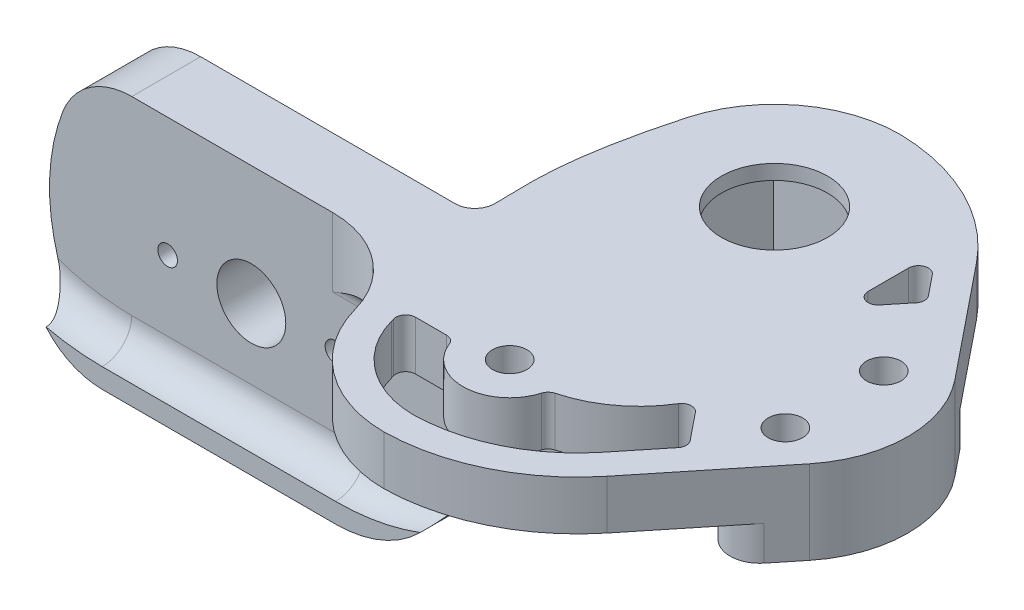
ISO-10303-21;
HEADER;
FILE_DESCRIPTION(('STEP AP214'),'2;1');
FILE_NAME('part.step','',(''),(''),'','','');
FILE_SCHEMA(('AUTOMOTIVE_DESIGN { 1 0 10303 214 1 1 1 1 }'));
ENDSEC;
DATA;
#1=APPLICATION_CONTEXT('core data for automotive mechanical design processes');
#2=APPLICATION_PROTOCOL_DEFINITION('international standard','automotive_design',2000,#1);
#3=PRODUCT_CONTEXT('',#1,'mechanical');
#4=PRODUCT('Part','Part','',(#3));
#5=PRODUCT_RELATED_PRODUCT_CATEGORY('part','',(#4));
#6=PRODUCT_DEFINITION_FORMATION('','',#4);
#7=PRODUCT_DEFINITION_CONTEXT('part definition',#1,'design');
#8=PRODUCT_DEFINITION('design','',#6,#7);
#9=PRODUCT_DEFINITION_SHAPE('','',#8);
#10=(LENGTH_UNIT() NAMED_UNIT(*) SI_UNIT(.MILLI.,.METRE.));
#11=(NAMED_UNIT(*) PLANE_ANGLE_UNIT() SI_UNIT($,.RADIAN.));
#12=(NAMED_UNIT(*) SI_UNIT($,.STERADIAN.) SOLID_ANGLE_UNIT());
#13=UNCERTAINTY_MEASURE_WITH_UNIT(LENGTH_MEASURE(1.E-05),#10,'distance_accuracy_value','');
#14=(GEOMETRIC_REPRESENTATION_CONTEXT(3) GLOBAL_UNCERTAINTY_ASSIGNED_CONTEXT((#13)) GLOBAL_UNIT_ASSIGNED_CONTEXT((#10,
#11,#12)) REPRESENTATION_CONTEXT('',''));
#15=CARTESIAN_POINT('',(0.,0.,0.));
#16=DIRECTION('',(0.,0.,1.));
#17=DIRECTION('',(1.,0.,0.));
#18=AXIS2_PLACEMENT_3D('',#15,#16,#17);
#19=CARTESIAN_POINT('',(0.,0.,7.));
#20=DIRECTION('',(0.,0.,-1.));
#21=DIRECTION('',(-1.,0.,0.));
#22=AXIS2_PLACEMENT_3D('',#19,#20,#21);
#23=CYLINDRICAL_SURFACE('',#22,3.5);
#24=CARTESIAN_POINT('',(0.,0.,7.));
#25=DIRECTION('',(0.,0.,1.));
#26=DIRECTION('',(1.,0.,0.));
#27=AXIS2_PLACEMENT_3D('',#24,#25,#26);
#28=CIRCLE('',#27,3.5);
#29=CARTESIAN_POINT('',(3.5,0.,7.));
#30=VERTEX_POINT('',#29);
#31=EDGE_CURVE('E937',#30,#30,#28,.T.);
#32=ORIENTED_EDGE('',*,*,#31,.T.);
#33=EDGE_LOOP('',(#32));
#34=FACE_BOUND('',#33,.T.);
#35=CARTESIAN_POINT('',(0.,0.,2.));
#36=DIRECTION('',(0.,0.,-1.));
#37=DIRECTION('',(-1.,0.,0.));
#38=AXIS2_PLACEMENT_3D('',#35,#36,#37);
#39=CIRCLE('',#38,3.5);
#40=CARTESIAN_POINT('',(-3.5,0.,2.));
#41=VERTEX_POINT('',#40);
#42=EDGE_CURVE('E521',#41,#41,#39,.T.);
#43=ORIENTED_EDGE('',*,*,#42,.T.);
#44=EDGE_LOOP('',(#43));
#45=FACE_BOUND('',#44,.T.);
#46=ADVANCED_FACE('F46',(#34,#45),#23,.F.);
#47=CARTESIAN_POINT('',(45.4012227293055,7.13472734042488,16.2670468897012));
#48=DIRECTION('',(0.,-1.,0.));
#49=DIRECTION('',(1.,0.,0.));
#50=AXIS2_PLACEMENT_3D('',#47,#48,#49);
#51=PLANE('',#50);
#52=CARTESIAN_POINT('',(50.2,7.13472734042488,5.54778790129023));
#53=DIRECTION('',(0.,1.,0.));
#54=DIRECTION('',(1.,0.,0.));
#55=AXIS2_PLACEMENT_3D('',#52,#53,#54);
#56=CIRCLE('',#55,5.);
#57=CARTESIAN_POINT('',(46.3097015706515,7.13472734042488,8.68873968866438));
#58=VERTEX_POINT('',#57);
#59=CARTESIAN_POINT('',(46.4545967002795,7.13472734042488,8.86018191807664));
#60=VERTEX_POINT('',#59);
#61=EDGE_CURVE('E461',#58,#60,#56,.T.);
#62=ORIENTED_EDGE('',*,*,#61,.F.);
#63=DIRECTION('',(0.628190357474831,0.,0.778059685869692));
#64=VECTOR('',#63,1.);
#65=CARTESIAN_POINT('',(46.3097015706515,7.13472734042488,8.68873968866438));
#66=LINE('',#65,#64);
#67=CARTESIAN_POINT('',(44.2663193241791,7.13472734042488,6.15786138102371));
#68=VERTEX_POINT('',#67);
#69=EDGE_CURVE('E472',#68,#58,#66,.T.);
#70=ORIENTED_EDGE('',*,*,#69,.F.);
#71=CARTESIAN_POINT('',(43.4882596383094,7.13472734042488,6.78605173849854));
#72=DIRECTION('',(0.,-1.,0.));
#73=DIRECTION('',(1.,0.,0.));
#74=AXIS2_PLACEMENT_3D('',#71,#72,#73);
#75=CIRCLE('',#74,1.);
#76=CARTESIAN_POINT('',(42.635316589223,7.13472734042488,6.26404775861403));
#77=VERTEX_POINT('',#76);
#78=EDGE_CURVE('E1334',#68,#77,#75,.F.);
#79=ORIENTED_EDGE('',*,*,#78,.T.);
#80=CARTESIAN_POINT('',(32.4000000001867,7.13472734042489,0.));
#81=DIRECTION('',(0.,1.,0.));
#82=DIRECTION('',(1.,0.,0.));
#83=AXIS2_PLACEMENT_3D('',#80,#81,#82);
#84=CIRCLE('',#83,12.);
#85=CARTESIAN_POINT('',(35.4620060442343,7.13472734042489,11.6027634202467));
#86=VERTEX_POINT('',#85);
#87=EDGE_CURVE('E493',#86,#77,#84,.T.);
#88=ORIENTED_EDGE('',*,*,#87,.F.);
#89=CARTESIAN_POINT('',(35.7171732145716,7.13472734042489,12.569660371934));
#90=DIRECTION('',(0.,-1.,0.));
#91=DIRECTION('',(1.,0.,0.));
#92=AXIS2_PLACEMENT_3D('',#89,#90,#91);
#93=CIRCLE('',#92,1.);
#94=CARTESIAN_POINT('',(34.7576648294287,7.13472734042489,12.2879803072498));
#95=VERTEX_POINT('',#94);
#96=EDGE_CURVE('E1346',#86,#95,#93,.F.);
#97=ORIENTED_EDGE('',*,*,#96,.T.);
#98=CARTESIAN_POINT('',(30.2,7.13472734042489,10.95));
#99=DIRECTION('',(0.,1.,0.));
#100=DIRECTION('',(1.,0.,0.));
#101=AXIS2_PLACEMENT_3D('',#98,#99,#100);
#102=CIRCLE('',#101,4.74999999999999);
#103=CARTESIAN_POINT('',(25.762136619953,7.13472734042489,12.6434782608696));
#104=VERTEX_POINT('',#103);
#105=EDGE_CURVE('E490',#104,#95,#102,.T.);
#106=ORIENTED_EDGE('',*,*,#105,.F.);
#107=CARTESIAN_POINT('',(24.8278495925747,7.13472734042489,13.));
#108=DIRECTION('',(0.,-1.,0.));
#109=DIRECTION('',(1.,0.,0.));
#110=AXIS2_PLACEMENT_3D('',#107,#108,#109);
#111=CIRCLE('',#110,1.);
#112=CARTESIAN_POINT('',(24.8278495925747,7.13472734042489,12.));
#113=VERTEX_POINT('',#112);
#114=EDGE_CURVE('E1342',#104,#113,#111,.F.);
#115=ORIENTED_EDGE('',*,*,#114,.T.);
#116=DIRECTION('',(1.,0.,0.));
#117=VECTOR('',#116,1.);
#118=CARTESIAN_POINT('',(25.5675060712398,7.13472734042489,12.));
#119=LINE('',#118,#117);
#120=CARTESIAN_POINT('',(21.6856076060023,7.13472734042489,12.));
#121=VERTEX_POINT('',#120);
#122=EDGE_CURVE('E487',#121,#113,#119,.T.);
#123=ORIENTED_EDGE('',*,*,#122,.F.);
#124=CARTESIAN_POINT('',(21.6856076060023,7.13472734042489,13.));
#125=DIRECTION('',(0.,-1.,0.));
#126=DIRECTION('',(1.,0.,0.));
#127=AXIS2_PLACEMENT_3D('',#124,#125,#126);
#128=CIRCLE('',#127,1.);
#129=CARTESIAN_POINT('',(20.7272927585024,7.13472734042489,13.2857142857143));
#130=VERTEX_POINT('',#129);
#131=EDGE_CURVE('E1338',#121,#130,#128,.F.);
#132=ORIENTED_EDGE('',*,*,#131,.T.);
#133=CARTESIAN_POINT('',(8.26919974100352,7.13472734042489,17.));
#134=DIRECTION('',(0.,1.,0.));
#135=DIRECTION('',(1.,0.,0.));
#136=AXIS2_PLACEMENT_3D('',#133,#134,#135);
#137=CIRCLE('',#136,13.);
#138=CARTESIAN_POINT('',(20.8010856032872,7.13472734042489,13.5428571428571));
#139=VERTEX_POINT('',#138);
#140=EDGE_CURVE('E481',#139,#130,#137,.T.);
#141=ORIENTED_EDGE('',*,*,#140,.F.);
#142=CARTESIAN_POINT('',(30.2,7.13472734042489,10.95));
#143=DIRECTION('',(0.,-1.,0.));
#144=DIRECTION('',(1.,0.,0.));
#145=AXIS2_PLACEMENT_3D('',#142,#143,#144);
#146=CIRCLE('',#145,9.75000000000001);
#147=CARTESIAN_POINT('',(30.1737133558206,7.13472734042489,20.6999645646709));
#148=VERTEX_POINT('',#147);
#149=EDGE_CURVE('E479',#148,#139,#146,.T.);
#150=ORIENTED_EDGE('',*,*,#149,.F.);
#151=CARTESIAN_POINT('',(29.8400290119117,7.13472734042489,3.70323974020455));
#152=DIRECTION('',(0.,-1.,0.));
#153=DIRECTION('',(1.,0.,0.));
#154=AXIS2_PLACEMENT_3D('',#151,#152,#153);
#155=CIRCLE('',#154,17.);
#156=CARTESIAN_POINT('',(43.0670436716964,7.13472734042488,14.3824758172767));
#157=VERTEX_POINT('',#156);
#158=EDGE_CURVE('E460',#157,#148,#155,.T.);
#159=ORIENTED_EDGE('',*,*,#158,.F.);
#160=DIRECTION('',(-0.628190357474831,0.,0.778059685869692));
#161=VECTOR('',#160,1.);
#162=CARTESIAN_POINT('',(43.0670436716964,7.13472734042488,14.3824758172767));
#163=LINE('',#162,#161);
#164=CARTESIAN_POINT('',(46.483575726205,7.13472734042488,10.1508510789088));
#165=VERTEX_POINT('',#164);
#166=EDGE_CURVE('E450',#165,#157,#163,.T.);
#167=ORIENTED_EDGE('',*,*,#166,.F.);
#168=CARTESIAN_POINT('',(45.7055160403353,7.13472734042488,9.52266072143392));
#169=DIRECTION('',(0.,-1.,0.));
#170=DIRECTION('',(1.,0.,0.));
#171=AXIS2_PLACEMENT_3D('',#168,#169,#170);
#172=CIRCLE('',#171,1.);
#173=EDGE_CURVE('E1330',#165,#60,#172,.F.);
#174=ORIENTED_EDGE('',*,*,#173,.T.);
#175=EDGE_LOOP('',(#62,#70,#79,#88,#97,#106,#115,#123,#132,#141,#150,#159,#167,#174));
#176=FACE_BOUND('',#175,.T.);
#177=CARTESIAN_POINT('',(50.2,7.13472734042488,-10.5477879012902));
#178=DIRECTION('',(0.,1.,0.));
#179=DIRECTION('',(1.,0.,0.));
#180=AXIS2_PLACEMENT_3D('',#177,#178,#179);
#181=CIRCLE('',#180,6.);
#182=CARTESIAN_POINT('',(45.8026084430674,7.13472734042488,-14.6298152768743));
#183=VERTEX_POINT('',#182);
#184=CARTESIAN_POINT('',(45.5316418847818,7.13472734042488,-14.3169300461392));
#185=VERTEX_POINT('',#184);
#186=EDGE_CURVE('E516',#183,#185,#181,.T.);
#187=ORIENTED_EDGE('',*,*,#186,.F.);
#188=CARTESIAN_POINT('',(45.0697098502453,7.13472734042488,-15.3101531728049));
#189=DIRECTION('',(0.,-1.,0.));
#190=DIRECTION('',(1.,0.,0.));
#191=AXIS2_PLACEMENT_3D('',#188,#189,#190);
#192=CIRCLE('',#191,1.);
#193=CARTESIAN_POINT('',(45.8477695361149,7.13472734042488,-15.9383435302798));
#194=VERTEX_POINT('',#193);
#195=EDGE_CURVE('E54',#183,#194,#192,.F.);
#196=ORIENTED_EDGE('',*,*,#195,.T.);
#197=DIRECTION('',(0.628190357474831,0.,0.778059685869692));
#198=VECTOR('',#197,1.);
#199=CARTESIAN_POINT('',(46.430857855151,7.13472734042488,-15.2161460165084));
#200=LINE('',#199,#198);
#201=CARTESIAN_POINT('',(44.1780596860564,7.13472734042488,-18.0064012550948));
#202=VERTEX_POINT('',#201);
#203=EDGE_CURVE('E507',#202,#194,#200,.T.);
#204=ORIENTED_EDGE('',*,*,#203,.F.);
#205=CARTESIAN_POINT('',(43.4000000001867,7.13472734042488,-17.3782108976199));
#206=DIRECTION('',(0.,-1.,0.));
#207=DIRECTION('',(1.,0.,0.));
#208=AXIS2_PLACEMENT_3D('',#205,#206,#207);
#209=CIRCLE('',#208,1.);
#210=CARTESIAN_POINT('',(42.4000000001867,7.13472734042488,-17.3782108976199));
#211=VERTEX_POINT('',#210);
#212=EDGE_CURVE('E1320',#202,#211,#209,.F.);
#213=ORIENTED_EDGE('',*,*,#212,.T.);
#214=DIRECTION('',(0.,0.,-1.));
#215=VECTOR('',#214,1.);
#216=CARTESIAN_POINT('',(42.4000000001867,7.13472734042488,-10.2515349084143));
#217=LINE('',#216,#215);
#218=CARTESIAN_POINT('',(42.4000000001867,7.13472734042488,-13.2686098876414));
#219=VERTEX_POINT('',#218);
#220=EDGE_CURVE('E510',#219,#211,#217,.T.);
#221=ORIENTED_EDGE('',*,*,#220,.F.);
#222=CARTESIAN_POINT('',(43.4000000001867,7.13472734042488,-13.2686098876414));
#223=DIRECTION('',(0.,-1.,0.));
#224=DIRECTION('',(1.,0.,0.));
#225=AXIS2_PLACEMENT_3D('',#222,#223,#224);
#226=CIRCLE('',#225,1.);
#227=CARTESIAN_POINT('',(44.1780596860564,7.13472734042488,-12.6404195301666));
#228=VERTEX_POINT('',#227);
#229=EDGE_CURVE('E1326',#219,#228,#226,.F.);
#230=ORIENTED_EDGE('',*,*,#229,.T.);
#231=DIRECTION('',(-0.628190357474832,0.,0.778059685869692));
#232=VECTOR('',#231,1.);
#233=CARTESIAN_POINT('',(43.4749458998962,7.13472734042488,-11.7695617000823));
#234=LINE('',#233,#232);
#235=EDGE_CURVE('E513',#185,#228,#234,.T.);
#236=ORIENTED_EDGE('',*,*,#235,.F.);
#237=EDGE_LOOP('',(#187,#196,#204,#213,#221,#230,#236));
#238=FACE_BOUND('',#237,.T.);
#239=CARTESIAN_POINT('',(30.2,7.13472734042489,10.95));
#240=DIRECTION('',(0.,-1.,0.));
#241=DIRECTION('',(1.,0.,0.));
#242=AXIS2_PLACEMENT_3D('',#239,#240,#241);
#243=CIRCLE('',#242,1.74999999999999);
#244=CARTESIAN_POINT('',(31.95,7.13472734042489,10.95));
#245=VERTEX_POINT('',#244);
#246=EDGE_CURVE('E978',#245,#245,#243,.T.);
#247=ORIENTED_EDGE('',*,*,#246,.F.);
#248=EDGE_LOOP('',(#247));
#249=FACE_BOUND('',#248,.T.);
#250=DIRECTION('',(-0.628190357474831,0.,-0.778059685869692));
#251=VECTOR('',#250,1.);
#252=CARTESIAN_POINT('',(54.5908750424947,7.13472734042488,-9.88499062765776));
#253=LINE('',#252,#251);
#254=CARTESIAN_POINT('',(52.5341790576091,7.13472734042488,-12.4323589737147));
#255=VERTEX_POINT('',#254);
#256=CARTESIAN_POINT('',(45.4012227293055,7.13472734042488,-21.2670468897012));
#257=VERTEX_POINT('',#256);
#258=EDGE_CURVE('E1017',#255,#257,#253,.T.);
#259=ORIENTED_EDGE('',*,*,#258,.F.);
#260=CARTESIAN_POINT('',(50.2,7.13472734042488,-10.5477879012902));
#261=DIRECTION('',(0.,-1.,0.));
#262=DIRECTION('',(1.,0.,0.));
#263=AXIS2_PLACEMENT_3D('',#260,#261,#262);
#264=CIRCLE('',#263,3.);
#265=CARTESIAN_POINT('',(47.8658209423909,7.13472734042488,-12.4323589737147));
#266=VERTEX_POINT('',#265);
#267=EDGE_CURVE('E589',#255,#266,#264,.F.);
#268=ORIENTED_EDGE('',*,*,#267,.T.);
#269=DIRECTION('',(0.628190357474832,0.,-0.778059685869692));
#270=VECTOR('',#269,1.);
#271=CARTESIAN_POINT('',(45.8091249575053,7.13472734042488,-9.88499062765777));
#272=LINE('',#271,#270);
#273=CARTESIAN_POINT('',(45.8091249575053,7.13472734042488,-9.88499062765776));
#274=VERTEX_POINT('',#273);
#275=EDGE_CURVE('E560',#274,#266,#272,.T.);
#276=ORIENTED_EDGE('',*,*,#275,.F.);
#277=CARTESIAN_POINT('',(54.9559757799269,7.13472734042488,-2.5));
#278=DIRECTION('',(0.,-1.,0.));
#279=DIRECTION('',(-1.,0.,0.));
#280=AXIS2_PLACEMENT_3D('',#277,#278,#279);
#281=CIRCLE('',#280,11.7559757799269);
#282=CARTESIAN_POINT('',(45.8091249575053,7.13472734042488,4.88499062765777));
#283=VERTEX_POINT('',#282);
#284=EDGE_CURVE('E575',#283,#274,#281,.T.);
#285=ORIENTED_EDGE('',*,*,#284,.F.);
#286=DIRECTION('',(-0.62819035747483,0.,-0.778059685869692));
#287=VECTOR('',#286,1.);
#288=CARTESIAN_POINT('',(50.2,7.13472734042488,10.3234103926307));
#289=LINE('',#288,#287);
#290=CARTESIAN_POINT('',(47.8658209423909,7.13472734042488,7.43235897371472));
#291=VERTEX_POINT('',#290);
#292=EDGE_CURVE('E555',#291,#283,#289,.T.);
#293=ORIENTED_EDGE('',*,*,#292,.F.);
#294=CARTESIAN_POINT('',(50.2,7.13472734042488,5.54778790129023));
#295=DIRECTION('',(0.,-1.,0.));
#296=DIRECTION('',(1.,0.,0.));
#297=AXIS2_PLACEMENT_3D('',#294,#295,#296);
#298=CIRCLE('',#297,3.);
#299=CARTESIAN_POINT('',(52.5341790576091,7.13472734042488,7.43235897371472));
#300=VERTEX_POINT('',#299);
#301=EDGE_CURVE('E586',#291,#300,#298,.F.);
#302=ORIENTED_EDGE('',*,*,#301,.T.);
#303=DIRECTION('',(0.628190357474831,0.,-0.778059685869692));
#304=VECTOR('',#303,1.);
#305=CARTESIAN_POINT('',(39.4000000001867,7.13472734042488,23.7));
#306=LINE('',#305,#304);
#307=CARTESIAN_POINT('',(45.4012227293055,7.13472734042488,16.2670468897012));
#308=VERTEX_POINT('',#307);
#309=EDGE_CURVE('E1014',#308,#300,#306,.T.);
#310=ORIENTED_EDGE('',*,*,#309,.F.);
#311=CARTESIAN_POINT('',(29.8400290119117,7.13472734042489,3.70323974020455));
#312=DIRECTION('',(0.,-1.,0.));
#313=DIRECTION('',(1.,0.,0.));
#314=AXIS2_PLACEMENT_3D('',#311,#312,#313);
#315=CIRCLE('',#314,20.);
#316=CARTESIAN_POINT('',(30.2,7.13472734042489,23.7));
#317=VERTEX_POINT('',#316);
#318=EDGE_CURVE('E958',#308,#317,#315,.T.);
#319=ORIENTED_EDGE('',*,*,#318,.T.);
#320=CARTESIAN_POINT('',(30.2,7.13472734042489,10.95));
#321=DIRECTION('',(0.,-1.,0.));
#322=DIRECTION('',(1.,0.,0.));
#323=AXIS2_PLACEMENT_3D('',#320,#321,#322);
#324=CIRCLE('',#323,12.75);
#325=CARTESIAN_POINT('',(17.9091119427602,7.13472734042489,14.3406593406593));
#326=VERTEX_POINT('',#325);
#327=EDGE_CURVE('E974',#326,#317,#324,.F.);
#328=ORIENTED_EDGE('',*,*,#327,.F.);
#329=CARTESIAN_POINT('',(8.26919974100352,7.13472734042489,17.));
#330=DIRECTION('',(0.,-1.,0.));
#331=DIRECTION('',(1.,0.,0.));
#332=AXIS2_PLACEMENT_3D('',#329,#330,#331);
#333=CIRCLE('',#332,10.);
#334=CARTESIAN_POINT('',(14.2691997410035,7.13472734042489,9.));
#335=VERTEX_POINT('',#334);
#336=EDGE_CURVE('E964',#326,#335,#333,.F.);
#337=ORIENTED_EDGE('',*,*,#336,.T.);
#338=DIRECTION('',(-1.,0.,0.));
#339=VECTOR('',#338,1.);
#340=CARTESIAN_POINT('',(32.4000000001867,7.13472734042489,9.));
#341=LINE('',#340,#339);
#342=CARTESIAN_POINT('',(32.4000000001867,7.13472734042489,9.));
#343=VERTEX_POINT('',#342);
#344=EDGE_CURVE('E1050',#335,#343,#341,.F.);
#345=ORIENTED_EDGE('',*,*,#344,.T.);
#346=CARTESIAN_POINT('',(32.4000000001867,7.13472734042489,0.));
#347=DIRECTION('',(0.,-1.,0.));
#348=DIRECTION('',(1.,0.,0.));
#349=AXIS2_PLACEMENT_3D('',#346,#347,#348);
#350=CIRCLE('',#349,9.);
#351=CARTESIAN_POINT('',(41.4000000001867,7.13472734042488,0.));
#352=VERTEX_POINT('',#351);
#353=EDGE_CURVE('E1043',#343,#352,#350,.F.);
#354=ORIENTED_EDGE('',*,*,#353,.T.);
#355=DIRECTION('',(0.,0.,1.));
#356=VECTOR('',#355,1.);
#357=CARTESIAN_POINT('',(41.4000000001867,7.13472734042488,16.2670468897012));
#358=LINE('',#357,#356);
#359=CARTESIAN_POINT('',(41.4000000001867,7.13472734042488,-21.7));
#360=VERTEX_POINT('',#359);
#361=EDGE_CURVE('E1045',#352,#360,#358,.F.);
#362=ORIENTED_EDGE('',*,*,#361,.T.);
#363=CARTESIAN_POINT('',(32.4000000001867,7.13472734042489,-21.7));
#364=DIRECTION('',(0.,-1.,0.));
#365=DIRECTION('',(1.,0.,0.));
#366=AXIS2_PLACEMENT_3D('',#363,#364,#365);
#367=CIRCLE('',#366,9.);
#368=CARTESIAN_POINT('',(40.4982187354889,7.13472734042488,-25.6266847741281));
#369=VERTEX_POINT('',#368);
#370=EDGE_CURVE('E1047',#360,#369,#367,.F.);
#371=ORIENTED_EDGE('',*,*,#370,.T.);
#372=CARTESIAN_POINT('',(29.8400290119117,7.13472734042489,-8.70323974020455));
#373=DIRECTION('',(0.,-1.,0.));
#374=DIRECTION('',(1.,0.,0.));
#375=AXIS2_PLACEMENT_3D('',#372,#373,#374);
#376=CIRCLE('',#375,20.);
#377=EDGE_CURVE('E876',#369,#257,#376,.T.);
#378=ORIENTED_EDGE('',*,*,#377,.T.);
#379=EDGE_LOOP('',(#259,#268,#276,#285,#293,#302,#310,#319,#328,#337,#345,#354,#362,#371,#378));
#380=FACE_BOUND('',#379,.T.);
#381=ADVANCED_FACE('F475',(#176,#238,#249,#380),#51,.T.);
#382=CARTESIAN_POINT('',(4.31549034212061,0.,-23.));
#383=DIRECTION('',(0.,0.,1.));
#384=DIRECTION('',(1.,0.,0.));
#385=AXIS2_PLACEMENT_3D('',#382,#383,#384);
#386=CYLINDRICAL_SURFACE('',#385,15.3845096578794);
#387=CARTESIAN_POINT('',(15.7158629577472,-10.3302779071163,-2.02592196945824));
#388=CARTESIAN_POINT('',(15.7159189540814,-10.3302161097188,-2.02160204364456));
#389=CARTESIAN_POINT('',(15.7159609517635,-10.3301697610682,-2.0172819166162));
#390=CARTESIAN_POINT('',(15.7160169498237,-10.3301079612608,-2.00864126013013));
#391=CARTESIAN_POINT('',(15.7160309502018,-10.330092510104,-2.0043207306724));
#392=CARTESIAN_POINT('',(15.7160309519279,-10.3300925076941,-2.));
#393=B_SPLINE_CURVE_WITH_KNOTS('',3,(#387,#388,#389,#390,#391,#392),.UNSPECIFIED.,.F.,.F.,(4,2,
4),(0.,0.0129617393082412,0.0259234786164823),.UNSPECIFIED.);
#394=CARTESIAN_POINT('',(15.7158629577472,-10.3302779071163,-2.02592196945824));
#395=VERTEX_POINT('',#394);
#396=CARTESIAN_POINT('',(15.7160309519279,-10.3300925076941,-2.));
#397=VERTEX_POINT('',#396);
#398=EDGE_CURVE('E653',#395,#397,#393,.T.);
#399=ORIENTED_EDGE('',*,*,#398,.T.);
#400=CARTESIAN_POINT('',(4.31549034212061,0.,-2.));
#401=DIRECTION('',(0.,0.,1.));
#402=DIRECTION('',(1.,0.,0.));
#403=AXIS2_PLACEMENT_3D('',#400,#401,#402);
#404=CIRCLE('',#403,15.3845096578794);
#405=CARTESIAN_POINT('',(15.7160309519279,10.3300925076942,-2.));
#406=VERTEX_POINT('',#405);
#407=EDGE_CURVE('E651',#397,#406,#404,.T.);
#408=ORIENTED_EDGE('',*,*,#407,.T.);
#409=CARTESIAN_POINT('',(15.7160309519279,10.3300925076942,-2.));
#410=CARTESIAN_POINT('',(15.7160309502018,10.330092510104,-2.0043207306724));
#411=CARTESIAN_POINT('',(15.7160169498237,10.3301079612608,-2.00864126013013));
#412=CARTESIAN_POINT('',(15.7159609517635,10.3301697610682,-2.0172819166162));
#413=CARTESIAN_POINT('',(15.7159189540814,10.3302161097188,-2.02160204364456));
#414=CARTESIAN_POINT('',(15.7158629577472,10.3302779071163,-2.02592196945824));
#415=B_SPLINE_CURVE_WITH_KNOTS('',3,(#409,#410,#411,#412,#413,#414),.UNSPECIFIED.,.F.,.F.,(4,2,
4),(0.,0.0129617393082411,0.0259234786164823),.UNSPECIFIED.);
#416=CARTESIAN_POINT('',(15.7158629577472,10.3302779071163,-2.02592196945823));
#417=VERTEX_POINT('',#416);
#418=EDGE_CURVE('E1139',#406,#417,#415,.T.);
#419=ORIENTED_EDGE('',*,*,#418,.T.);
#420=CARTESIAN_POINT('',(17.9091119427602,7.20392873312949,-19.3406593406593));
#421=CARTESIAN_POINT('',(17.8705833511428,7.27662789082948,-19.2009961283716));
#422=CARTESIAN_POINT('',(17.8321578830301,7.34772972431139,-19.0604820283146));
#423=CARTESIAN_POINT('',(17.7555889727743,7.48686859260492,-18.777876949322));
#424=CARTESIAN_POINT('',(17.7174455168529,7.55490577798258,-18.6357860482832));
#425=CARTESIAN_POINT('',(17.6036062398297,7.75452023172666,-18.2075407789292));
#426=CARTESIAN_POINT('',(17.5284402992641,7.88171502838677,-17.9191924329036));
#427=CARTESIAN_POINT('',(17.3800975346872,8.12523783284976,-17.3375340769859));
#428=CARTESIAN_POINT('',(17.3069203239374,8.24156796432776,-17.0442250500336));
#429=CARTESIAN_POINT('',(17.1630443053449,8.46410347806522,-16.4531807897));
#430=CARTESIAN_POINT('',(17.0923456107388,8.57030839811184,-16.1554453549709));
#431=CARTESIAN_POINT('',(16.9534413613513,8.77385983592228,-15.5539540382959));
#432=CARTESIAN_POINT('',(16.8852567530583,8.87113905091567,-15.2501705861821));
#433=CARTESIAN_POINT('',(16.7524057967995,9.05644895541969,-14.6389920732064));
#434=CARTESIAN_POINT('',(16.6877399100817,9.14447843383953,-14.3315965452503));
#435=CARTESIAN_POINT('',(16.5624607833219,9.31159254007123,-13.7135704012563));
#436=CARTESIAN_POINT('',(16.5018475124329,9.39067723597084,-13.4029398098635));
#437=CARTESIAN_POINT('',(16.385237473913,9.54009014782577,-12.7787755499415));
#438=CARTESIAN_POINT('',(16.3292398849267,9.61041992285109,-12.465242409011));
#439=CARTESIAN_POINT('',(16.2394572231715,9.72139366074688,-11.9357580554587));
#440=CARTESIAN_POINT('',(16.2042771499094,9.76435908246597,-11.7205261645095));
#441=CARTESIAN_POINT('',(16.1365497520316,9.846243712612,-11.2889225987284));
#442=CARTESIAN_POINT('',(16.1040019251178,9.88516369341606,-11.072551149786));
#443=CARTESIAN_POINT('',(16.0417564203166,9.95892311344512,-10.638722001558));
#444=CARTESIAN_POINT('',(16.0120585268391,9.9937628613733,-10.4212643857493));
#445=CARTESIAN_POINT('',(15.955840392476,10.0591869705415,-9.98601693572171));
#446=CARTESIAN_POINT('',(15.9293103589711,10.0897844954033,-9.76823035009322));
#447=CARTESIAN_POINT('',(15.8795766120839,10.1467470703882,-9.33170398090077));
#448=CARTESIAN_POINT('',(15.8563731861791,10.1731117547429,-9.11296411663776));
#449=CARTESIAN_POINT('',(15.8135763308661,10.2214577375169,-8.67461014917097));
#450=CARTESIAN_POINT('',(15.793983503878,10.2434383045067,-8.45499590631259));
#451=CARTESIAN_POINT('',(15.7576988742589,10.2839576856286,-8.00224483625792));
#452=CARTESIAN_POINT('',(15.741241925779,10.3022221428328,-7.76906406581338));
#453=CARTESIAN_POINT('',(15.7201612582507,10.3255375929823,-7.41882592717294));
#454=CARTESIAN_POINT('',(15.7137353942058,10.3326289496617,-7.3020079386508));
#455=CARTESIAN_POINT('',(15.7021397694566,10.3454060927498,-7.06822969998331));
#456=CARTESIAN_POINT('',(15.6969700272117,10.3510918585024,-6.95126944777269));
#457=CARTESIAN_POINT('',(15.6879462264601,10.3610052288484,-6.71728187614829));
#458=CARTESIAN_POINT('',(15.6840916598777,10.3652333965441,-6.60025460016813));
#459=CARTESIAN_POINT('',(15.6777558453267,10.3721782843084,-6.36612043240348));
#460=CARTESIAN_POINT('',(15.6752745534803,10.374895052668,-6.24901354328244));
#461=CARTESIAN_POINT('',(15.6726282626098,10.377791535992,-6.07315542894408));
#462=CARTESIAN_POINT('',(15.6719252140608,10.378560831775,-6.01442109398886));
#463=CARTESIAN_POINT('',(15.6708878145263,10.3796958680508,-5.89694529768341));
#464=CARTESIAN_POINT('',(15.6705534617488,10.3800616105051,-5.83820383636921));
#465=CARTESIAN_POINT('',(15.6702659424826,10.3803761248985,-5.72071743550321));
#466=CARTESIAN_POINT('',(15.6703127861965,10.3803248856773,-5.66197249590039));
#467=CARTESIAN_POINT('',(15.6707811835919,10.3798124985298,-5.54448541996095));
#468=CARTESIAN_POINT('',(15.67120273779,10.3793513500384,-5.48574328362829));
#469=CARTESIAN_POINT('',(15.6721652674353,10.3782981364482,-5.39762939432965));
#470=CARTESIAN_POINT('',(15.6725412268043,10.3778867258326,-5.3682534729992));
#471=CARTESIAN_POINT('',(15.6732991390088,10.3770572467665,-5.30950179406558));
#472=CARTESIAN_POINT('',(15.6736810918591,10.3766391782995,-5.28012603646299));
#473=CARTESIAN_POINT('',(15.6748253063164,10.3753866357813,-5.1919986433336));
#474=CARTESIAN_POINT('',(15.6755859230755,10.3745538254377,-5.13324694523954));
#475=CARTESIAN_POINT('',(15.6771083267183,10.3728865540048,-5.01574384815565));
#476=CARTESIAN_POINT('',(15.677870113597,10.3720520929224,-4.9569924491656));
#477=CARTESIAN_POINT('',(15.6793933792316,10.3703831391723,-4.83948969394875));
#478=CARTESIAN_POINT('',(15.6801548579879,10.3695486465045,-4.78073833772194));
#479=CARTESIAN_POINT('',(15.6824395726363,10.3670443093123,-4.60446930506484));
#480=CARTESIAN_POINT('',(15.6839628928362,10.3653738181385,-4.486951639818));
#481=CARTESIAN_POINT('',(15.6870094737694,10.3620314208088,-4.25191624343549));
#482=CARTESIAN_POINT('',(15.6885327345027,10.360359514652,-4.13439851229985));
#483=CARTESIAN_POINT('',(15.6915878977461,10.3570047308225,-3.8986975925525));
#484=CARTESIAN_POINT('',(15.6931198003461,10.355321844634,-3.78051440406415));
#485=CARTESIAN_POINT('',(15.6961836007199,10.3519545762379,-3.54414807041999));
#486=CARTESIAN_POINT('',(15.6977154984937,10.3502701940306,-3.42596492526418));
#487=CARTESIAN_POINT('',(15.7023106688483,10.3452153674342,-3.07145592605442));
#488=CARTESIAN_POINT('',(15.7053739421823,10.3418426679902,-2.8351301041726));
#489=CARTESIAN_POINT('',(15.7115002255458,10.3350915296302,-2.36249870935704));
#490=CARTESIAN_POINT('',(15.7145632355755,10.3317130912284,-2.12619313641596));
#491=CARTESIAN_POINT('',(15.7206740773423,10.3249669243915,-1.65475298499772));
#492=CARTESIAN_POINT('',(15.7237219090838,10.3215992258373,-1.41961840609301));
#493=CARTESIAN_POINT('',(15.7298178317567,10.3148575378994,-0.949329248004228));
#494=CARTESIAN_POINT('',(15.732865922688,10.3114835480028,-0.714174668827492));
#495=CARTESIAN_POINT('',(15.73896262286,10.304728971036,-0.243825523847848));
#496=CARTESIAN_POINT('',(15.7420112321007,10.3013483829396,-0.00863095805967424));
#497=CARTESIAN_POINT('',(15.7450598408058,10.297964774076,0.226563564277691));
#498=B_SPLINE_CURVE_WITH_KNOTS('',3,(#420,#421,#422,#423,#424,#425,#426,#427,#428,#429,#430,
#431,#432,#433,#434,#435,#436,#437,#438,#439,#440,#441,#442,#443,#444,#445,#446,#447,#448,#449,
#450,#451,#452,#453,#454,#455,#456,#457,#458,#459,#460,#461,#462,#463,#464,#465,#466,#467,#468,
#469,#470,#471,#472,#473,#474,#475,#476,#477,#478,#479,#480,#481,#482,#483,#484,#485,#486,#487,
#488,#489,#490,#491,#492,#493,#494,#495,#496,#497),.UNSPECIFIED.,.F.,.F.,(4,2,2,2,2,2,2,2,2,2,2,
2,2,2,2,2,2,2,2,2,2,2,2,2,2,2,2,2,2,2,2,2,2,2,2,2,2,2,4),(0.,0.486267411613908,
0.972510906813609,1.94422831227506,2.915755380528,3.88732677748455,4.86570761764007,
5.84421640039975,6.82271773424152,7.80104456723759,8.46783505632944,9.1344980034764,
9.80111047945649,10.4656058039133,11.1301585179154,11.7948220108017,12.4981238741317,
12.8497394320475,13.2013601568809,13.5528448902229,13.9043183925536,14.0805470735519,
14.2567748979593,14.4330074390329,14.6092402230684,14.6973836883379,14.7855273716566,
14.9618149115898,15.1381017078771,15.3143883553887,15.6670065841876,16.0196250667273,
16.3742403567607,16.7288555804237,17.4379647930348,18.1470135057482,18.8525488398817,
19.5581444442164,20.2638602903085),.UNSPECIFIED.);
#499=CARTESIAN_POINT('',(17.9091119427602,7.20392873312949,-19.3406593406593));
#500=VERTEX_POINT('',#499);
#501=EDGE_CURVE('E1104',#500,#417,#498,.T.);
#502=ORIENTED_EDGE('',*,*,#501,.F.);
#503=CARTESIAN_POINT('',(17.45,-8.01048022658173,-15.95));
#504=CARTESIAN_POINT('',(17.4499983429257,-8.01048089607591,-16.1463596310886));
#505=CARTESIAN_POINT('',(17.4545445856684,-8.00304230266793,-16.3426970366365));
#506=CARTESIAN_POINT('',(17.4726145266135,-7.97330113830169,-16.733898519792));
#507=CARTESIAN_POINT('',(17.4861409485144,-7.95099405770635,-16.9287621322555));
#508=CARTESIAN_POINT('',(17.521856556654,-7.89152888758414,-17.3156374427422));
#509=CARTESIAN_POINT('',(17.544055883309,-7.85435341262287,-17.5076455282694));
#510=CARTESIAN_POINT('',(17.596549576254,-7.76526066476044,-17.8870629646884));
#511=CARTESIAN_POINT('',(17.6268432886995,-7.71334458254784,-18.0744726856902));
#512=CARTESIAN_POINT('',(17.6947139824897,-7.59500840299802,-18.4430710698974));
#513=CARTESIAN_POINT('',(17.7322832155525,-7.52860372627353,-18.6242661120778));
#514=CARTESIAN_POINT('',(17.8137548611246,-7.38153494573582,-18.9792921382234));
#515=CARTESIAN_POINT('',(17.85765739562,-7.30087056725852,-19.1531229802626));
#516=CARTESIAN_POINT('',(17.9506341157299,-7.12571343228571,-19.492088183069));
#517=CARTESIAN_POINT('',(17.9997049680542,-7.03122957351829,-19.6572280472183));
#518=CARTESIAN_POINT('',(18.1017688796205,-6.82894917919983,-19.9778625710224));
#519=CARTESIAN_POINT('',(18.1547633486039,-6.72114784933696,-20.1333537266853));
#520=CARTESIAN_POINT('',(18.3143203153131,-6.38558017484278,-20.5747913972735));
#521=CARTESIAN_POINT('',(18.4245252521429,-6.14009464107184,-20.8463761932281));
#522=CARTESIAN_POINT('',(18.5893804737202,-5.74108706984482,-21.2201751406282));
#523=CARTESIAN_POINT('',(18.6442849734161,-5.60287564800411,-21.3392309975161));
#524=CARTESIAN_POINT('',(18.7528074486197,-5.31698539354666,-21.5660515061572));
#525=CARTESIAN_POINT('',(18.8064256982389,-5.16930860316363,-21.673818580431));
#526=CARTESIAN_POINT('',(18.91445137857,-4.85618762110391,-21.8841158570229));
#527=CARTESIAN_POINT('',(18.9687076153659,-4.69020911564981,-21.9859261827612));
#528=CARTESIAN_POINT('',(19.0733255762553,-4.34984287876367,-22.1766722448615));
#529=CARTESIAN_POINT('',(19.1236871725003,-4.17545487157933,-22.2656075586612));
#530=CARTESIAN_POINT('',(19.219497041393,-3.8193879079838,-22.4307543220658));
#531=CARTESIAN_POINT('',(19.2649436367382,-3.63770649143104,-22.5069614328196));
#532=CARTESIAN_POINT('',(19.3500366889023,-3.26825579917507,-22.6468273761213));
#533=CARTESIAN_POINT('',(19.3896827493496,-3.08048610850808,-22.7104853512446));
#534=CARTESIAN_POINT('',(19.4660341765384,-2.68130420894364,-22.8311389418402));
#535=CARTESIAN_POINT('',(19.5020691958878,-2.46938009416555,-22.8868677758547));
#536=CARTESIAN_POINT('',(19.5655546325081,-2.04097507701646,-22.9838060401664));
#537=CARTESIAN_POINT('',(19.5930045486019,-1.82449390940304,-23.0250146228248));
#538=CARTESIAN_POINT('',(19.6388050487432,-1.38826495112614,-23.0932030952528));
#539=CARTESIAN_POINT('',(19.6571519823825,-1.16851588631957,-23.1201772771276));
#540=CARTESIAN_POINT('',(19.6843960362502,-0.727164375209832,-23.1600730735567));
#541=CARTESIAN_POINT('',(19.6932928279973,-0.505561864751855,-23.1729941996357));
#542=CARTESIAN_POINT('',(19.7018167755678,-0.0433103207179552,-23.1853799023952));
#543=CARTESIAN_POINT('',(19.7006101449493,0.19738779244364,-23.18363404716));
#544=CARTESIAN_POINT('',(19.6869405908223,0.677796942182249,-23.1637524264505));
#545=CARTESIAN_POINT('',(19.6744769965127,0.917507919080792,-23.1456156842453));
#546=CARTESIAN_POINT('',(19.6385492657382,1.39433740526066,-23.0927781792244));
#547=CARTESIAN_POINT('',(19.6150822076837,1.63145520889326,-23.0580730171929));
#548=CARTESIAN_POINT('',(19.5576560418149,2.10131781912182,-22.9718016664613));
#549=CARTESIAN_POINT('',(19.5236970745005,2.33406268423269,-22.9202357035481));
#550=CARTESIAN_POINT('',(19.4456470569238,2.79587485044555,-22.7992067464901));
#551=CARTESIAN_POINT('',(19.4014510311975,3.02487573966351,-22.729557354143));
#552=CARTESIAN_POINT('',(19.3042422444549,3.47467902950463,-22.5721983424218));
#553=CARTESIAN_POINT('',(19.2512292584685,3.69548122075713,-22.4844882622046));
#554=CARTESIAN_POINT('',(19.1378577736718,4.12677269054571,-22.2906703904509));
#555=CARTESIAN_POINT('',(19.0775029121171,4.33726700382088,-22.1845716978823));
#556=CARTESIAN_POINT('',(18.9512132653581,4.74599769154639,-21.953714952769));
#557=CARTESIAN_POINT('',(18.885279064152,4.94423534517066,-21.8289588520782));
#558=CARTESIAN_POINT('',(18.7550603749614,5.31197668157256,-21.5709534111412));
#559=CARTESIAN_POINT('',(18.6910276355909,5.48251970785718,-21.4390579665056));
#560=CARTESIAN_POINT('',(18.5618805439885,5.80985896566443,-21.1596400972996));
#561=CARTESIAN_POINT('',(18.4967662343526,5.96665573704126,-21.0121182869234));
#562=CARTESIAN_POINT('',(18.367515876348,6.26499338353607,-20.7021561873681));
#563=CARTESIAN_POINT('',(18.3033792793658,6.40654310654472,-20.539724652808));
#564=CARTESIAN_POINT('',(18.1781256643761,6.67324466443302,-20.2008406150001));
#565=CARTESIAN_POINT('',(18.1170083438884,6.7983981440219,-20.024389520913));
#566=CARTESIAN_POINT('',(18.005944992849,7.01913317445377,-19.6778796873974));
#567=CARTESIAN_POINT('',(17.9554987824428,7.11643786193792,-19.5090760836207));
#568=CARTESIAN_POINT('',(17.8600216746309,7.29651974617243,-19.1624352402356));
#569=CARTESIAN_POINT('',(17.8149903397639,7.3792981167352,-18.984598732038));
#570=CARTESIAN_POINT('',(17.7315697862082,7.52989813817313,-18.6212339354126));
#571=CARTESIAN_POINT('',(17.6931795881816,7.59772199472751,-18.4357067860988));
#572=CARTESIAN_POINT('',(17.6240709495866,7.71813746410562,-18.0583850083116));
#573=CARTESIAN_POINT('',(17.5933523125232,7.77072946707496,-17.866590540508));
#574=CARTESIAN_POINT('',(17.5419400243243,7.85789884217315,-17.4895162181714));
#575=CARTESIAN_POINT('',(17.5207694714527,7.89334191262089,-17.3045007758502));
#576=CARTESIAN_POINT('',(17.4864655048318,7.95045053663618,-16.931625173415));
#577=CARTESIAN_POINT('',(17.4733317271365,7.97211671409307,-16.7437651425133));
#578=CARTESIAN_POINT('',(17.4554090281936,8.00162314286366,-16.3665870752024));
#579=CARTESIAN_POINT('',(17.4506192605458,8.00946479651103,-16.1772691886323));
#580=CARTESIAN_POINT('',(17.4494934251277,8.01131088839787,-15.7985394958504));
#581=CARTESIAN_POINT('',(17.4531573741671,8.00531529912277,-15.6091276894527));
#582=CARTESIAN_POINT('',(17.4687461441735,7.97967535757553,-15.2341763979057));
#583=CARTESIAN_POINT('',(17.4805575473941,7.96021838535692,-15.0486193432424));
#584=CARTESIAN_POINT('',(17.5120523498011,7.90789602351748,-14.6800842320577));
#585=CARTESIAN_POINT('',(17.5317356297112,7.87503083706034,-14.497106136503));
#586=CARTESIAN_POINT('',(17.578520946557,7.79597735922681,-14.1350386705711));
#587=CARTESIAN_POINT('',(17.6056222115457,7.74979045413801,-13.9559488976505));
#588=CARTESIAN_POINT('',(17.6666183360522,7.64422859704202,-13.6028870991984));
#589=CARTESIAN_POINT('',(17.7005132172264,7.58485360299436,-13.4289150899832));
#590=CARTESIAN_POINT('',(17.7743812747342,7.45299335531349,-13.0869307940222));
#591=CARTESIAN_POINT('',(17.814366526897,7.38048199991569,-12.9189311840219));
#592=CARTESIAN_POINT('',(17.8994407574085,7.22270439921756,-12.59030288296));
#593=CARTESIAN_POINT('',(17.9445315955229,7.13743350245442,-12.4296769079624));
#594=CARTESIAN_POINT('',(18.0387241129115,6.95460682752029,-12.1169158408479));
#595=CARTESIAN_POINT('',(18.0878240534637,6.85705636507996,-11.964777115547));
#596=CARTESIAN_POINT('',(18.1889281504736,6.65012197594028,-11.6696971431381));
#597=CARTESIAN_POINT('',(18.2409335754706,6.54073286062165,-11.5267599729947));
#598=CARTESIAN_POINT('',(18.3478419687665,6.30816842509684,-11.2476933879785));
#599=CARTESIAN_POINT('',(18.4027839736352,6.18473552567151,-11.111793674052));
#600=CARTESIAN_POINT('',(18.5131555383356,5.92698003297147,-10.8509580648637));
#601=CARTESIAN_POINT('',(18.5685851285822,5.79265675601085,-10.7260228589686));
#602=CARTESIAN_POINT('',(18.678698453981,5.51396776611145,-10.4874565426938));
#603=CARTESIAN_POINT('',(18.7333819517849,5.36959894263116,-10.3738289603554));
#604=CARTESIAN_POINT('',(18.8407972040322,5.0718478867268,-10.1581499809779));
#605=CARTESIAN_POINT('',(18.8935294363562,4.91846788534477,-10.0560957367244));
#606=CARTESIAN_POINT('',(18.9994071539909,4.59313592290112,-9.8571553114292));
#607=CARTESIAN_POINT('',(19.052345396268,4.42062764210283,-9.76106845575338));
#608=CARTESIAN_POINT('',(19.1536522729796,4.06765369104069,-9.58201072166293));
#609=CARTESIAN_POINT('',(19.202020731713,3.88718771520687,-9.49904034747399));
#610=CARTESIAN_POINT('',(19.2932251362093,3.51944543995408,-9.34600862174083));
#611=CARTESIAN_POINT('',(19.3360592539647,3.33216691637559,-9.27595153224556));
#612=CARTESIAN_POINT('',(19.415370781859,2.95202599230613,-9.14853665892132));
#613=CARTESIAN_POINT('',(19.4518477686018,2.7591632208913,-9.09117972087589));
#614=CARTESIAN_POINT('',(19.5210976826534,2.34946799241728,-8.98379324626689));
#615=CARTESIAN_POINT('',(19.553135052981,2.13216770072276,-8.93507067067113));
#616=CARTESIAN_POINT('',(19.608088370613,1.69364305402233,-8.85236862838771));
#617=CARTESIAN_POINT('',(19.6310037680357,1.47241846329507,-8.8183900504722));
#618=CARTESIAN_POINT('',(19.6672829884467,1.02735911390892,-8.76491695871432));
#619=CARTESIAN_POINT('',(19.6806428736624,0.803523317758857,-8.74542841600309));
#620=CARTESIAN_POINT('',(19.6975503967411,0.354694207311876,-8.7208041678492));
#621=CARTESIAN_POINT('',(19.7010977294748,0.129700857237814,-8.71566890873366));
#622=CARTESIAN_POINT('',(19.698206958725,-0.337256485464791,-8.71986435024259));
#623=CARTESIAN_POINT('',(19.6909870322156,-0.579206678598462,-8.73032766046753));
#624=CARTESIAN_POINT('',(19.6652529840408,-1.06121663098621,-8.76793057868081));
#625=CARTESIAN_POINT('',(19.6467382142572,-1.3012762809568,-8.79507114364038));
#626=CARTESIAN_POINT('',(19.5988087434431,-1.77782773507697,-8.86628016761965));
#627=CARTESIAN_POINT('',(19.5693918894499,-2.01431882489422,-8.91035197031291));
#628=CARTESIAN_POINT('',(19.5003237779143,-2.48189761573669,-9.01578062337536));
#629=CARTESIAN_POINT('',(19.4606727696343,-2.71298544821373,-9.0771370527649));
#630=CARTESIAN_POINT('',(19.3721531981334,-3.1675835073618,-9.21745945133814));
#631=CARTESIAN_POINT('',(19.3232976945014,-3.39110394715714,-9.29640049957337));
#632=CARTESIAN_POINT('',(19.21759696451,-3.82897885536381,-9.4723576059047));
#633=CARTESIAN_POINT('',(19.1607515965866,-4.04333316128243,-9.56937398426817));
#634=CARTESIAN_POINT('',(19.0407089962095,-4.46074043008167,-9.78172772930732));
#635=CARTESIAN_POINT('',(18.9775157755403,-4.66380040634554,-9.89705355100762));
#636=CARTESIAN_POINT('',(18.8466794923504,-5.05673311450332,-10.1461745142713));
#637=CARTESIAN_POINT('',(18.7790369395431,-5.24660735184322,-10.2799675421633));
#638=CARTESIAN_POINT('',(18.6473449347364,-5.59579489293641,-10.5537299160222));
#639=CARTESIAN_POINT('',(18.5834748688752,-5.7563348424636,-10.6922219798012));
#640=CARTESIAN_POINT('',(18.4557562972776,-6.06330365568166,-10.9840566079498));
#641=CARTESIAN_POINT('',(18.3919077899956,-6.20973397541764,-11.1373976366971));
#642=CARTESIAN_POINT('',(18.2662113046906,-6.48719723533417,-11.4581361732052));
#643=CARTESIAN_POINT('',(18.2043629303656,-6.61823323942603,-11.6255308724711));
#644=CARTESIAN_POINT('',(18.0846324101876,-6.86385765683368,-11.9732972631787));
#645=CARTESIAN_POINT('',(18.0267498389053,-6.97844783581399,-12.1536675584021));
#646=CARTESIAN_POINT('',(17.9223757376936,-7.17964709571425,-12.5071943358));
#647=CARTESIAN_POINT('',(17.8753241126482,-7.26791232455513,-12.6792455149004));
#648=CARTESIAN_POINT('',(17.7871959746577,-7.42999321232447,-13.0314825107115));
#649=CARTESIAN_POINT('',(17.7461189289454,-7.50381015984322,-13.2116676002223));
#650=CARTESIAN_POINT('',(17.671074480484,-7.63657812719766,-13.5785990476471));
#651=CARTESIAN_POINT('',(17.6370980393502,-7.69554806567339,-13.7653367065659));
#652=CARTESIAN_POINT('',(17.5770887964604,-7.79850564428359,-14.1440724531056));
#653=CARTESIAN_POINT('',(17.5510536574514,-7.84249769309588,-14.3360689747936));
#654=CARTESIAN_POINT('',(17.5032152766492,-7.9227321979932,-14.7629589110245));
#655=CARTESIAN_POINT('',(17.4833200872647,-7.95562998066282,-14.9987046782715));
#656=CARTESIAN_POINT('',(17.4567131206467,-7.99950414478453,-15.4729777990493));
#657=CARTESIAN_POINT('',(17.4500020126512,-8.01047941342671,-15.7115052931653));
#658=CARTESIAN_POINT('',(17.45,-8.01048022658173,-15.95));
#659=B_SPLINE_CURVE_WITH_KNOTS('',3,(#503,#504,#505,#506,#507,#508,#509,#510,#511,#512,#513,
#514,#515,#516,#517,#518,#519,#520,#521,#522,#523,#524,#525,#526,#527,#528,#529,#530,#531,#532,
#533,#534,#535,#536,#537,#538,#539,#540,#541,#542,#543,#544,#545,#546,#547,#548,#549,#550,#551,
#552,#553,#554,#555,#556,#557,#558,#559,#560,#561,#562,#563,#564,#565,#566,#567,#568,#569,#570,
#571,#572,#573,#574,#575,#576,#577,#578,#579,#580,#581,#582,#583,#584,#585,#586,#587,#588,#589,
#590,#591,#592,#593,#594,#595,#596,#597,#598,#599,#600,#601,#602,#603,#604,#605,#606,#607,#608,
#609,#610,#611,#612,#613,#614,#615,#616,#617,#618,#619,#620,#621,#622,#623,#624,#625,#626,#627,
#628,#629,#630,#631,#632,#633,#634,#635,#636,#637,#638,#639,#640,#641,#642,#643,#644,#645,#646,
#647,#648,#649,#650,#651,#652,#653,#654,#655,#656,#657,#658),.UNSPECIFIED.,.T.,.F.,(4,2,2,2,2,2,
2,2,2,2,2,2,2,2,2,2,2,2,2,2,2,2,2,2,2,2,2,2,2,2,2,2,2,2,2,2,2,2,2,2,2,2,2,2,2,2,2,2,2,2,2,2,2,2,
2,2,2,2,2,2,2,2,2,2,2,2,2,2,2,2,2,2,2,2,2,2,2,4),(0.,0.588847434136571,1.17787354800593,
1.76759042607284,2.35725968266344,2.94630437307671,3.53536041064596,4.12403883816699,
4.71292981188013,5.85391144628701,6.424990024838,6.99594580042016,7.60171205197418,
8.20749818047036,8.81349039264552,9.41952399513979,10.08502798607,10.7505708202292,
11.4163803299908,12.0822129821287,12.8035028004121,13.5248356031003,14.2463600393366,
14.9678748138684,15.697144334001,16.4264324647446,17.1553607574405,17.8842128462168,
18.5579962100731,19.2317531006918,19.9051168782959,20.5784130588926,21.18143274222,
21.784403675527,22.3872856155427,22.9901521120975,23.5581651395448,24.1261524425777,
24.6940821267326,25.2620129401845,25.822193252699,26.3823650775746,26.9424786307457,
27.5025939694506,28.0638347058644,28.6252805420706,29.1864841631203,29.7479347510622,
30.3221939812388,30.8964892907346,31.4709632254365,32.0452955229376,32.6579537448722,
33.2706355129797,33.8835191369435,34.4964435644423,35.1706816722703,35.8449604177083,
36.5195168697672,37.1940942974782,37.9200960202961,38.6461394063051,39.3723262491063,
40.0984954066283,40.8236419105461,41.5488012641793,42.2735051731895,42.9981262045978,
43.6615150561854,44.3248353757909,44.9880234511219,45.6511402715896,46.2474199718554,
46.8436464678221,47.4391093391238,48.0343967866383,48.7495634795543,49.4647664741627),.UNSPECIFIED.);
#660=CARTESIAN_POINT('',(17.9091119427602,-7.20392873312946,-19.3406593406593));
#661=VERTEX_POINT('',#660);
#662=EDGE_CURVE('E863',#661,#500,#659,.T.);
#663=ORIENTED_EDGE('',*,*,#662,.F.);
#664=CARTESIAN_POINT('',(15.7450598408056,-10.2979647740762,0.226563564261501));
#665=CARTESIAN_POINT('',(15.7420217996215,-10.3013366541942,-0.00781569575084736));
#666=CARTESIAN_POINT('',(15.7389837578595,-10.304705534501,-0.242194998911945));
#667=CARTESIAN_POINT('',(15.7329081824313,-10.3114367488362,-0.710914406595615));
#668=CARTESIAN_POINT('',(15.7298706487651,-10.3147990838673,-0.945254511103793));
#669=CARTESIAN_POINT('',(15.7237958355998,-10.321517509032,-1.41391511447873));
#670=CARTESIAN_POINT('',(15.7207585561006,-10.3248735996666,-1.64823561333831));
#671=CARTESIAN_POINT('',(15.7146688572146,-10.3315965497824,-2.11804461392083));
#672=CARTESIAN_POINT('',(15.7116164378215,-10.3349633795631,-2.35353311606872));
#673=CARTESIAN_POINT('',(15.7055113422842,-10.3416913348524,-2.82452997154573));
#674=CARTESIAN_POINT('',(15.7024586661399,-10.3450524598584,-3.06003832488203));
#675=CARTESIAN_POINT('',(15.6978793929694,-10.3500899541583,-3.4133207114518));
#676=CARTESIAN_POINT('',(15.6963527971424,-10.3517685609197,-3.53109471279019));
#677=CARTESIAN_POINT('',(15.6932996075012,-10.3551242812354,-3.76664278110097));
#678=CARTESIAN_POINT('',(15.691773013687,-10.3568013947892,-3.88441684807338));
#679=CARTESIAN_POINT('',(15.6887178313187,-10.3601563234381,-4.12011802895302));
#680=CARTESIAN_POINT('',(15.68718924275,-10.3618341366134,-4.23804514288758));
#681=CARTESIAN_POINT('',(15.6841321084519,-10.36518822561,-4.47389922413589));
#682=CARTESIAN_POINT('',(15.6826035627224,-10.3668645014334,-4.5918261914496));
#683=CARTESIAN_POINT('',(15.6803107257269,-10.3693778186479,-4.76870922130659));
#684=CARTESIAN_POINT('',(15.6795464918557,-10.3702153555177,-4.82766527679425));
#685=CARTESIAN_POINT('',(15.6780182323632,-10.371889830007,-4.94557742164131));
#686=CARTESIAN_POINT('',(15.6772542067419,-10.3727267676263,-5.00453351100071));
#687=CARTESIAN_POINT('',(15.6757253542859,-10.3744011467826,-5.12244604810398));
#688=CARTESIAN_POINT('',(15.6749605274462,-10.3752385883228,-5.1814024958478));
#689=CARTESIAN_POINT('',(15.6738155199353,-10.3764920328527,-5.26983720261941));
#690=CARTESIAN_POINT('',(15.6734342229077,-10.3769093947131,-5.29931544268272));
#691=CARTESIAN_POINT('',(15.6726675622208,-10.3777484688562,-5.35827180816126));
#692=CARTESIAN_POINT('',(15.6722821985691,-10.3781701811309,-5.38774993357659));
#693=CARTESIAN_POINT('',(15.6712883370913,-10.3792577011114,-5.47617062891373));
#694=CARTESIAN_POINT('',(15.6708417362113,-10.3797462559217,-5.5351174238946));
#695=CARTESIAN_POINT('',(15.6703295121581,-10.3803065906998,-5.65301409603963));
#696=CARTESIAN_POINT('',(15.6702638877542,-10.3803783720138,-5.71196397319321));
#697=CARTESIAN_POINT('',(15.6705160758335,-10.3801025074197,-5.82986025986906));
#698=CARTESIAN_POINT('',(15.6708338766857,-10.3797548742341,-5.88880666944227));
#699=CARTESIAN_POINT('',(15.6718413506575,-10.3786525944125,-6.00669261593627));
#700=CARTESIAN_POINT('',(15.672531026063,-10.3778979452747,-6.06563215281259));
#701=CARTESIAN_POINT('',(15.6751414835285,-10.3750407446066,-6.2421036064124));
#702=CARTESIAN_POINT('',(15.6776045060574,-10.3723440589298,-6.35961880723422));
#703=CARTESIAN_POINT('',(15.683914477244,-10.3654277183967,-6.59456991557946));
#704=CARTESIAN_POINT('',(15.6877614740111,-10.3612080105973,-6.71200582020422));
#705=CARTESIAN_POINT('',(15.696780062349,-10.3513007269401,-6.94680956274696));
#706=CARTESIAN_POINT('',(15.7019521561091,-10.3456125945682,-7.0641773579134));
#707=CARTESIAN_POINT('',(15.71356180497,-10.3328204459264,-7.29876981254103));
#708=CARTESIAN_POINT('',(15.7199993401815,-10.3257164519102,-7.41599447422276));
#709=CARTESIAN_POINT('',(15.7411279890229,-10.3023486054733,-7.76744952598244));
#710=CARTESIAN_POINT('',(15.7576342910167,-10.2840298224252,-8.00143926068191));
#711=CARTESIAN_POINT('',(15.793390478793,-10.2441005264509,-8.44759602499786));
#712=CARTESIAN_POINT('',(15.8122604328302,-10.2229338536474,-8.65983423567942));
#713=CARTESIAN_POINT('',(15.8533820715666,-10.1765000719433,-9.08349578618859));
#714=CARTESIAN_POINT('',(15.8756331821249,-10.1512336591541,-9.29491925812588));
#715=CARTESIAN_POINT('',(15.9232593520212,-10.0967393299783,-9.71688049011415));
#716=CARTESIAN_POINT('',(15.9486341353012,-10.0675117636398,-9.92741832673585));
#717=CARTESIAN_POINT('',(16.0023565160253,-10.0050985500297,-10.3482050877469));
#718=CARTESIAN_POINT('',(16.0307131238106,-9.97190086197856,-10.5584510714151));
#719=CARTESIAN_POINT('',(16.0901165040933,-9.90168830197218,-10.9779396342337));
#720=CARTESIAN_POINT('',(16.1211634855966,-9.86467313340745,-11.1871821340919));
#721=CARTESIAN_POINT('',(16.1857487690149,-9.78686151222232,-11.6046164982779));
#722=CARTESIAN_POINT('',(16.2192875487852,-9.74606433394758,-11.8128081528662));
#723=CARTESIAN_POINT('',(16.3075516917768,-9.63746978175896,-12.341096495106));
#724=CARTESIAN_POINT('',(16.3638689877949,-9.56706701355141,-12.6603964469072));
#725=CARTESIAN_POINT('',(16.4813512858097,-9.4172199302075,-13.2960312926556));
#726=CARTESIAN_POINT('',(16.5425172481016,-9.33777382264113,-13.612365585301));
#727=CARTESIAN_POINT('',(16.6691009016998,-9.16965202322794,-14.2417236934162));
#728=CARTESIAN_POINT('',(16.7345186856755,-9.08097613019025,-14.5547474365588));
#729=CARTESIAN_POINT('',(16.8690419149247,-8.89408442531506,-15.1770910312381));
#730=CARTESIAN_POINT('',(16.9381468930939,-8.79586982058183,-15.4864113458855));
#731=CARTESIAN_POINT('',(17.0790263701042,-8.59015263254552,-16.0988340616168));
#732=CARTESIAN_POINT('',(17.1507789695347,-8.48271936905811,-16.4019647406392));
#733=CARTESIAN_POINT('',(17.2968751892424,-8.25740967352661,-17.003671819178));
#734=CARTESIAN_POINT('',(17.3712186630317,-8.13953383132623,-17.3022484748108));
#735=CARTESIAN_POINT('',(17.5219806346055,-7.89257218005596,-17.894289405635));
#736=CARTESIAN_POINT('',(17.598399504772,-7.76348434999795,-18.1877527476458));
#737=CARTESIAN_POINT('',(17.7141630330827,-7.56073824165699,-18.6235310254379));
#738=CARTESIAN_POINT('',(17.7529555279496,-7.49160822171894,-18.7681102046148));
#739=CARTESIAN_POINT('',(17.830833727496,-7.35017939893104,-19.0556394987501));
#740=CARTESIAN_POINT('',(17.8699194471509,-7.27788043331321,-19.1985895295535));
#741=CARTESIAN_POINT('',(17.9091119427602,-7.20392873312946,-19.3406593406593));
#742=B_SPLINE_CURVE_WITH_KNOTS('',3,(#664,#665,#666,#667,#668,#669,#670,#671,#672,#673,#674,
#675,#676,#677,#678,#679,#680,#681,#682,#683,#684,#685,#686,#687,#688,#689,#690,#691,#692,#693,
#694,#695,#696,#697,#698,#699,#700,#701,#702,#703,#704,#705,#706,#707,#708,#709,#710,#711,#712,
#713,#714,#715,#716,#717,#718,#719,#720,#721,#722,#723,#724,#725,#726,#727,#728,#729,#730,#731,
#732,#733,#734,#735,#736,#737,#738,#739,#740,#741),.UNSPECIFIED.,.F.,.F.,(4,2,2,2,2,2,2,2,2,2,2,
2,2,2,2,2,2,2,2,2,2,2,2,2,2,2,2,2,2,2,2,2,2,2,2,2,2,2,4),(0.,0.703269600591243,1.4064213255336,
2.10951396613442,2.81611101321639,3.52276736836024,3.87615493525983,4.2295426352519,
4.58338949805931,4.93723585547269,5.11413672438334,5.29103766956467,5.46793971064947,
5.55639072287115,5.64484157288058,5.82168953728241,5.99853693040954,6.17537895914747,
6.35222207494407,6.70491712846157,7.05762444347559,7.41046562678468,7.76330126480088,
8.46903778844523,9.11134349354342,9.75354025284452,10.3956802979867,11.0398197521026,
11.6840092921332,12.3283226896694,13.3234889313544,14.3188527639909,15.3142382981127,
16.3094980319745,17.2978384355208,18.2861230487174,19.2745861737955,19.7692061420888,
20.2638515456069),.UNSPECIFIED.);
#743=EDGE_CURVE('E1108',#395,#661,#742,.T.);
#744=ORIENTED_EDGE('',*,*,#743,.F.);
#745=EDGE_LOOP('',(#399,#408,#419,#502,#663,#744));
#746=FACE_BOUND('',#745,.T.);
#747=ADVANCED_FACE('F668',(#746),#386,.F.);
#748=CARTESIAN_POINT('',(54.5908750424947,-48.2060352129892,-9.88499062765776));
#749=DIRECTION('',(0.778059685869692,0.,-0.628190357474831));
#750=DIRECTION('',(-0.628190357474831,0.,-0.778059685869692));
#751=AXIS2_PLACEMENT_3D('',#748,#749,#750);
#752=PLANE('',#751);
#753=DIRECTION('',(0.,1.,0.));
#754=VECTOR('',#753,1.);
#755=CARTESIAN_POINT('',(54.5908750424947,-48.2060352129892,-9.88499062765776));
#756=LINE('',#755,#754);
#757=CARTESIAN_POINT('',(54.5908750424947,3.63472734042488,-9.88499062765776));
#758=VERTEX_POINT('',#757);
#759=CARTESIAN_POINT('',(54.5908750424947,12.1347273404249,-9.88499062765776));
#760=VERTEX_POINT('',#759);
#761=EDGE_CURVE('E1009',#758,#760,#756,.T.);
#762=ORIENTED_EDGE('',*,*,#761,.F.);
#763=DIRECTION('',(0.628190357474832,0.,0.778059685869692));
#764=VECTOR('',#763,1.);
#765=CARTESIAN_POINT('',(54.5908750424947,3.63472734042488,-9.88499062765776));
#766=LINE('',#765,#764);
#767=CARTESIAN_POINT('',(52.5341790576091,3.63472734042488,-12.4323589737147));
#768=VERTEX_POINT('',#767);
#769=EDGE_CURVE('E570',#768,#758,#766,.T.);
#770=ORIENTED_EDGE('',*,*,#769,.F.);
#771=DIRECTION('',(0.,1.,0.));
#772=VECTOR('',#771,1.);
#773=CARTESIAN_POINT('',(52.5341790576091,3.63472734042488,-12.4323589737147));
#774=LINE('',#773,#772);
#775=EDGE_CURVE('E583',#768,#255,#774,.T.);
#776=ORIENTED_EDGE('',*,*,#775,.T.);
#777=ORIENTED_EDGE('',*,*,#258,.T.);
#778=DIRECTION('',(0.,1.,0.));
#779=VECTOR('',#778,1.);
#780=CARTESIAN_POINT('',(45.4012227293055,-12.1347273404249,-21.2670468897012));
#781=LINE('',#780,#779);
#782=CARTESIAN_POINT('',(45.4012227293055,12.1347273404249,-21.2670468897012));
#783=VERTEX_POINT('',#782);
#784=EDGE_CURVE('E1103',#257,#783,#781,.T.);
#785=ORIENTED_EDGE('',*,*,#784,.T.);
#786=DIRECTION('',(-0.628190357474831,0.,-0.778059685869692));
#787=VECTOR('',#786,1.);
#788=CARTESIAN_POINT('',(54.5908750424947,12.1347273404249,-9.88499062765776));
#789=LINE('',#788,#787);
#790=EDGE_CURVE('E1024',#760,#783,#789,.T.);
#791=ORIENTED_EDGE('',*,*,#790,.F.);
#792=EDGE_LOOP('',(#762,#770,#776,#777,#785,#791));
#793=FACE_BOUND('',#792,.T.);
#794=ADVANCED_FACE('F1100',(#793),#752,.T.);
#795=CARTESIAN_POINT('',(0.,12.1347273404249,0.));
#796=DIRECTION('',(0.,1.,0.));
#797=DIRECTION('',(-1.,0.,0.));
#798=AXIS2_PLACEMENT_3D('',#795,#796,#797);
#799=PLANE('',#798);
#800=CARTESIAN_POINT('',(50.2,12.1347273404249,5.54778790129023));
#801=DIRECTION('',(0.,1.,0.));
#802=DIRECTION('',(-1.,0.,0.));
#803=AXIS2_PLACEMENT_3D('',#800,#801,#802);
#804=CIRCLE('',#803,5.);
#805=CARTESIAN_POINT('',(46.4545967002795,12.1347273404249,8.86018191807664));
#806=VERTEX_POINT('',#805);
#807=CARTESIAN_POINT('',(46.3097015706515,12.1347273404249,8.68873968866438));
#808=VERTEX_POINT('',#807);
#809=EDGE_CURVE('E1382',#806,#808,#804,.F.);
#810=ORIENTED_EDGE('',*,*,#809,.F.);
#811=CARTESIAN_POINT('',(45.7055160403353,12.1347273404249,9.52266072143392));
#812=DIRECTION('',(0.,1.,0.));
#813=DIRECTION('',(-1.,0.,0.));
#814=AXIS2_PLACEMENT_3D('',#811,#812,#813);
#815=CIRCLE('',#814,1.);
#816=CARTESIAN_POINT('',(46.483575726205,12.1347273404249,10.1508510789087));
#817=VERTEX_POINT('',#816);
#818=EDGE_CURVE('E1328',#806,#817,#815,.F.);
#819=ORIENTED_EDGE('',*,*,#818,.T.);
#820=DIRECTION('',(0.628190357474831,0.,-0.778059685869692));
#821=VECTOR('',#820,1.);
#822=CARTESIAN_POINT('',(33.101509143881,12.1347273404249,26.7255189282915));
#823=LINE('',#822,#821);
#824=CARTESIAN_POINT('',(43.0670436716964,12.1347273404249,14.3824758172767));
#825=VERTEX_POINT('',#824);
#826=EDGE_CURVE('E1401',#825,#817,#823,.T.);
#827=ORIENTED_EDGE('',*,*,#826,.F.);
#828=CARTESIAN_POINT('',(29.8400290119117,12.1347273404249,3.70323974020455));
#829=DIRECTION('',(0.,1.,0.));
#830=DIRECTION('',(-1.,0.,0.));
#831=AXIS2_PLACEMENT_3D('',#828,#829,#830);
#832=CIRCLE('',#831,17.);
#833=CARTESIAN_POINT('',(30.1737133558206,12.1347273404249,20.6999645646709));
#834=VERTEX_POINT('',#833);
#835=EDGE_CURVE('E469',#834,#825,#832,.T.);
#836=ORIENTED_EDGE('',*,*,#835,.F.);
#837=CARTESIAN_POINT('',(30.2,12.1347273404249,10.95));
#838=DIRECTION('',(0.,1.,0.));
#839=DIRECTION('',(-1.,0.,0.));
#840=AXIS2_PLACEMENT_3D('',#837,#838,#839);
#841=CIRCLE('',#840,9.75000000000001);
#842=CARTESIAN_POINT('',(20.8010856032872,12.1347273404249,13.5428571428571));
#843=VERTEX_POINT('',#842);
#844=EDGE_CURVE('E1398',#843,#834,#841,.T.);
#845=ORIENTED_EDGE('',*,*,#844,.F.);
#846=CARTESIAN_POINT('',(8.26919974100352,12.1347273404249,17.));
#847=DIRECTION('',(0.,1.,0.));
#848=DIRECTION('',(-1.,0.,0.));
#849=AXIS2_PLACEMENT_3D('',#846,#847,#848);
#850=CIRCLE('',#849,13.);
#851=CARTESIAN_POINT('',(20.7272927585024,12.1347273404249,13.2857142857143));
#852=VERTEX_POINT('',#851);
#853=EDGE_CURVE('E1396',#852,#843,#850,.F.);
#854=ORIENTED_EDGE('',*,*,#853,.F.);
#855=CARTESIAN_POINT('',(21.6856076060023,12.1347273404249,13.));
#856=DIRECTION('',(0.,1.,0.));
#857=DIRECTION('',(-1.,0.,0.));
#858=AXIS2_PLACEMENT_3D('',#855,#856,#857);
#859=CIRCLE('',#858,1.);
#860=CARTESIAN_POINT('',(21.6856076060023,12.1347273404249,12.));
#861=VERTEX_POINT('',#860);
#862=EDGE_CURVE('E1336',#852,#861,#859,.F.);
#863=ORIENTED_EDGE('',*,*,#862,.T.);
#864=DIRECTION('',(-1.,0.,0.));
#865=VECTOR('',#864,1.);
#866=CARTESIAN_POINT('',(0.,12.1347273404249,12.));
#867=LINE('',#866,#865);
#868=CARTESIAN_POINT('',(24.8278495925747,12.1347273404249,12.));
#869=VERTEX_POINT('',#868);
#870=EDGE_CURVE('E1393',#869,#861,#867,.T.);
#871=ORIENTED_EDGE('',*,*,#870,.F.);
#872=CARTESIAN_POINT('',(24.8278495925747,12.1347273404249,13.));
#873=DIRECTION('',(0.,1.,0.));
#874=DIRECTION('',(-1.,0.,0.));
#875=AXIS2_PLACEMENT_3D('',#872,#873,#874);
#876=CIRCLE('',#875,1.);
#877=CARTESIAN_POINT('',(25.762136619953,12.1347273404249,12.6434782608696));
#878=VERTEX_POINT('',#877);
#879=EDGE_CURVE('E1340',#869,#878,#876,.F.);
#880=ORIENTED_EDGE('',*,*,#879,.T.);
#881=CARTESIAN_POINT('',(30.2,12.1347273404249,10.95));
#882=DIRECTION('',(0.,1.,0.));
#883=DIRECTION('',(-1.,0.,0.));
#884=AXIS2_PLACEMENT_3D('',#881,#882,#883);
#885=CIRCLE('',#884,4.74999999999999);
#886=CARTESIAN_POINT('',(34.7576648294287,12.1347273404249,12.2879803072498));
#887=VERTEX_POINT('',#886);
#888=EDGE_CURVE('E1390',#887,#878,#885,.F.);
#889=ORIENTED_EDGE('',*,*,#888,.F.);
#890=CARTESIAN_POINT('',(35.7171732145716,12.1347273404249,12.569660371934));
#891=DIRECTION('',(0.,1.,0.));
#892=DIRECTION('',(-1.,0.,0.));
#893=AXIS2_PLACEMENT_3D('',#890,#891,#892);
#894=CIRCLE('',#893,1.);
#895=CARTESIAN_POINT('',(35.4620060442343,12.1347273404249,11.6027634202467));
#896=VERTEX_POINT('',#895);
#897=EDGE_CURVE('E1344',#887,#896,#894,.F.);
#898=ORIENTED_EDGE('',*,*,#897,.T.);
#899=CARTESIAN_POINT('',(32.4000000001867,12.1347273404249,0.));
#900=DIRECTION('',(0.,1.,0.));
#901=DIRECTION('',(-1.,0.,0.));
#902=AXIS2_PLACEMENT_3D('',#899,#900,#901);
#903=CIRCLE('',#902,12.);
#904=CARTESIAN_POINT('',(42.635316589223,12.1347273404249,6.26404775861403));
#905=VERTEX_POINT('',#904);
#906=EDGE_CURVE('E1387',#905,#896,#903,.F.);
#907=ORIENTED_EDGE('',*,*,#906,.F.);
#908=CARTESIAN_POINT('',(43.4882596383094,12.1347273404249,6.78605173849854));
#909=DIRECTION('',(0.,1.,0.));
#910=DIRECTION('',(-1.,0.,0.));
#911=AXIS2_PLACEMENT_3D('',#908,#909,#910);
#912=CIRCLE('',#911,1.);
#913=CARTESIAN_POINT('',(44.2663193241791,12.1347273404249,6.15786138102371));
#914=VERTEX_POINT('',#913);
#915=EDGE_CURVE('E1332',#905,#914,#912,.F.);
#916=ORIENTED_EDGE('',*,*,#915,.T.);
#917=DIRECTION('',(-0.628190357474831,0.,-0.778059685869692));
#918=VECTOR('',#917,1.);
#919=CARTESIAN_POINT('',(23.7880306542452,12.1347273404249,-19.2059963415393));
#920=LINE('',#919,#918);
#921=EDGE_CURVE('E1384',#808,#914,#920,.T.);
#922=ORIENTED_EDGE('',*,*,#921,.F.);
#923=EDGE_LOOP('',(#810,#819,#827,#836,#845,#854,#863,#871,#880,#889,#898,#907,#916,#922));
#924=FACE_BOUND('',#923,.T.);
#925=CARTESIAN_POINT('',(50.2,12.1347273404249,-10.5477879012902));
#926=DIRECTION('',(0.,1.,0.));
#927=DIRECTION('',(-1.,0.,0.));
#928=AXIS2_PLACEMENT_3D('',#925,#926,#927);
#929=CIRCLE('',#928,6.);
#930=CARTESIAN_POINT('',(45.5316418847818,12.1347273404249,-14.3169300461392));
#931=VERTEX_POINT('',#930);
#932=CARTESIAN_POINT('',(45.8026084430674,12.1347273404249,-14.6298152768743));
#933=VERTEX_POINT('',#932);
#934=EDGE_CURVE('E1403',#931,#933,#929,.F.);
#935=ORIENTED_EDGE('',*,*,#934,.F.);
#936=DIRECTION('',(0.628190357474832,0.,-0.778059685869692));
#937=VECTOR('',#936,1.);
#938=CARTESIAN_POINT('',(20.5661230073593,12.1347273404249,16.6046903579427));
#939=LINE('',#938,#937);
#940=CARTESIAN_POINT('',(44.1780596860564,12.1347273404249,-12.6404195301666));
#941=VERTEX_POINT('',#940);
#942=EDGE_CURVE('E1263',#941,#931,#939,.T.);
#943=ORIENTED_EDGE('',*,*,#942,.F.);
#944=CARTESIAN_POINT('',(43.4000000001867,12.1347273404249,-13.2686098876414));
#945=DIRECTION('',(0.,1.,0.));
#946=DIRECTION('',(-1.,0.,0.));
#947=AXIS2_PLACEMENT_3D('',#944,#945,#946);
#948=CIRCLE('',#947,1.);
#949=CARTESIAN_POINT('',(42.4000000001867,12.1347273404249,-13.2686098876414));
#950=VERTEX_POINT('',#949);
#951=EDGE_CURVE('E1322',#941,#950,#948,.F.);
#952=ORIENTED_EDGE('',*,*,#951,.T.);
#953=DIRECTION('',(0.,0.,1.));
#954=VECTOR('',#953,1.);
#955=CARTESIAN_POINT('',(42.4000000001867,12.1347273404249,0.));
#956=LINE('',#955,#954);
#957=CARTESIAN_POINT('',(42.4000000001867,12.1347273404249,-17.3782108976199));
#958=VERTEX_POINT('',#957);
#959=EDGE_CURVE('E1266',#958,#950,#956,.T.);
#960=ORIENTED_EDGE('',*,*,#959,.F.);
#961=CARTESIAN_POINT('',(43.4000000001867,12.1347273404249,-17.3782108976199));
#962=DIRECTION('',(0.,1.,0.));
#963=DIRECTION('',(-1.,0.,0.));
#964=AXIS2_PLACEMENT_3D('',#961,#962,#963);
#965=CIRCLE('',#964,1.);
#966=CARTESIAN_POINT('',(44.1780596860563,12.1347273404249,-18.0064012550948));
#967=VERTEX_POINT('',#966);
#968=EDGE_CURVE('E1314',#958,#967,#965,.F.);
#969=ORIENTED_EDGE('',*,*,#968,.T.);
#970=DIRECTION('',(-0.628190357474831,0.,-0.778059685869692));
#971=VECTOR('',#970,1.);
#972=CARTESIAN_POINT('',(35.5453571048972,12.1347273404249,-28.6986345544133));
#973=LINE('',#972,#971);
#974=CARTESIAN_POINT('',(45.8477695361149,12.1347273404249,-15.9383435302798));
#975=VERTEX_POINT('',#974);
#976=EDGE_CURVE('E1405',#975,#967,#973,.T.);
#977=ORIENTED_EDGE('',*,*,#976,.F.);
#978=CARTESIAN_POINT('',(45.0697098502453,12.1347273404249,-15.3101531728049));
#979=DIRECTION('',(0.,1.,0.));
#980=DIRECTION('',(-1.,0.,0.));
#981=AXIS2_PLACEMENT_3D('',#978,#979,#980);
#982=CIRCLE('',#981,1.);
#983=EDGE_CURVE('E13',#975,#933,#982,.F.);
#984=ORIENTED_EDGE('',*,*,#983,.T.);
#985=EDGE_LOOP('',(#935,#943,#952,#960,#969,#977,#984));
#986=FACE_BOUND('',#985,.T.);
#987=CARTESIAN_POINT('',(50.2,12.1347273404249,2.95000000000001));
#988=DIRECTION('',(0.,1.,0.));
#989=DIRECTION('',(-1.,0.,0.));
#990=AXIS2_PLACEMENT_3D('',#987,#988,#989);
#991=CIRCLE('',#990,1.75);
#992=CARTESIAN_POINT('',(48.45,12.1347273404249,2.95000000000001));
#993=VERTEX_POINT('',#992);
#994=EDGE_CURVE('E900',#993,#993,#991,.T.);
#995=ORIENTED_EDGE('',*,*,#994,.F.);
#996=EDGE_LOOP('',(#995));
#997=FACE_BOUND('',#996,.T.);
#998=CARTESIAN_POINT('',(50.2,12.1347273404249,-7.04999999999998));
#999=DIRECTION('',(0.,1.,0.));
#1000=DIRECTION('',(-1.,0.,0.));
#1001=AXIS2_PLACEMENT_3D('',#998,#999,#1000);
#1002=CIRCLE('',#1001,1.75);
#1003=CARTESIAN_POINT('',(48.45,12.1347273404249,-7.04999999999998));
#1004=VERTEX_POINT('',#1003);
#1005=EDGE_CURVE('E899',#1004,#1004,#1002,.T.);
#1006=ORIENTED_EDGE('',*,*,#1005,.F.);
#1007=EDGE_LOOP('',(#1006));
#1008=FACE_BOUND('',#1007,.T.);
#1009=CARTESIAN_POINT('',(30.2,12.1347273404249,10.95));
#1010=DIRECTION('',(0.,1.,0.));
#1011=DIRECTION('',(-1.,0.,0.));
#1012=AXIS2_PLACEMENT_3D('',#1009,#1010,#1011);
#1013=CIRCLE('',#1012,1.74999999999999);
#1014=CARTESIAN_POINT('',(28.45,12.1347273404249,10.95));
#1015=VERTEX_POINT('',#1014);
#1016=EDGE_CURVE('E981',#1015,#1015,#1013,.T.);
#1017=ORIENTED_EDGE('',*,*,#1016,.F.);
#1018=EDGE_LOOP('',(#1017));
#1019=FACE_BOUND('',#1018,.T.);
#1020=CARTESIAN_POINT('',(30.2,12.1347273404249,-15.95));
#1021=DIRECTION('',(0.,1.,0.));
#1022=DIRECTION('',(-1.,0.,0.));
#1023=AXIS2_PLACEMENT_3D('',#1020,#1021,#1022);
#1024=CIRCLE('',#1023,5.39999999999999);
#1025=CARTESIAN_POINT('',(24.8,12.1347273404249,-15.95));
#1026=VERTEX_POINT('',#1025);
#1027=EDGE_CURVE('E986',#1026,#1026,#1024,.T.);
#1028=ORIENTED_EDGE('',*,*,#1027,.F.);
#1029=EDGE_LOOP('',(#1028));
#1030=FACE_BOUND('',#1029,.T.);
#1031=DIRECTION('',(-1.,0.,0.));
#1032=VECTOR('',#1031,1.);
#1033=CARTESIAN_POINT('',(4.31549034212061,12.1347273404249,0.));
#1034=LINE('',#1033,#1032);
#1035=CARTESIAN_POINT('',(13.7160309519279,12.1347273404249,0.));
#1036=VERTEX_POINT('',#1035);
#1037=CARTESIAN_POINT('',(-12.1457524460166,12.1347273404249,0.));
#1038=VERTEX_POINT('',#1037);
#1039=EDGE_CURVE('E808',#1036,#1038,#1034,.T.);
#1040=ORIENTED_EDGE('',*,*,#1039,.T.);
#1041=DIRECTION('',(0.,0.,1.));
#1042=VECTOR('',#1041,1.);
#1043=CARTESIAN_POINT('',(-12.1457524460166,12.1347273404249,0.));
#1044=LINE('',#1043,#1042);
#1045=CARTESIAN_POINT('',(-12.1457524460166,12.1347273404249,7.));
#1046=VERTEX_POINT('',#1045);
#1047=EDGE_CURVE('E702',#1038,#1046,#1044,.T.);
#1048=ORIENTED_EDGE('',*,*,#1047,.T.);
#1049=DIRECTION('',(-1.,0.,0.));
#1050=VECTOR('',#1049,1.);
#1051=CARTESIAN_POINT('',(0.,12.1347273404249,7.));
#1052=LINE('',#1051,#1050);
#1053=CARTESIAN_POINT('',(8.26919974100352,12.1347273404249,7.));
#1054=VERTEX_POINT('',#1053);
#1055=EDGE_CURVE('E879',#1054,#1046,#1052,.T.);
#1056=ORIENTED_EDGE('',*,*,#1055,.F.);
#1057=CARTESIAN_POINT('',(8.26919974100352,12.1347273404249,17.));
#1058=DIRECTION('',(0.,1.,0.));
#1059=DIRECTION('',(-1.,0.,0.));
#1060=AXIS2_PLACEMENT_3D('',#1057,#1058,#1059);
#1061=CIRCLE('',#1060,10.);
#1062=CARTESIAN_POINT('',(17.9091119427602,12.1347273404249,14.3406593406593));
#1063=VERTEX_POINT('',#1062);
#1064=EDGE_CURVE('E967',#1054,#1063,#1061,.F.);
#1065=ORIENTED_EDGE('',*,*,#1064,.T.);
#1066=CARTESIAN_POINT('',(30.2,12.1347273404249,10.95));
#1067=DIRECTION('',(0.,-1.,0.));
#1068=DIRECTION('',(-1.,0.,0.));
#1069=AXIS2_PLACEMENT_3D('',#1066,#1067,#1068);
#1070=CIRCLE('',#1069,12.75);
#1071=CARTESIAN_POINT('',(30.2,12.1347273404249,23.7));
#1072=VERTEX_POINT('',#1071);
#1073=EDGE_CURVE('E1030',#1072,#1063,#1070,.T.);
#1074=ORIENTED_EDGE('',*,*,#1073,.F.);
#1075=CARTESIAN_POINT('',(29.8400290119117,12.1347273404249,3.70323974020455));
#1076=DIRECTION('',(0.,1.,0.));
#1077=DIRECTION('',(-1.,0.,0.));
#1078=AXIS2_PLACEMENT_3D('',#1075,#1076,#1077);
#1079=CIRCLE('',#1078,20.);
#1080=CARTESIAN_POINT('',(45.4012227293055,12.1347273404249,16.2670468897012));
#1081=VERTEX_POINT('',#1080);
#1082=EDGE_CURVE('E962',#1072,#1081,#1079,.T.);
#1083=ORIENTED_EDGE('',*,*,#1082,.T.);
#1084=DIRECTION('',(0.628190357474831,0.,-0.778059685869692));
#1085=VECTOR('',#1084,1.);
#1086=CARTESIAN_POINT('',(39.4000000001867,12.1347273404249,23.7));
#1087=LINE('',#1086,#1085);
#1088=CARTESIAN_POINT('',(54.5908750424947,12.1347273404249,4.88499062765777));
#1089=VERTEX_POINT('',#1088);
#1090=EDGE_CURVE('E1019',#1081,#1089,#1087,.T.);
#1091=ORIENTED_EDGE('',*,*,#1090,.T.);
#1092=CARTESIAN_POINT('',(45.4440242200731,12.1347273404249,-2.5));
#1093=DIRECTION('',(0.,1.,0.));
#1094=DIRECTION('',(1.,0.,0.));
#1095=AXIS2_PLACEMENT_3D('',#1092,#1093,#1094);
#1096=CIRCLE('',#1095,11.7559757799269);
#1097=EDGE_CURVE('E1020',#1089,#760,#1096,.T.);
#1098=ORIENTED_EDGE('',*,*,#1097,.T.);
#1099=ORIENTED_EDGE('',*,*,#790,.T.);
#1100=CARTESIAN_POINT('',(29.8400290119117,12.1347273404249,-8.70323974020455));
#1101=DIRECTION('',(0.,1.,0.));
#1102=DIRECTION('',(1.,0.,0.));
#1103=AXIS2_PLACEMENT_3D('',#1100,#1101,#1102);
#1104=CIRCLE('',#1103,20.);
#1105=CARTESIAN_POINT('',(30.2,12.1347273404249,-28.7));
#1106=VERTEX_POINT('',#1105);
#1107=EDGE_CURVE('E1097',#783,#1106,#1104,.T.);
#1108=ORIENTED_EDGE('',*,*,#1107,.T.);
#1109=CARTESIAN_POINT('',(30.2,12.1347273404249,-15.95));
#1110=DIRECTION('',(0.,1.,0.));
#1111=DIRECTION('',(1.,0.,0.));
#1112=AXIS2_PLACEMENT_3D('',#1109,#1110,#1111);
#1113=CIRCLE('',#1112,12.75);
#1114=CARTESIAN_POINT('',(17.9091119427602,12.1347273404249,-19.3406593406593));
#1115=VERTEX_POINT('',#1114);
#1116=EDGE_CURVE('E894',#1106,#1115,#1113,.T.);
#1117=ORIENTED_EDGE('',*,*,#1116,.T.);
#1118=CARTESIAN_POINT('',(17.9091119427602,12.1347273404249,-19.3406593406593));
#1119=CARTESIAN_POINT('',(15.5999286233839,12.1347273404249,-10.9700414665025));
#1120=CARTESIAN_POINT('',(15.6725405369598,12.1347273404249,-5.36816661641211));
#1121=B_SPLINE_CURVE_WITH_KNOTS('',2,(#1118,#1119,#1120),.UNSPECIFIED.,.F.,.F.,(3,3),(0.,1.),.UNSPECIFIED.);
#1122=CARTESIAN_POINT('',(15.6725405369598,12.1347273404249,-6.06157956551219));
#1123=VERTEX_POINT('',#1122);
#1124=EDGE_CURVE('E701',#1115,#1123,#1121,.T.);
#1125=ORIENTED_EDGE('',*,*,#1124,.T.);
#1126=CARTESIAN_POINT('',(15.6725405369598,12.1331634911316,-5.36816661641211));
#1127=CARTESIAN_POINT('',(15.6681132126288,12.1331634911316,-5.70972650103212));
#1128=CARTESIAN_POINT('',(15.6725405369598,12.1331634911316,-6.06157956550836));
#1129=B_SPLINE_CURVE_WITH_KNOTS('',2,(#1126,#1127,#1128),.UNSPECIFIED.,.F.,.F.,(3,3),
(0.939027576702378,1.),.UNSPECIFIED.);
#1130=CARTESIAN_POINT('',(15.6725405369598,12.1347273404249,-5.36816661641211));
#1131=VERTEX_POINT('',#1130);
#1132=EDGE_CURVE('E883',#1123,#1131,#1129,.F.);
#1133=ORIENTED_EDGE('',*,*,#1132,.T.);
#1134=CARTESIAN_POINT('',(15.8032597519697,12.1347273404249,4.71657908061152));
#1135=CARTESIAN_POINT('',(15.7814732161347,12.1347273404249,3.03578813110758));
#1136=CARTESIAN_POINT('',(15.7596866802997,12.1347273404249,1.35499718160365));
#1137=CARTESIAN_POINT('',(15.7161136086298,12.1347273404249,-2.00658471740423));
#1138=CARTESIAN_POINT('',(15.6943270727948,12.1347273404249,-3.68737566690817));
#1139=CARTESIAN_POINT('',(15.6725405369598,12.1347273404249,-5.36816661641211));
#1140=B_SPLINE_CURVE_WITH_KNOTS('',3,(#1134,#1135,#1136,#1137,#1138,#1139),.UNSPECIFIED.,.F.,
.F.,(4,2,4),(0.,5.04279642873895,10.0855928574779),.UNSPECIFIED.);
#1141=CARTESIAN_POINT('',(15.7158629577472,12.1347273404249,-2.02592196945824));
#1142=VERTEX_POINT('',#1141);
#1143=EDGE_CURVE('E638',#1131,#1142,#1140,.F.);
#1144=ORIENTED_EDGE('',*,*,#1143,.T.);
#1145=CARTESIAN_POINT('',(13.7160309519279,12.1347273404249,-2.));
#1146=DIRECTION('',(0.,1.,0.));
#1147=DIRECTION('',(-1.,0.,0.));
#1148=AXIS2_PLACEMENT_3D('',#1145,#1146,#1147);
#1149=CIRCLE('',#1148,2.);
#1150=EDGE_CURVE('E694',#1142,#1036,#1149,.F.);
#1151=ORIENTED_EDGE('',*,*,#1150,.T.);
#1152=EDGE_LOOP('',(#1040,#1048,#1056,#1065,#1074,#1083,#1091,#1098,#1099,#1108,#1117,#1125,
#1133,#1144,#1151));
#1153=FACE_BOUND('',#1152,.T.);
#1154=ADVANCED_FACE('F796',(#924,#986,#997,#1008,#1019,#1030,#1153),#799,.T.);
#1155=CARTESIAN_POINT('',(23.7,0.,-23.));
#1156=DIRECTION('',(1.,0.,0.));
#1157=DIRECTION('',(0.,1.,0.));
#1158=AXIS2_PLACEMENT_3D('',#1155,#1156,#1157);
#1159=PLANE('',#1158);
#1160=DIRECTION('',(0.,0.,1.));
#1161=VECTOR('',#1160,1.);
#1162=CARTESIAN_POINT('',(23.7,-0.00472734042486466,-23.));
#1163=LINE('',#1162,#1161);
#1164=CARTESIAN_POINT('',(23.7,-0.00472734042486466,7.));
#1165=VERTEX_POINT('',#1164);
#1166=CARTESIAN_POINT('',(23.7,-0.00472734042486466,-26.9187054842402));
#1167=VERTEX_POINT('',#1166);
#1168=EDGE_CURVE('E1164',#1165,#1167,#1163,.F.);
#1169=ORIENTED_EDGE('',*,*,#1168,.T.);
#1170=DIRECTION('',(0.,1.,0.));
#1171=VECTOR('',#1170,1.);
#1172=CARTESIAN_POINT('',(23.7,-12.1347273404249,-26.9187054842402));
#1173=LINE('',#1172,#1171);
#1174=CARTESIAN_POINT('',(23.7,1.63472734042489,-26.9187054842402));
#1175=VERTEX_POINT('',#1174);
#1176=EDGE_CURVE('E1124',#1167,#1175,#1173,.T.);
#1177=ORIENTED_EDGE('',*,*,#1176,.T.);
#1178=DIRECTION('',(0.,0.,1.));
#1179=VECTOR('',#1178,1.);
#1180=CARTESIAN_POINT('',(23.7,1.63472734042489,-28.7));
#1181=LINE('',#1180,#1179);
#1182=CARTESIAN_POINT('',(23.7,1.63472734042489,-22.35));
#1183=VERTEX_POINT('',#1182);
#1184=EDGE_CURVE('E928',#1175,#1183,#1181,.T.);
#1185=ORIENTED_EDGE('',*,*,#1184,.T.);
#1186=DIRECTION('',(0.,-1.,0.));
#1187=VECTOR('',#1186,1.);
#1188=CARTESIAN_POINT('',(23.7000000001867,10.6347273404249,-22.35));
#1189=LINE('',#1188,#1187);
#1190=CARTESIAN_POINT('',(23.7000000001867,10.6347273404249,-22.35));
#1191=VERTEX_POINT('',#1190);
#1192=EDGE_CURVE('E992',#1191,#1183,#1189,.T.);
#1193=ORIENTED_EDGE('',*,*,#1192,.F.);
#1194=DIRECTION('',(0.,0.,-1.));
#1195=VECTOR('',#1194,1.);
#1196=CARTESIAN_POINT('',(23.7000000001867,10.6347273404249,0.65));
#1197=LINE('',#1196,#1195);
#1198=CARTESIAN_POINT('',(23.7000000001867,10.6347273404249,0.65));
#1199=VERTEX_POINT('',#1198);
#1200=EDGE_CURVE('E987',#1199,#1191,#1197,.T.);
#1201=ORIENTED_EDGE('',*,*,#1200,.F.);
#1202=DIRECTION('',(0.,-1.,0.));
#1203=VECTOR('',#1202,1.);
#1204=CARTESIAN_POINT('',(23.7000000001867,10.6347273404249,0.65));
#1205=LINE('',#1204,#1203);
#1206=CARTESIAN_POINT('',(23.7000000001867,1.63472734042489,0.65));
#1207=VERTEX_POINT('',#1206);
#1208=EDGE_CURVE('E977',#1199,#1207,#1205,.T.);
#1209=ORIENTED_EDGE('',*,*,#1208,.T.);
#1210=CARTESIAN_POINT('',(23.7,1.63472734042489,7.));
#1211=VERTEX_POINT('',#1210);
#1212=EDGE_CURVE('E931',#1207,#1211,#1181,.T.);
#1213=ORIENTED_EDGE('',*,*,#1212,.T.);
#1214=DIRECTION('',(0.,1.,0.));
#1215=VECTOR('',#1214,1.);
#1216=CARTESIAN_POINT('',(23.7,0.,7.));
#1217=LINE('',#1216,#1215);
#1218=EDGE_CURVE('E925',#1165,#1211,#1217,.T.);
#1219=ORIENTED_EDGE('',*,*,#1218,.F.);
#1220=EDGE_LOOP('',(#1169,#1177,#1185,#1193,#1201,#1209,#1213,#1219));
#1221=FACE_BOUND('',#1220,.T.);
#1222=ADVANCED_FACE('F1166',(#1221),#1159,.T.);
#1223=CARTESIAN_POINT('',(0.,1.63472734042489,0.));
#1224=DIRECTION('',(0.,1.,0.));
#1225=DIRECTION('',(-1.,0.,0.));
#1226=AXIS2_PLACEMENT_3D('',#1223,#1224,#1225);
#1227=PLANE('',#1226);
#1228=CARTESIAN_POINT('',(30.2000000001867,1.63472734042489,-24.65));
#1229=DIRECTION('',(0.,-1.,0.));
#1230=DIRECTION('',(1.,0.,0.));
#1231=AXIS2_PLACEMENT_3D('',#1228,#1229,#1230);
#1232=CIRCLE('',#1231,0.499999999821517);
#1233=CARTESIAN_POINT('',(30.7000000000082,1.63472734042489,-24.65));
#1234=VERTEX_POINT('',#1233);
#1235=EDGE_CURVE('E905',#1234,#1234,#1232,.T.);
#1236=ORIENTED_EDGE('',*,*,#1235,.F.);
#1237=EDGE_LOOP('',(#1236));
#1238=FACE_BOUND('',#1237,.T.);
#1239=CARTESIAN_POINT('',(30.2000000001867,1.63472734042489,2.95));
#1240=DIRECTION('',(0.,-1.,0.));
#1241=DIRECTION('',(1.,0.,0.));
#1242=AXIS2_PLACEMENT_3D('',#1239,#1240,#1241);
#1243=CIRCLE('',#1242,0.49999999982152);
#1244=CARTESIAN_POINT('',(30.7000000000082,1.63472734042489,2.95));
#1245=VERTEX_POINT('',#1244);
#1246=EDGE_CURVE('E909',#1245,#1245,#1243,.T.);
#1247=ORIENTED_EDGE('',*,*,#1246,.F.);
#1248=EDGE_LOOP('',(#1247));
#1249=FACE_BOUND('',#1248,.T.);
#1250=CARTESIAN_POINT('',(29.8400290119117,1.63472734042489,-8.70323974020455));
#1251=DIRECTION('',(0.,1.,0.));
#1252=DIRECTION('',(-1.,0.,0.));
#1253=AXIS2_PLACEMENT_3D('',#1250,#1251,#1252);
#1254=CIRCLE('',#1253,20.);
#1255=CARTESIAN_POINT('',(35.8965952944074,1.63472734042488,-27.7641422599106));
#1256=VERTEX_POINT('',#1255);
#1257=CARTESIAN_POINT('',(30.2,1.63472734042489,-28.7));
#1258=VERTEX_POINT('',#1257);
#1259=EDGE_CURVE('E874',#1256,#1258,#1254,.T.);
#1260=ORIENTED_EDGE('',*,*,#1259,.F.);
#1261=CARTESIAN_POINT('',(32.4000000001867,1.63472734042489,-21.7));
#1262=DIRECTION('',(0.,1.,0.));
#1263=DIRECTION('',(-1.,0.,0.));
#1264=AXIS2_PLACEMENT_3D('',#1261,#1262,#1263);
#1265=CIRCLE('',#1264,7.);
#1266=CARTESIAN_POINT('',(39.4000000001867,1.63472734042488,-21.7));
#1267=VERTEX_POINT('',#1266);
#1268=EDGE_CURVE('E951',#1256,#1267,#1265,.F.);
#1269=ORIENTED_EDGE('',*,*,#1268,.T.);
#1270=DIRECTION('',(0.,0.,-1.));
#1271=VECTOR('',#1270,1.);
#1272=CARTESIAN_POINT('',(39.4000000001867,1.63472734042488,7.));
#1273=LINE('',#1272,#1271);
#1274=CARTESIAN_POINT('',(39.4000000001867,1.63472734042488,0.));
#1275=VERTEX_POINT('',#1274);
#1276=EDGE_CURVE('E922',#1275,#1267,#1273,.T.);
#1277=ORIENTED_EDGE('',*,*,#1276,.F.);
#1278=CARTESIAN_POINT('',(32.4000000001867,1.63472734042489,0.));
#1279=DIRECTION('',(0.,1.,0.));
#1280=DIRECTION('',(-1.,0.,0.));
#1281=AXIS2_PLACEMENT_3D('',#1278,#1279,#1280);
#1282=CIRCLE('',#1281,7.);
#1283=CARTESIAN_POINT('',(32.4000000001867,1.63472734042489,7.));
#1284=VERTEX_POINT('',#1283);
#1285=EDGE_CURVE('E953',#1275,#1284,#1282,.F.);
#1286=ORIENTED_EDGE('',*,*,#1285,.T.);
#1287=DIRECTION('',(1.,0.,0.));
#1288=VECTOR('',#1287,1.);
#1289=CARTESIAN_POINT('',(23.7,1.63472734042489,7.));
#1290=LINE('',#1289,#1288);
#1291=EDGE_CURVE('E921',#1211,#1284,#1290,.T.);
#1292=ORIENTED_EDGE('',*,*,#1291,.F.);
#1293=ORIENTED_EDGE('',*,*,#1212,.F.);
#1294=DIRECTION('',(-1.,0.,0.));
#1295=VECTOR('',#1294,1.);
#1296=CARTESIAN_POINT('',(23.7000000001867,1.63472734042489,0.65));
#1297=LINE('',#1296,#1295);
#1298=CARTESIAN_POINT('',(36.7000000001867,1.63472734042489,0.65));
#1299=VERTEX_POINT('',#1298);
#1300=EDGE_CURVE('E918',#1299,#1207,#1297,.T.);
#1301=ORIENTED_EDGE('',*,*,#1300,.F.);
#1302=DIRECTION('',(0.,0.,1.));
#1303=VECTOR('',#1302,1.);
#1304=CARTESIAN_POINT('',(36.7000000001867,1.63472734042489,0.65));
#1305=LINE('',#1304,#1303);
#1306=CARTESIAN_POINT('',(36.7000000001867,1.63472734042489,-22.35));
#1307=VERTEX_POINT('',#1306);
#1308=EDGE_CURVE('E915',#1307,#1299,#1305,.T.);
#1309=ORIENTED_EDGE('',*,*,#1308,.F.);
#1310=DIRECTION('',(1.,0.,0.));
#1311=VECTOR('',#1310,1.);
#1312=CARTESIAN_POINT('',(23.7000000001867,1.63472734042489,-22.35));
#1313=LINE('',#1312,#1311);
#1314=EDGE_CURVE('E908',#1183,#1307,#1313,.T.);
#1315=ORIENTED_EDGE('',*,*,#1314,.F.);
#1316=ORIENTED_EDGE('',*,*,#1184,.F.);
#1317=CARTESIAN_POINT('',(30.2,1.63472734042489,-15.95));
#1318=DIRECTION('',(0.,1.,0.));
#1319=DIRECTION('',(-1.,0.,0.));
#1320=AXIS2_PLACEMENT_3D('',#1317,#1318,#1319);
#1321=CIRCLE('',#1320,12.75);
#1322=EDGE_CURVE('E870',#1258,#1175,#1321,.T.);
#1323=ORIENTED_EDGE('',*,*,#1322,.F.);
#1324=EDGE_LOOP('',(#1260,#1269,#1277,#1286,#1292,#1293,#1301,#1309,#1315,#1316,#1323));
#1325=FACE_BOUND('',#1324,.T.);
#1326=ADVANCED_FACE('F783',(#1238,#1249,#1325),#1227,.F.);
#1327=CARTESIAN_POINT('',(32.4000000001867,51.1344709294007,-21.7));
#1328=DIRECTION('',(0.,-1.,0.));
#1329=DIRECTION('',(1.,0.,0.));
#1330=AXIS2_PLACEMENT_3D('',#1327,#1328,#1329);
#1331=CYLINDRICAL_SURFACE('',#1330,7.);
#1332=ORIENTED_EDGE('',*,*,#1268,.F.);
#1333=DIRECTION('',(0.,1.,0.));
#1334=VECTOR('',#1333,1.);
#1335=CARTESIAN_POINT('',(35.8965952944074,4.38472734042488,-27.7641422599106));
#1336=LINE('',#1335,#1334);
#1337=CARTESIAN_POINT('',(35.8965952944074,5.13472734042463,-27.7641422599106));
#1338=VERTEX_POINT('',#1337);
#1339=EDGE_CURVE('E869',#1256,#1338,#1336,.T.);
#1340=ORIENTED_EDGE('',*,*,#1339,.T.);
#1341=CARTESIAN_POINT('',(32.4000000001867,5.13472734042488,-21.7));
#1342=DIRECTION('',(0.,-1.,0.));
#1343=DIRECTION('',(1.,0.,0.));
#1344=AXIS2_PLACEMENT_3D('',#1341,#1342,#1343);
#1345=CIRCLE('',#1344,7.);
#1346=CARTESIAN_POINT('',(39.4000000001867,5.13472734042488,-21.7));
#1347=VERTEX_POINT('',#1346);
#1348=EDGE_CURVE('E1052',#1338,#1347,#1345,.T.);
#1349=ORIENTED_EDGE('',*,*,#1348,.T.);
#1350=DIRECTION('',(0.,-1.,0.));
#1351=VECTOR('',#1350,1.);
#1352=CARTESIAN_POINT('',(39.4000000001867,51.1344709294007,-21.7));
#1353=LINE('',#1352,#1351);
#1354=EDGE_CURVE('E930',#1267,#1347,#1353,.F.);
#1355=ORIENTED_EDGE('',*,*,#1354,.F.);
#1356=EDGE_LOOP('',(#1332,#1340,#1349,#1355));
#1357=FACE_BOUND('',#1356,.T.);
#1358=ADVANCED_FACE('F779',(#1357),#1331,.T.);
#1359=CARTESIAN_POINT('',(32.4000000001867,5.13472734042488,-21.7));
#1360=DIRECTION('',(0.,-1.,0.));
#1361=DIRECTION('',(1.,0.,0.));
#1362=AXIS2_PLACEMENT_3D('',#1359,#1360,#1361);
#1363=TOROIDAL_SURFACE('',#1362,9.,2.);
#1364=CARTESIAN_POINT('',(41.4002000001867,7.04437254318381,-25.0238539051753));
#1365=CARTESIAN_POINT('',(41.3333541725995,7.05877841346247,-25.0712032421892));
#1366=CARTESIAN_POINT('',(41.2659629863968,7.07131030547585,-25.1183193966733));
#1367=CARTESIAN_POINT('',(41.1302393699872,7.09284210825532,-25.2119628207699));
#1368=CARTESIAN_POINT('',(41.0619071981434,7.10184296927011,-25.2584902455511));
#1369=CARTESIAN_POINT('',(40.8558902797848,7.12385916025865,-25.3968950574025));
#1370=CARTESIAN_POINT('',(40.7169689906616,7.13193306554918,-25.487748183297));
#1371=CARTESIAN_POINT('',(40.4365767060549,7.13630461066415,-25.666165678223));
#1372=CARTESIAN_POINT('',(40.2951017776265,7.1325822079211,-25.7537241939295));
#1373=CARTESIAN_POINT('',(40.0104658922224,7.11447176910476,-25.9250232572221));
#1374=CARTESIAN_POINT('',(39.867304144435,7.10007851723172,-26.0087619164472));
#1375=CARTESIAN_POINT('',(39.5122218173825,7.05250518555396,-26.2106031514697));
#1376=CARTESIAN_POINT('',(39.2996860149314,7.01366865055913,-26.326307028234));
#1377=CARTESIAN_POINT('',(38.8738418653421,6.91730850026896,-26.5483493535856));
#1378=CARTESIAN_POINT('',(38.6605331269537,6.85977353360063,-26.6546820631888));
#1379=CARTESIAN_POINT('',(38.3414689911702,6.76063195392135,-26.8068134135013));
#1380=CARTESIAN_POINT('',(38.2353831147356,6.7254916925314,-26.8562443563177));
#1381=CARTESIAN_POINT('',(38.0236071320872,6.65097360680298,-26.9526939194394));
#1382=CARTESIAN_POINT('',(37.917916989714,6.61159617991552,-26.9997127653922));
#1383=CARTESIAN_POINT('',(37.7072528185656,6.52858962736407,-27.0912785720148));
#1384=CARTESIAN_POINT('',(37.6022782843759,6.484963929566,-27.1358274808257));
#1385=CARTESIAN_POINT('',(37.3932935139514,6.3932141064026,-27.2224454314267));
#1386=CARTESIAN_POINT('',(37.2892830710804,6.34509097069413,-27.264515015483));
#1387=CARTESIAN_POINT('',(37.1352360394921,6.2695465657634,-27.3253485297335));
#1388=CARTESIAN_POINT('',(37.0846427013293,6.24403883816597,-27.3450873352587));
#1389=CARTESIAN_POINT('',(36.9839100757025,6.19168004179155,-27.3839217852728));
#1390=CARTESIAN_POINT('',(36.9337707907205,6.16482896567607,-27.4030174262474));
#1391=CARTESIAN_POINT('',(36.783756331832,6.08182391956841,-27.4594670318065));
#1392=CARTESIAN_POINT('',(36.6847050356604,6.02342129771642,-27.4958178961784));
#1393=CARTESIAN_POINT('',(36.5386494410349,5.92929154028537,-27.5481652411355));
#1394=CARTESIAN_POINT('',(36.4901027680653,5.89661257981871,-27.5653469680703));
#1395=CARTESIAN_POINT('',(36.3945682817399,5.82861163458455,-27.5987568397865));
#1396=CARTESIAN_POINT('',(36.3475797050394,5.79329097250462,-27.6149854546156));
#1397=CARTESIAN_POINT('',(36.2562554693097,5.71943769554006,-27.6461632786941));
#1398=CARTESIAN_POINT('',(36.2119048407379,5.68092693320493,-27.6611199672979));
#1399=CARTESIAN_POINT('',(36.1271181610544,5.59933734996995,-27.689405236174));
#1400=CARTESIAN_POINT('',(36.0866705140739,5.55627291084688,-27.7027386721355));
#1401=CARTESIAN_POINT('',(36.0285565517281,5.4833757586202,-27.7217211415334));
#1402=CARTESIAN_POINT('',(36.0085106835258,5.45569133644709,-27.7282287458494));
#1403=CARTESIAN_POINT('',(35.971945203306,5.397817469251,-27.7400453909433));
#1404=CARTESIAN_POINT('',(35.9554206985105,5.36763158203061,-27.7453560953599));
#1405=CARTESIAN_POINT('',(35.9306977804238,5.31175446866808,-27.7532760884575));
#1406=CARTESIAN_POINT('',(35.921462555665,5.28658004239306,-27.7562243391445));
#1407=CARTESIAN_POINT('',(35.9070515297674,5.23497731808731,-27.7608181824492));
#1408=CARTESIAN_POINT('',(35.9018697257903,5.20855093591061,-27.7624657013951));
#1409=CARTESIAN_POINT('',(35.8962460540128,5.15492126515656,-27.7642534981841));
#1410=CARTESIAN_POINT('',(35.8958405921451,5.12771359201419,-27.7643821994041));
#1411=CARTESIAN_POINT('',(35.8999277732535,5.07373040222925,-27.7630831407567));
#1412=CARTESIAN_POINT('',(35.9044196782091,5.04695482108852,-27.7616556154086));
#1413=CARTESIAN_POINT('',(35.9187920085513,4.99009377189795,-27.7570767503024));
#1414=CARTESIAN_POINT('',(35.929470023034,4.96023676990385,-27.7536699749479));
#1415=CARTESIAN_POINT('',(35.9552344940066,4.90250103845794,-27.7454151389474));
#1416=CARTESIAN_POINT('',(35.9703556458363,4.87464011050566,-27.7405557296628));
#1417=CARTESIAN_POINT('',(36.0015455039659,4.82444182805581,-27.7304820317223));
#1418=CARTESIAN_POINT('',(36.0172555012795,4.80185058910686,-27.7253893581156));
#1419=CARTESIAN_POINT('',(36.0504053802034,4.75808706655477,-27.7145923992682));
#1420=CARTESIAN_POINT('',(36.0678480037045,4.73691712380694,-27.70888714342));
#1421=CARTESIAN_POINT('',(36.1034826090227,4.69641509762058,-27.6971727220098));
#1422=CARTESIAN_POINT('',(36.1216396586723,4.67704804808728,-27.6911766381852));
#1423=CARTESIAN_POINT('',(36.1588042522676,4.6394148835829,-27.6788416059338));
#1424=CARTESIAN_POINT('',(36.1778082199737,4.62114478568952,-27.6725040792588));
#1425=CARTESIAN_POINT('',(36.1971387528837,4.60330460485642,-27.6660231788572));
#1426=B_SPLINE_CURVE_WITH_KNOTS('',3,(#1364,#1365,#1366,#1367,#1368,#1369,#1370,#1371,#1372,
#1373,#1374,#1375,#1376,#1377,#1378,#1379,#1380,#1381,#1382,#1383,#1384,#1385,#1386,#1387,#1388,
#1389,#1390,#1391,#1392,#1393,#1394,#1395,#1396,#1397,#1398,#1399,#1400,#1401,#1402,#1403,#1404,
#1405,#1406,#1407,#1408,#1409,#1410,#1411,#1412,#1413,#1414,#1415,#1416,#1417,#1418,#1419,#1420,
#1421,#1422,#1423,#1424,#1425),.UNSPECIFIED.,.F.,.F.,(4,2,2,2,2,2,2,2,2,2,2,2,2,2,2,2,2,2,2,2,2,
2,2,2,2,2,2,2,2,2,4),(0.,0.249465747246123,0.498864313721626,0.996857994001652,1.4956982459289,
1.99478248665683,2.72901874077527,3.46370156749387,3.83021810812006,4.19670029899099,
4.56288919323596,4.92899769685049,5.1089771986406,5.28895768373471,5.65040381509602,
5.83332112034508,6.01614744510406,6.19781120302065,6.3789174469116,6.48310578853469,
6.5871484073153,6.66778214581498,6.74829624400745,6.82942363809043,6.91053880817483,
7.00568295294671,7.10159074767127,7.18542921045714,7.26940252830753,7.35101123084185,
7.43230304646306),.UNSPECIFIED.);
#1427=EDGE_CURVE('E834',#369,#1338,#1426,.T.);
#1428=ORIENTED_EDGE('',*,*,#1427,.F.);
#1429=ORIENTED_EDGE('',*,*,#370,.F.);
#1430=CARTESIAN_POINT('',(41.4000000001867,5.13472734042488,-21.7));
#1431=DIRECTION('',(0.,0.,-1.));
#1432=DIRECTION('',(-1.,0.,0.));
#1433=AXIS2_PLACEMENT_3D('',#1430,#1431,#1432);
#1434=CIRCLE('',#1433,2.);
#1435=EDGE_CURVE('E912',#1347,#360,#1434,.T.);
#1436=ORIENTED_EDGE('',*,*,#1435,.F.);
#1437=ORIENTED_EDGE('',*,*,#1348,.F.);
#1438=EDGE_LOOP('',(#1428,#1429,#1436,#1437));
#1439=FACE_BOUND('',#1438,.T.);
#1440=ADVANCED_FACE('F782',(#1439),#1363,.F.);
#1441=CARTESIAN_POINT('',(11.57,-0.00472734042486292,-28.7));
#1442=DIRECTION('',(0.,0.,1.));
#1443=DIRECTION('',(1.,0.,0.));
#1444=AXIS2_PLACEMENT_3D('',#1441,#1442,#1443);
#1445=CYLINDRICAL_SURFACE('',#1444,12.13);
#1446=CARTESIAN_POINT('',(11.57,-0.00472734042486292,0.));
#1447=DIRECTION('',(0.,0.,1.));
#1448=DIRECTION('',(1.,0.,0.));
#1449=AXIS2_PLACEMENT_3D('',#1446,#1447,#1448);
#1450=CIRCLE('',#1449,12.13);
#1451=CARTESIAN_POINT('',(13.7160309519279,-11.9433809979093,0.));
#1452=VERTEX_POINT('',#1451);
#1453=CARTESIAN_POINT('',(11.57,-12.1347273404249,0.));
#1454=VERTEX_POINT('',#1453);
#1455=EDGE_CURVE('E1155',#1452,#1454,#1450,.F.);
#1456=ORIENTED_EDGE('',*,*,#1455,.F.);
#1457=CARTESIAN_POINT('',(13.7160309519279,-11.9433809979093,0.));
#1458=CARTESIAN_POINT('',(13.7736136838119,-11.9330326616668,-3.94581703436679E-07));
#1459=CARTESIAN_POINT('',(13.8310898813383,-11.9222680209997,-0.00248810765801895));
#1460=CARTESIAN_POINT('',(13.9454624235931,-11.8999979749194,-0.012373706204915));
#1461=CARTESIAN_POINT('',(14.0023588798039,-11.8884927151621,-0.0197706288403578));
#1462=CARTESIAN_POINT('',(14.1714088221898,-11.8530505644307,-0.0491858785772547));
#1463=CARTESIAN_POINT('',(14.2821849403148,-11.8281399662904,-0.0784293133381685));
#1464=CARTESIAN_POINT('',(14.4967615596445,-11.7768626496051,-0.155153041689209));
#1465=CARTESIAN_POINT('',(14.6005635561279,-11.7504962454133,-0.202629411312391));
#1466=CARTESIAN_POINT('',(14.7986203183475,-11.6976063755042,-0.314493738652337));
#1467=CARTESIAN_POINT('',(14.8928729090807,-11.6710828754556,-0.378885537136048));
#1468=CARTESIAN_POINT('',(15.0705177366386,-11.6190277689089,-0.523958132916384));
#1469=CARTESIAN_POINT('',(15.1537421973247,-11.5935148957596,-0.604851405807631));
#1470=CARTESIAN_POINT('',(15.3053392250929,-11.5455452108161,-0.780353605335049));
#1471=CARTESIAN_POINT('',(15.3737112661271,-11.5230885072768,-0.874963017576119));
#1472=CARTESIAN_POINT('',(15.492103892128,-11.4833090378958,-1.07336842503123));
#1473=CARTESIAN_POINT('',(15.5424653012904,-11.465892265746,-1.17694189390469));
#1474=CARTESIAN_POINT('',(15.62479780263,-11.4370253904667,-1.39187954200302));
#1475=CARTESIAN_POINT('',(15.6567920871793,-11.4255677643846,-1.50323369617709));
#1476=CARTESIAN_POINT('',(15.6920912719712,-11.4128583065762,-1.68393168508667));
#1477=CARTESIAN_POINT('',(15.7017724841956,-11.4093508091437,-1.75193619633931));
#1478=CARTESIAN_POINT('',(15.7141053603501,-11.4048719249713,-1.88860512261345));
#1479=CARTESIAN_POINT('',(15.716762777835,-11.4038984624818,-1.95726895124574));
#1480=CARTESIAN_POINT('',(15.7158629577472,-11.404232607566,-2.02592196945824));
#1481=B_SPLINE_CURVE_WITH_KNOTS('',3,(#1457,#1458,#1459,#1460,#1461,#1462,#1463,#1464,#1465,
#1466,#1467,#1468,#1469,#1470,#1471,#1472,#1473,#1474,#1475,#1476,#1477,#1478,#1479,#1480),
.UNSPECIFIED.,.F.,.F.,(4,2,2,2,2,2,2,2,2,2,2,4),(0.,0.17540116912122,0.350767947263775,
0.700712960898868,1.05058270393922,1.40053195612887,1.75530930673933,2.11009922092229,
2.45776734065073,2.80499548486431,3.01096020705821,3.2167561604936),.UNSPECIFIED.);
#1482=CARTESIAN_POINT('',(15.7158629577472,-11.404232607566,-2.02592196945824));
#1483=VERTEX_POINT('',#1482);
#1484=EDGE_CURVE('E662',#1452,#1483,#1481,.T.);
#1485=ORIENTED_EDGE('',*,*,#1484,.T.);
#1486=CARTESIAN_POINT('',(15.8057736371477,-11.3711305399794,4.91052067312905));
#1487=CARTESIAN_POINT('',(15.8029979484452,-11.3721649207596,4.69638142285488));
#1488=CARTESIAN_POINT('',(15.8002222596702,-11.3731981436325,4.48224216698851));
#1489=CARTESIAN_POINT('',(15.7946708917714,-11.375262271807,4.05396439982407));
#1490=CARTESIAN_POINT('',(15.7918952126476,-11.3762931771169,3.83982588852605));
#1491=CARTESIAN_POINT('',(15.7863438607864,-11.3783526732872,3.41154935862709));
#1492=CARTESIAN_POINT('',(15.7835681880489,-11.3793812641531,3.19741134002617));
#1493=CARTESIAN_POINT('',(15.7780168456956,-11.3814361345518,2.76913554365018));
#1494=CARTESIAN_POINT('',(15.7752411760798,-11.3824624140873,2.5549977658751));
#1495=CARTESIAN_POINT('',(15.7696898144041,-11.3845126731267,2.12672047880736));
#1496=CARTESIAN_POINT('',(15.7669141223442,-11.3855366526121,1.9125809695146));
#1497=CARTESIAN_POINT('',(15.7613627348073,-11.3875823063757,1.48430168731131));
#1498=CARTESIAN_POINT('',(15.7585870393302,-11.3886039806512,1.27016191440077));
#1499=CARTESIAN_POINT('',(15.7530356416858,-11.3906450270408,0.841881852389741));
#1500=CARTESIAN_POINT('',(15.7502599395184,-11.3916643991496,0.627741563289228));
#1501=CARTESIAN_POINT('',(15.7447085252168,-11.3937008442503,0.199460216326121));
#1502=CARTESIAN_POINT('',(15.7419328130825,-11.3947179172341,-0.0146808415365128));
#1503=CARTESIAN_POINT('',(15.7363813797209,-11.3967497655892,-0.442963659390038));
#1504=CARTESIAN_POINT('',(15.7336056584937,-11.3977645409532,-0.657105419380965));
#1505=CARTESIAN_POINT('',(15.7280542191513,-11.3997917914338,-1.08538869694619));
#1506=CARTESIAN_POINT('',(15.7252785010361,-11.4008042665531,-1.29953021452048));
#1507=CARTESIAN_POINT('',(15.7197270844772,-11.4028269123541,-1.72781174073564));
#1508=CARTESIAN_POINT('',(15.7169513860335,-11.403837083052,-1.94195174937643));
#1509=CARTESIAN_POINT('',(15.7114000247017,-11.4058551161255,-2.37022899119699));
#1510=CARTESIAN_POINT('',(15.7086243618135,-11.4068629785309,-2.58436622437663));
#1511=CARTESIAN_POINT('',(15.7030730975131,-11.4088763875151,-3.01263606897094));
#1512=CARTESIAN_POINT('',(15.7002974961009,-11.4098819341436,-3.22676868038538));
#1513=CARTESIAN_POINT('',(15.6961340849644,-11.4113885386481,-3.54796795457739));
#1514=CARTESIAN_POINT('',(15.6947462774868,-11.41189045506,-3.65503461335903));
#1515=CARTESIAN_POINT('',(15.6919706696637,-11.4128937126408,-3.86916799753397));
#1516=CARTESIAN_POINT('',(15.6905828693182,-11.4133950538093,-3.97623472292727));
#1517=CARTESIAN_POINT('',(15.6878072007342,-11.4143971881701,-4.19037105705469));
#1518=CARTESIAN_POINT('',(15.6864193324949,-11.4148979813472,-4.29744066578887));
#1519=CARTESIAN_POINT('',(15.683643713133,-11.4158989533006,-4.51157964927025));
#1520=CARTESIAN_POINT('',(15.6822559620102,-11.4163991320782,-4.61864902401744));
#1521=CARTESIAN_POINT('',(15.6801739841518,-11.4171490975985,-4.77925554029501));
#1522=CARTESIAN_POINT('',(15.679479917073,-11.4173990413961,-4.83279268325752));
#1523=CARTESIAN_POINT('',(15.678092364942,-11.4178985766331,-4.93986694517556));
#1524=CARTESIAN_POINT('',(15.6773988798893,-11.4181481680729,-4.99340406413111));
#1525=CARTESIAN_POINT('',(15.6760096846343,-11.4186480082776,-5.10047866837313));
#1526=CARTESIAN_POINT('',(15.6753139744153,-11.4188982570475,-5.15401615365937));
#1527=CARTESIAN_POINT('',(15.6742766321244,-11.4192712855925,-5.23432253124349));
#1528=CARTESIAN_POINT('',(15.6739318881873,-11.4193952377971,-5.26109137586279));
#1529=CARTESIAN_POINT('',(15.6732310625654,-11.4196471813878,-5.31462890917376));
#1530=CARTESIAN_POINT('',(15.6728749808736,-11.4197751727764,-5.34139759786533));
#1531=CARTESIAN_POINT('',(15.672174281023,-11.4200270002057,-5.3974818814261));
#1532=CARTESIAN_POINT('',(15.6718339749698,-11.4201492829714,-5.42679754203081));
#1533=CARTESIAN_POINT('',(15.6712639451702,-11.4203540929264,-5.48543004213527));
#1534=CARTESIAN_POINT('',(15.6710342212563,-11.420436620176,-5.51474688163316));
#1535=CARTESIAN_POINT('',(15.6704872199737,-11.4206331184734,-5.60269806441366));
#1536=CARTESIAN_POINT('',(15.6703121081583,-11.4206960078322,-5.66133345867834));
#1537=CARTESIAN_POINT('',(15.6703438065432,-11.4206846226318,-5.77860281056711));
#1538=CARTESIAN_POINT('',(15.6705506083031,-11.4206103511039,-5.83723676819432));
#1539=CARTESIAN_POINT('',(15.6713346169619,-11.4203287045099,-5.95450214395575));
#1540=CARTESIAN_POINT('',(15.6719118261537,-11.4201213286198,-6.01313356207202));
#1541=CARTESIAN_POINT('',(15.6741874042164,-11.4193034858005,-6.18898754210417));
#1542=CARTESIAN_POINT('',(15.676429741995,-11.4184972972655,-6.30620262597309));
#1543=CARTESIAN_POINT('',(15.6823018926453,-11.4163829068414,-6.54059553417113));
#1544=CARTESIAN_POINT('',(15.6859317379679,-11.415074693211,-6.65777335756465));
#1545=CARTESIAN_POINT('',(15.6945195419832,-11.4119732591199,-6.89206464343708));
#1546=CARTESIAN_POINT('',(15.699477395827,-11.4101800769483,-7.00917811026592));
#1547=CARTESIAN_POINT('',(15.7106655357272,-11.4061230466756,-7.24333413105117));
#1548=CARTESIAN_POINT('',(15.7168958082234,-11.4038592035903,-7.36037668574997));
#1549=CARTESIAN_POINT('',(15.7374152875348,-11.3963805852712,-7.71137780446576));
#1550=CARTESIAN_POINT('',(15.7535334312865,-11.3904786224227,-7.94521714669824));
#1551=CARTESIAN_POINT('',(15.7902455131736,-11.3769219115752,-8.41231946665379));
#1552=CARTESIAN_POINT('',(15.8108362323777,-11.3692684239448,-8.64558273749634));
#1553=CARTESIAN_POINT('',(15.8561608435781,-11.3522517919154,-9.11169014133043));
#1554=CARTESIAN_POINT('',(15.8808955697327,-11.3428883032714,-9.34453418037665));
#1555=CARTESIAN_POINT('',(15.9341996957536,-11.3224777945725,-9.80973647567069));
#1556=CARTESIAN_POINT('',(15.962769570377,-11.3114305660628,-10.0420946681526));
#1557=CARTESIAN_POINT('',(16.0234636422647,-11.2876624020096,-10.5062555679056));
#1558=CARTESIAN_POINT('',(16.0555877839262,-11.2749414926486,-10.7380582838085));
#1559=CARTESIAN_POINT('',(16.1237722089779,-11.24756654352,-11.2054123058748));
#1560=CARTESIAN_POINT('',(16.1598948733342,-11.2328807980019,-11.4409526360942));
#1561=CARTESIAN_POINT('',(16.2353249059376,-11.2017496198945,-11.9113713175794));
#1562=CARTESIAN_POINT('',(16.2746318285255,-11.1853044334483,-12.1462497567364));
#1563=CARTESIAN_POINT('',(16.3562166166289,-11.1506232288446,-12.615348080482));
#1564=CARTESIAN_POINT('',(16.3984943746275,-11.1323872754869,-12.8495679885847));
#1565=CARTESIAN_POINT('',(16.4858496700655,-11.0940734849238,-13.3174711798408));
#1566=CARTESIAN_POINT('',(16.5309287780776,-11.0739946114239,-13.5511540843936));
#1567=CARTESIAN_POINT('',(16.6236865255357,-11.0319548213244,-14.017844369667));
#1568=CARTESIAN_POINT('',(16.6713652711,-11.0099938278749,-14.2508517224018));
#1569=CARTESIAN_POINT('',(16.7691562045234,-10.9641337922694,-14.7161625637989));
#1570=CARTESIAN_POINT('',(16.8192684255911,-10.9402347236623,-14.9484660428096));
#1571=CARTESIAN_POINT('',(17.025338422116,-10.8401242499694,-15.8810929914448));
#1572=CARTESIAN_POINT('',(17.1905523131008,-10.7557935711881,-16.5785653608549));
#1573=CARTESIAN_POINT('',(17.4221655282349,-10.6298574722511,-17.5034512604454));
#1574=CARTESIAN_POINT('',(17.4809653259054,-10.5972761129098,-17.7340697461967));
#1575=CARTESIAN_POINT('',(17.6003537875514,-10.5297659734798,-18.1945047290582));
#1576=CARTESIAN_POINT('',(17.6609424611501,-10.4948371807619,-18.4243212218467));
#1577=CARTESIAN_POINT('',(17.7837972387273,-10.4225342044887,-18.8831225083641));
#1578=CARTESIAN_POINT('',(17.8460633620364,-10.3851599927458,-19.112107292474));
#1579=CARTESIAN_POINT('',(17.9091119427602,-10.3465144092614,-19.3406593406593));
#1580=B_SPLINE_CURVE_WITH_KNOTS('',3,(#1486,#1487,#1488,#1489,#1490,#1491,#1492,#1493,#1494,
#1495,#1496,#1497,#1498,#1499,#1500,#1501,#1502,#1503,#1504,#1505,#1506,#1507,#1508,#1509,#1510,
#1511,#1512,#1513,#1514,#1515,#1516,#1517,#1518,#1519,#1520,#1521,#1522,#1523,#1524,#1525,#1526,
#1527,#1528,#1529,#1530,#1531,#1532,#1533,#1534,#1535,#1536,#1537,#1538,#1539,#1540,#1541,#1542,
#1543,#1544,#1545,#1546,#1547,#1548,#1549,#1550,#1551,#1552,#1553,#1554,#1555,#1556,#1557,#1558,
#1559,#1560,#1561,#1562,#1563,#1564,#1565,#1566,#1567,#1568,#1569,#1570,#1571,#1572,#1573,#1574,
#1575,#1576,#1577,#1578,#1579),.UNSPECIFIED.,.F.,.F.,(4,2,2,2,2,2,2,2,2,2,2,2,2,2,2,2,2,2,2,2,2,
2,2,2,2,2,2,2,2,2,2,2,2,2,2,2,2,2,2,2,2,2,2,2,2,2,4),(0.,0.642479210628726,1.28495615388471,
1.92743158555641,2.56990626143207,3.21238609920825,3.85486669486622,4.49734880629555,
5.13983319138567,5.78231965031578,6.42480534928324,7.06728648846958,7.70975926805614,
8.35221814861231,8.67344863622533,8.99467931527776,9.31591863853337,9.6371572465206,
9.7977839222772,9.95841049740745,10.1190382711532,10.1993523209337,10.2796664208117,
10.3676199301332,10.4555733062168,10.6314788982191,10.8073806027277,10.9832833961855,
11.3349906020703,11.6867060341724,12.0383937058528,12.3900776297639,13.0934234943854,
13.7962648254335,14.4992478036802,15.2023178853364,15.90537696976,16.6215854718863,
17.3376939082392,18.0537764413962,18.7702641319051,19.486781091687,20.2033078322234,
22.367767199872,23.0884075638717,23.8090518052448,24.5297043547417),.UNSPECIFIED.);
#1581=CARTESIAN_POINT('',(17.9091119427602,-10.3465144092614,-19.3406593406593));
#1582=VERTEX_POINT('',#1581);
#1583=EDGE_CURVE('E1151',#1483,#1582,#1580,.T.);
#1584=ORIENTED_EDGE('',*,*,#1583,.T.);
#1585=CARTESIAN_POINT('',(17.9091119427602,-10.3465144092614,-19.3406593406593));
#1586=CARTESIAN_POINT('',(17.945552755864,-10.3241746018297,-19.4727589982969));
#1587=CARTESIAN_POINT('',(17.9840564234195,-10.300311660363,-19.6040181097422));
#1588=CARTESIAN_POINT('',(18.0650728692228,-10.2493957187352,-19.8646737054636));
#1589=CARTESIAN_POINT('',(18.1075858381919,-10.2223425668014,-19.9940701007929));
#1590=CARTESIAN_POINT('',(18.240976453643,-10.1361737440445,-20.3792266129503));
#1591=CARTESIAN_POINT('',(18.3376908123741,-10.072057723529,-20.6318998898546));
#1592=CARTESIAN_POINT('',(18.5455125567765,-9.92919430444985,-21.1276273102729));
#1593=CARTESIAN_POINT('',(18.6566494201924,-9.85041679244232,-21.3706603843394));
#1594=CARTESIAN_POINT('',(18.891411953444,-9.67711585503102,-21.8447671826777));
#1595=CARTESIAN_POINT('',(19.0150356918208,-9.58259486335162,-22.0758427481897));
#1596=CARTESIAN_POINT('',(19.2731296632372,-9.37628425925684,-22.5252111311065));
#1597=CARTESIAN_POINT('',(19.4076404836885,-9.26442845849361,-22.7434503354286));
#1598=CARTESIAN_POINT('',(19.6844793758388,-9.02281252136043,-23.164556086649));
#1599=CARTESIAN_POINT('',(19.8268077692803,-8.8930516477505,-23.3674220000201));
#1600=CARTESIAN_POINT('',(20.115972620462,-8.6153793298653,-23.7559864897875));
#1601=CARTESIAN_POINT('',(20.2627987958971,-8.46750726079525,-23.9417208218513));
#1602=CARTESIAN_POINT('',(20.5579946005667,-8.15330332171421,-24.2954964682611));
#1603=CARTESIAN_POINT('',(20.7063641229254,-7.98697272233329,-24.4635389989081));
#1604=CARTESIAN_POINT('',(20.9925988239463,-7.64658756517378,-24.772013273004));
#1605=CARTESIAN_POINT('',(21.130568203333,-7.47356412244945,-24.9134880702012));
#1606=CARTESIAN_POINT('',(21.4021415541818,-7.11225527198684,-25.1801904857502));
#1607=CARTESIAN_POINT('',(21.5357456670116,-6.92397035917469,-25.3054186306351));
#1608=CARTESIAN_POINT('',(21.7961053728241,-6.53303992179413,-25.5399842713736));
#1609=CARTESIAN_POINT('',(21.922855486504,-6.330383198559,-25.6493091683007));
#1610=CARTESIAN_POINT('',(22.1670700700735,-5.91215037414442,-25.8525140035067));
#1611=CARTESIAN_POINT('',(22.2845343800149,-5.6965740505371,-25.9463936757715));
#1612=CARTESIAN_POINT('',(22.5069945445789,-5.25632167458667,-26.1185668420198));
#1613=CARTESIAN_POINT('',(22.6121085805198,-5.03176522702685,-26.1970139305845));
#1614=CARTESIAN_POINT('',(22.8096719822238,-4.57299325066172,-26.3404021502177));
#1615=CARTESIAN_POINT('',(22.9021215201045,-4.33877785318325,-26.4053434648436));
#1616=CARTESIAN_POINT('',(23.0730712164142,-3.86223178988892,-26.5226125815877));
#1617=CARTESIAN_POINT('',(23.1515705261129,-3.61990063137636,-26.5749396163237));
#1618=CARTESIAN_POINT('',(23.2936153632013,-3.1286868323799,-26.6678147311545));
#1619=CARTESIAN_POINT('',(23.357160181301,-2.87980388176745,-26.7083622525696));
#1620=CARTESIAN_POINT('',(23.4723675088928,-2.3597739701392,-26.7808087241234));
#1621=CARTESIAN_POINT('',(23.5229165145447,-2.08827054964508,-26.8119240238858));
#1622=CARTESIAN_POINT('',(23.6054533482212,-1.5413652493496,-26.8622311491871));
#1623=CARTESIAN_POINT('',(23.6374404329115,-1.26596321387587,-26.8814224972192));
#1624=CARTESIAN_POINT('',(23.6824849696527,-0.712960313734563,-26.9083387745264));
#1625=CARTESIAN_POINT('',(23.6955356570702,-0.435358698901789,-26.9160596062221));
#1626=CARTESIAN_POINT('',(23.7025377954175,0.120171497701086,-26.920209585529));
#1627=CARTESIAN_POINT('',(23.6964888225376,0.398100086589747,-26.9166384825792));
#1628=CARTESIAN_POINT('',(23.6645741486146,0.966454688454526,-26.8976519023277));
#1629=CARTESIAN_POINT('',(23.6377278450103,1.25680684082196,-26.881650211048));
#1630=CARTESIAN_POINT('',(23.5633796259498,1.83385255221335,-26.8366731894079));
#1631=CARTESIAN_POINT('',(23.5158768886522,2.12054596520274,-26.8076973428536));
#1632=CARTESIAN_POINT('',(23.4008526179,2.68816643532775,-26.7360411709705));
#1633=CARTESIAN_POINT('',(23.3333304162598,2.96909329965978,-26.6933603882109));
#1634=CARTESIAN_POINT('',(23.1792483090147,3.52300289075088,-26.5933067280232));
#1635=CARTESIAN_POINT('',(23.092688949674,3.79598584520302,-26.5359342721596));
#1636=CARTESIAN_POINT('',(22.903019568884,4.32869736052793,-26.4060805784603));
#1637=CARTESIAN_POINT('',(22.8001134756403,4.58854304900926,-26.3337825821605));
#1638=CARTESIAN_POINT('',(22.5788218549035,5.09619410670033,-26.1724692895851));
#1639=CARTESIAN_POINT('',(22.4604363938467,5.34399952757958,-26.0834540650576));
#1640=CARTESIAN_POINT('',(22.2105364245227,5.825311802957,-25.8876122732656));
#1641=CARTESIAN_POINT('',(22.0790315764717,6.05882897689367,-25.7807987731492));
#1642=CARTESIAN_POINT('',(21.80557586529,6.50982677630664,-25.5483496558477));
#1643=CARTESIAN_POINT('',(21.6636258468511,6.72730869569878,-25.4227155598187));
#1644=CARTESIAN_POINT('',(21.382428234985,7.13035270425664,-25.1612547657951));
#1645=CARTESIAN_POINT('',(21.2436577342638,7.31708032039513,-25.0267094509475));
#1646=CARTESIAN_POINT('',(20.9626872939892,7.67420122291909,-24.7406048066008));
#1647=CARTESIAN_POINT('',(20.82048751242,7.8445952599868,-24.5890462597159));
#1648=CARTESIAN_POINT('',(20.5356616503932,8.16841895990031,-24.2691890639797));
#1649=CARTESIAN_POINT('',(20.3930356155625,8.32185037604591,-24.100892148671));
#1650=CARTESIAN_POINT('',(20.1103237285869,8.61157994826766,-23.7482047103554));
#1651=CARTESIAN_POINT('',(19.9702378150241,8.74787851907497,-23.5638145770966));
#1652=CARTESIAN_POINT('',(19.7010897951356,8.99831000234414,-23.1878598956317));
#1653=CARTESIAN_POINT('',(19.5718112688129,9.1131242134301,-22.9969027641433));
#1654=CARTESIAN_POINT('',(19.3204393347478,9.32773820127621,-22.6022474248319));
#1655=CARTESIAN_POINT('',(19.1983462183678,9.42753736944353,-22.3985487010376));
#1656=CARTESIAN_POINT('',(18.9633156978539,9.61287076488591,-21.9796851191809));
#1657=CARTESIAN_POINT('',(18.850379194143,9.6984035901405,-21.7645191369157));
#1658=CARTESIAN_POINT('',(18.6353687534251,9.8560655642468,-21.3241828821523));
#1659=CARTESIAN_POINT('',(18.5332922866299,9.92819783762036,-21.0990149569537));
#1660=CARTESIAN_POINT('',(18.3342774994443,10.0648849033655,-20.6231567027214));
#1661=CARTESIAN_POINT('',(18.2382648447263,10.1284961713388,-20.371805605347));
#1662=CARTESIAN_POINT('',(18.1059032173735,10.2139617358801,-19.9890002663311));
#1663=CARTESIAN_POINT('',(18.0637699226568,10.2407650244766,-19.8605956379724));
#1664=CARTESIAN_POINT('',(17.9834518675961,10.2912316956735,-19.6019564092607));
#1665=CARTESIAN_POINT('',(17.9452668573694,10.3148952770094,-19.4717219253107));
#1666=CARTESIAN_POINT('',(17.9091119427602,10.3370597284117,-19.3406593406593));
#1667=B_SPLINE_CURVE_WITH_KNOTS('',3,(#1585,#1586,#1587,#1588,#1589,#1590,#1591,#1592,#1593,
#1594,#1595,#1596,#1597,#1598,#1599,#1600,#1601,#1602,#1603,#1604,#1605,#1606,#1607,#1608,#1609,
#1610,#1611,#1612,#1613,#1614,#1615,#1616,#1617,#1618,#1619,#1620,#1621,#1622,#1623,#1624,#1625,
#1626,#1627,#1628,#1629,#1630,#1631,#1632,#1633,#1634,#1635,#1636,#1637,#1638,#1639,#1640,#1641,
#1642,#1643,#1644,#1645,#1646,#1647,#1648,#1649,#1650,#1651,#1652,#1653,#1654,#1655,#1656,#1657,
#1658,#1659,#1660,#1661,#1662,#1663,#1664,#1665,#1666),.UNSPECIFIED.,.F.,.F.,(4,2,2,2,2,2,2,2,2,
2,2,2,2,2,2,2,2,2,2,2,2,2,2,2,2,2,2,2,2,2,2,2,2,2,2,2,2,2,2,2,4),(0.,0.416474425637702,
0.832968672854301,1.66612745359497,2.50101674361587,3.33577709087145,4.17380706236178,
5.01187154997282,5.84814532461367,6.68436156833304,7.47135106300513,8.2583150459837,
9.04589912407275,9.8334967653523,10.6128078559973,11.3921083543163,12.1714562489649,
12.9508411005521,13.7836667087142,14.6165256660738,15.4496820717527,16.2828569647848,
17.1579026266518,18.0329831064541,18.908092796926,19.7831773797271,20.6480971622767,
21.513013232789,22.3772970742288,23.2415110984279,24.0467258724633,24.8519036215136,
25.6569980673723,26.4620730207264,27.2340206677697,28.0059995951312,28.7780543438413,
29.5499288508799,30.3784045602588,30.7916346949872,31.204838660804),.UNSPECIFIED.);
#1668=EDGE_CURVE('E842',#1582,#1167,#1667,.T.);
#1669=ORIENTED_EDGE('',*,*,#1668,.T.);
#1670=ORIENTED_EDGE('',*,*,#1168,.F.);
#1671=CARTESIAN_POINT('',(11.57,-0.00472734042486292,7.));
#1672=DIRECTION('',(0.,0.,1.));
#1673=DIRECTION('',(1.,0.,0.));
#1674=AXIS2_PLACEMENT_3D('',#1671,#1672,#1673);
#1675=CIRCLE('',#1674,12.13);
#1676=CARTESIAN_POINT('',(23.0988772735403,-3.77591930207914,7.));
#1677=VERTEX_POINT('',#1676);
#1678=EDGE_CURVE('E1168',#1677,#1165,#1675,.T.);
#1679=ORIENTED_EDGE('',*,*,#1678,.F.);
#1680=CARTESIAN_POINT('',(23.0988772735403,-3.77591930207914,7.));
#1681=CARTESIAN_POINT('',(23.0690821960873,-3.86700957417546,7.00000349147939));
#1682=CARTESIAN_POINT('',(23.0382102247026,-3.95772973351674,7.001850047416));
#1683=CARTESIAN_POINT('',(22.9743775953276,-4.13827714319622,7.00907365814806));
#1684=CARTESIAN_POINT('',(22.9414172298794,-4.22810451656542,7.014450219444));
#1685=CARTESIAN_POINT('',(22.8395390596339,-4.49592288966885,7.03563176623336));
#1686=CARTESIAN_POINT('',(22.7675794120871,-4.67238686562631,7.05648908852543));
#1687=CARTESIAN_POINT('',(22.6154745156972,-5.0218061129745,7.1109752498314));
#1688=CARTESIAN_POINT('',(22.5352551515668,-5.19470921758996,7.14472872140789));
#1689=CARTESIAN_POINT('',(22.3679739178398,-5.53432849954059,7.22433940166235));
#1690=CARTESIAN_POINT('',(22.2809112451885,-5.70104394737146,7.270198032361));
#1691=CARTESIAN_POINT('',(22.0986851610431,-6.03134399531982,7.37496606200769));
#1692=CARTESIAN_POINT('',(22.0033778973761,-6.19475860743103,7.43416111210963));
#1693=CARTESIAN_POINT('',(21.8076368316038,-6.51338695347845,7.56512543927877));
#1694=CARTESIAN_POINT('',(21.7072010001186,-6.6685973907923,7.63689972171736));
#1695=CARTESIAN_POINT('',(21.5033153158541,-6.96884231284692,7.79336757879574));
#1696=CARTESIAN_POINT('',(21.3998848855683,-7.11392767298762,7.87798856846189));
#1697=CARTESIAN_POINT('',(21.1917006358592,-7.39323099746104,8.06200281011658));
#1698=CARTESIAN_POINT('',(21.086948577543,-7.52746195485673,8.1613779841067));
#1699=CARTESIAN_POINT('',(20.9137155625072,-7.74062386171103,8.34236084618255));
#1700=CARTESIAN_POINT('',(20.8446356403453,-7.82322350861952,8.41906375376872));
#1701=CARTESIAN_POINT('',(20.7091064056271,-7.98122100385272,8.58216356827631));
#1702=CARTESIAN_POINT('',(20.6426617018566,-8.05660653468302,8.66857652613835));
#1703=CARTESIAN_POINT('',(20.5146534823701,-8.19858464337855,8.85397578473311));
#1704=CARTESIAN_POINT('',(20.453157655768,-8.26506159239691,8.95309978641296));
#1705=CARTESIAN_POINT('',(20.3412199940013,-8.38382066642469,9.16524005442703));
#1706=CARTESIAN_POINT('',(20.2907344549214,-8.43615911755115,9.27819850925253));
#1707=CARTESIAN_POINT('',(20.2261776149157,-8.50229646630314,9.46792480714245));
#1708=CARTESIAN_POINT('',(20.2057092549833,-8.52305735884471,9.5400531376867));
#1709=CARTESIAN_POINT('',(20.1733276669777,-8.55576186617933,9.68806084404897));
#1710=CARTESIAN_POINT('',(20.1613876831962,-8.56773305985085,9.76392768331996));
#1711=CARTESIAN_POINT('',(20.1520325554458,-8.57710300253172,9.8670312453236));
#1712=CARTESIAN_POINT('',(20.1502266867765,-8.57891027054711,9.89354956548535));
#1713=CARTESIAN_POINT('',(20.1478127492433,-8.58132523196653,9.94670788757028));
#1714=CARTESIAN_POINT('',(20.1472052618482,-8.58193234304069,9.97334794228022));
#1715=CARTESIAN_POINT('',(20.1472052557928,-8.58193259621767,10.));
#1716=B_SPLINE_CURVE_WITH_KNOTS('',3,(#1680,#1681,#1682,#1683,#1684,#1685,#1686,#1687,#1688,
#1689,#1690,#1691,#1692,#1693,#1694,#1695,#1696,#1697,#1698,#1699,#1700,#1701,#1702,#1703,#1704,
#1705,#1706,#1707,#1708,#1709,#1710,#1711,#1712,#1713,#1714,#1715),.UNSPECIFIED.,.F.,.F.,(4,2,2,
2,2,2,2,2,2,2,2,2,2,2,2,2,2,4),(0.,0.287463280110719,0.574886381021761,1.14930242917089,
1.72941629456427,2.30959833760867,2.90364313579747,3.49792484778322,4.08896586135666,
4.67928857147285,5.075471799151,5.47231983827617,5.87390226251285,6.27386041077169,
6.50642589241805,6.73825851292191,6.81813870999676,6.89805765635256),.UNSPECIFIED.);
#1717=CARTESIAN_POINT('',(20.1472052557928,-8.58193259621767,10.));
#1718=VERTEX_POINT('',#1717);
#1719=EDGE_CURVE('E1262',#1677,#1718,#1716,.T.);
#1720=ORIENTED_EDGE('',*,*,#1719,.T.);
#1721=CARTESIAN_POINT('',(11.57,-0.00472734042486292,10.));
#1722=DIRECTION('',(0.,0.,1.));
#1723=DIRECTION('',(1.,0.,0.));
#1724=AXIS2_PLACEMENT_3D('',#1721,#1722,#1723);
#1725=CIRCLE('',#1724,12.13);
#1726=CARTESIAN_POINT('',(11.57,-12.1347273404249,10.));
#1727=VERTEX_POINT('',#1726);
#1728=EDGE_CURVE('E534',#1727,#1718,#1725,.T.);
#1729=ORIENTED_EDGE('',*,*,#1728,.F.);
#1730=DIRECTION('',(0.,0.,1.));
#1731=VECTOR('',#1730,1.);
#1732=CARTESIAN_POINT('',(11.57,-12.1347273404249,-28.7));
#1733=LINE('',#1732,#1731);
#1734=EDGE_CURVE('E1171',#1454,#1727,#1733,.T.);
#1735=ORIENTED_EDGE('',*,*,#1734,.F.);
#1736=EDGE_LOOP('',(#1456,#1485,#1584,#1669,#1670,#1679,#1720,#1729,#1735));
#1737=FACE_BOUND('',#1736,.T.);
#1738=ADVANCED_FACE('F625',(#1737),#1445,.T.);
#1739=CARTESIAN_POINT('',(4.31549034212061,0.,7.));
#1740=DIRECTION('',(0.,0.,1.));
#1741=DIRECTION('',(1.,0.,0.));
#1742=AXIS2_PLACEMENT_3D('',#1739,#1740,#1741);
#1743=PLANE('',#1742);
#1744=CARTESIAN_POINT('',(0.,0.,7.));
#1745=DIRECTION('',(0.,0.,1.));
#1746=DIRECTION('',(1.,0.,0.));
#1747=AXIS2_PLACEMENT_3D('',#1744,#1745,#1746);
#1748=CIRCLE('',#1747,20.5);
#1749=CARTESIAN_POINT('',(-19.1529173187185,7.30860849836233,7.));
#1750=VERTEX_POINT('',#1749);
#1751=CARTESIAN_POINT('',(-19.6425971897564,-5.86671762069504,7.));
#1752=VERTEX_POINT('',#1751);
#1753=EDGE_CURVE('E543',#1750,#1752,#1748,.T.);
#1754=ORIENTED_EDGE('',*,*,#1753,.T.);
#1755=CARTESIAN_POINT('',(-12.1457524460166,15.6610481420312,7.));
#1756=DIRECTION('',(0.,0.,1.));
#1757=DIRECTION('',(1.,0.,0.));
#1758=AXIS2_PLACEMENT_3D('',#1755,#1756,#1757);
#1759=CIRCLE('',#1758,22.7957754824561);
#1760=CARTESIAN_POINT('',(-12.1457524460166,-7.13472734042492,7.));
#1761=VERTEX_POINT('',#1760);
#1762=EDGE_CURVE('E721',#1752,#1761,#1759,.T.);
#1763=ORIENTED_EDGE('',*,*,#1762,.T.);
#1764=DIRECTION('',(1.,0.,0.));
#1765=VECTOR('',#1764,1.);
#1766=CARTESIAN_POINT('',(11.57,-7.13472734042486,7.));
#1767=LINE('',#1766,#1765);
#1768=CARTESIAN_POINT('',(11.57,-7.13472734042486,7.));
#1769=VERTEX_POINT('',#1768);
#1770=EDGE_CURVE('E717',#1761,#1769,#1767,.T.);
#1771=ORIENTED_EDGE('',*,*,#1770,.T.);
#1772=CARTESIAN_POINT('',(11.57,14.3307153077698,7.));
#1773=DIRECTION('',(0.,0.,1.));
#1774=DIRECTION('',(1.,0.,0.));
#1775=AXIS2_PLACEMENT_3D('',#1772,#1773,#1774);
#1776=CIRCLE('',#1775,21.4654426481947);
#1777=EDGE_CURVE('E719',#1769,#1677,#1776,.T.);
#1778=ORIENTED_EDGE('',*,*,#1777,.T.);
#1779=ORIENTED_EDGE('',*,*,#1678,.T.);
#1780=ORIENTED_EDGE('',*,*,#1218,.T.);
#1781=ORIENTED_EDGE('',*,*,#1291,.T.);
#1782=DIRECTION('',(0.,-1.,0.));
#1783=VECTOR('',#1782,1.);
#1784=CARTESIAN_POINT('',(32.4000000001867,7.13472734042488,7.));
#1785=LINE('',#1784,#1783);
#1786=CARTESIAN_POINT('',(32.4000000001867,5.13472734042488,7.));
#1787=VERTEX_POINT('',#1786);
#1788=EDGE_CURVE('E955',#1284,#1787,#1785,.F.);
#1789=ORIENTED_EDGE('',*,*,#1788,.T.);
#1790=DIRECTION('',(-1.,0.,0.));
#1791=VECTOR('',#1790,1.);
#1792=CARTESIAN_POINT('',(8.26919974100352,5.13472734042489,7.));
#1793=LINE('',#1792,#1791);
#1794=CARTESIAN_POINT('',(8.26919974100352,5.13472734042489,7.));
#1795=VERTEX_POINT('',#1794);
#1796=EDGE_CURVE('E1033',#1787,#1795,#1793,.T.);
#1797=ORIENTED_EDGE('',*,*,#1796,.T.);
#1798=DIRECTION('',(0.,1.,0.));
#1799=VECTOR('',#1798,1.);
#1800=CARTESIAN_POINT('',(8.26919974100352,0.,7.));
#1801=LINE('',#1800,#1799);
#1802=EDGE_CURVE('E971',#1795,#1054,#1801,.T.);
#1803=ORIENTED_EDGE('',*,*,#1802,.T.);
#1804=ORIENTED_EDGE('',*,*,#1055,.T.);
#1805=CARTESIAN_POINT('',(-12.1457524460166,4.63472734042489,7.));
#1806=DIRECTION('',(0.,0.,1.));
#1807=DIRECTION('',(1.,0.,0.));
#1808=AXIS2_PLACEMENT_3D('',#1805,#1806,#1807);
#1809=CIRCLE('',#1808,7.5);
#1810=EDGE_CURVE('E705',#1046,#1750,#1809,.T.);
#1811=ORIENTED_EDGE('',*,*,#1810,.T.);
#1812=EDGE_LOOP('',(#1754,#1763,#1771,#1778,#1779,#1780,#1781,#1789,#1797,#1803,#1804,#1811));
#1813=FACE_BOUND('',#1812,.T.);
#1814=CARTESIAN_POINT('',(8.5,0.,7.));
#1815=DIRECTION('',(0.,0.,-1.));
#1816=DIRECTION('',(-1.,0.,0.));
#1817=AXIS2_PLACEMENT_3D('',#1814,#1815,#1816);
#1818=CIRCLE('',#1817,0.999999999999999);
#1819=CARTESIAN_POINT('',(7.5,0.,7.));
#1820=VERTEX_POINT('',#1819);
#1821=EDGE_CURVE('E941',#1820,#1820,#1818,.T.);
#1822=ORIENTED_EDGE('',*,*,#1821,.T.);
#1823=EDGE_LOOP('',(#1822));
#1824=FACE_BOUND('',#1823,.T.);
#1825=ORIENTED_EDGE('',*,*,#31,.F.);
#1826=EDGE_LOOP('',(#1825));
#1827=FACE_BOUND('',#1826,.T.);
#1828=CARTESIAN_POINT('',(-8.5,0.,7.));
#1829=DIRECTION('',(0.,0.,1.));
#1830=DIRECTION('',(1.,0.,0.));
#1831=AXIS2_PLACEMENT_3D('',#1828,#1829,#1830);
#1832=CIRCLE('',#1831,1.);
#1833=CARTESIAN_POINT('',(-7.5,0.,7.));
#1834=VERTEX_POINT('',#1833);
#1835=EDGE_CURVE('E938',#1834,#1834,#1832,.T.);
#1836=ORIENTED_EDGE('',*,*,#1835,.F.);
#1837=EDGE_LOOP('',(#1836));
#1838=FACE_BOUND('',#1837,.T.);
#1839=ADVANCED_FACE('F1064',(#1813,#1824,#1827,#1838),#1743,.T.);
#1840=CARTESIAN_POINT('',(4.31549034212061,0.,0.));
#1841=DIRECTION('',(0.,0.,1.));
#1842=DIRECTION('',(1.,0.,0.));
#1843=AXIS2_PLACEMENT_3D('',#1840,#1841,#1842);
#1844=PLANE('',#1843);
#1845=CARTESIAN_POINT('',(0.,0.,0.));
#1846=DIRECTION('',(0.,0.,-1.));
#1847=DIRECTION('',(-1.,0.,0.));
#1848=AXIS2_PLACEMENT_3D('',#1845,#1846,#1847);
#1849=CIRCLE('',#1848,6.);
#1850=CARTESIAN_POINT('',(-6.,0.,0.));
#1851=VERTEX_POINT('',#1850);
#1852=EDGE_CURVE('E500',#1851,#1851,#1849,.T.);
#1853=ORIENTED_EDGE('',*,*,#1852,.F.);
#1854=EDGE_LOOP('',(#1853));
#1855=FACE_BOUND('',#1854,.T.);
#1856=CARTESIAN_POINT('',(-8.5,0.,0.));
#1857=DIRECTION('',(0.,0.,1.));
#1858=DIRECTION('',(1.,0.,0.));
#1859=AXIS2_PLACEMENT_3D('',#1856,#1857,#1858);
#1860=CIRCLE('',#1859,1.);
#1861=CARTESIAN_POINT('',(-7.5,0.,0.));
#1862=VERTEX_POINT('',#1861);
#1863=EDGE_CURVE('E934',#1862,#1862,#1860,.T.);
#1864=ORIENTED_EDGE('',*,*,#1863,.T.);
#1865=EDGE_LOOP('',(#1864));
#1866=FACE_BOUND('',#1865,.T.);
#1867=CARTESIAN_POINT('',(8.5,0.,0.));
#1868=DIRECTION('',(0.,0.,-1.));
#1869=DIRECTION('',(-1.,0.,0.));
#1870=AXIS2_PLACEMENT_3D('',#1867,#1868,#1869);
#1871=CIRCLE('',#1870,0.999999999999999);
#1872=CARTESIAN_POINT('',(7.5,0.,0.));
#1873=VERTEX_POINT('',#1872);
#1874=EDGE_CURVE('E933',#1873,#1873,#1871,.T.);
#1875=ORIENTED_EDGE('',*,*,#1874,.F.);
#1876=EDGE_LOOP('',(#1875));
#1877=FACE_BOUND('',#1876,.T.);
#1878=CARTESIAN_POINT('',(0.,0.,0.));
#1879=DIRECTION('',(0.,0.,1.));
#1880=DIRECTION('',(1.,0.,0.));
#1881=AXIS2_PLACEMENT_3D('',#1878,#1879,#1880);
#1882=CIRCLE('',#1881,20.5);
#1883=CARTESIAN_POINT('',(-19.1529173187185,-7.30860849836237,0.));
#1884=VERTEX_POINT('',#1883);
#1885=CARTESIAN_POINT('',(-19.1529173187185,7.30860849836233,0.));
#1886=VERTEX_POINT('',#1885);
#1887=EDGE_CURVE('E546',#1884,#1886,#1882,.F.);
#1888=ORIENTED_EDGE('',*,*,#1887,.T.);
#1889=CARTESIAN_POINT('',(-12.1457524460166,4.63472734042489,0.));
#1890=DIRECTION('',(0.,0.,1.));
#1891=DIRECTION('',(1.,0.,0.));
#1892=AXIS2_PLACEMENT_3D('',#1889,#1890,#1891);
#1893=CIRCLE('',#1892,7.5);
#1894=EDGE_CURVE('E713',#1886,#1038,#1893,.F.);
#1895=ORIENTED_EDGE('',*,*,#1894,.T.);
#1896=ORIENTED_EDGE('',*,*,#1039,.F.);
#1897=DIRECTION('',(0.,1.,0.));
#1898=VECTOR('',#1897,1.);
#1899=CARTESIAN_POINT('',(13.7160309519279,0.,0.));
#1900=LINE('',#1899,#1898);
#1901=CARTESIAN_POINT('',(13.7160309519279,9.52758810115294,0.));
#1902=VERTEX_POINT('',#1901);
#1903=EDGE_CURVE('E645',#1036,#1902,#1900,.F.);
#1904=ORIENTED_EDGE('',*,*,#1903,.T.);
#1905=CARTESIAN_POINT('',(4.31549034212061,0.,0.));
#1906=DIRECTION('',(0.,0.,1.));
#1907=DIRECTION('',(1.,0.,0.));
#1908=AXIS2_PLACEMENT_3D('',#1905,#1906,#1907);
#1909=CIRCLE('',#1908,13.3845096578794);
#1910=CARTESIAN_POINT('',(13.7160309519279,-9.5275881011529,0.));
#1911=VERTEX_POINT('',#1910);
#1912=EDGE_CURVE('E643',#1902,#1911,#1909,.F.);
#1913=ORIENTED_EDGE('',*,*,#1912,.T.);
#1914=DIRECTION('',(0.,1.,0.));
#1915=VECTOR('',#1914,1.);
#1916=CARTESIAN_POINT('',(13.7160309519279,0.,0.));
#1917=LINE('',#1916,#1915);
#1918=EDGE_CURVE('E647',#1911,#1452,#1917,.F.);
#1919=ORIENTED_EDGE('',*,*,#1918,.T.);
#1920=ORIENTED_EDGE('',*,*,#1455,.T.);
#1921=DIRECTION('',(1.,0.,0.));
#1922=VECTOR('',#1921,1.);
#1923=CARTESIAN_POINT('',(4.31549034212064,-12.1347273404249,0.));
#1924=LINE('',#1923,#1922);
#1925=CARTESIAN_POINT('',(-12.1457524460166,-12.1347273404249,0.));
#1926=VERTEX_POINT('',#1925);
#1927=EDGE_CURVE('E897',#1926,#1454,#1924,.T.);
#1928=ORIENTED_EDGE('',*,*,#1927,.F.);
#1929=CARTESIAN_POINT('',(-12.1457524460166,-4.63472734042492,0.));
#1930=DIRECTION('',(0.,0.,1.));
#1931=DIRECTION('',(1.,0.,0.));
#1932=AXIS2_PLACEMENT_3D('',#1929,#1930,#1931);
#1933=CIRCLE('',#1932,7.5);
#1934=EDGE_CURVE('E711',#1926,#1884,#1933,.F.);
#1935=ORIENTED_EDGE('',*,*,#1934,.T.);
#1936=EDGE_LOOP('',(#1888,#1895,#1896,#1904,#1913,#1919,#1920,#1928,#1935));
#1937=FACE_BOUND('',#1936,.T.);
#1938=ADVANCED_FACE('F1218',(#1855,#1866,#1877,#1937),#1844,.F.);
#1939=CARTESIAN_POINT('',(30.2,27.4082338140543,-15.95));
#1940=DIRECTION('',(0.,-1.,0.));
#1941=DIRECTION('',(1.,0.,0.));
#1942=AXIS2_PLACEMENT_3D('',#1939,#1940,#1941);
#1943=CYLINDRICAL_SURFACE('',#1942,5.39999999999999);
#1944=CARTESIAN_POINT('',(30.2,10.6347273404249,-15.95));
#1945=DIRECTION('',(0.,-1.,0.));
#1946=DIRECTION('',(1.,0.,0.));
#1947=AXIS2_PLACEMENT_3D('',#1944,#1945,#1946);
#1948=CIRCLE('',#1947,5.39999999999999);
#1949=CARTESIAN_POINT('',(35.6,10.6347273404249,-15.95));
#1950=VERTEX_POINT('',#1949);
#1951=EDGE_CURVE('E983',#1950,#1950,#1948,.F.);
#1952=ORIENTED_EDGE('',*,*,#1951,.F.);
#1953=EDGE_LOOP('',(#1952));
#1954=FACE_BOUND('',#1953,.T.);
#1955=ORIENTED_EDGE('',*,*,#1027,.T.);
#1956=EDGE_LOOP('',(#1955));
#1957=FACE_BOUND('',#1956,.T.);
#1958=ADVANCED_FACE('F1215',(#1954,#1957),#1943,.F.);
#1959=CARTESIAN_POINT('',(30.2,-14.2857588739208,10.95));
#1960=DIRECTION('',(0.,1.,0.));
#1961=DIRECTION('',(-1.,0.,0.));
#1962=AXIS2_PLACEMENT_3D('',#1959,#1960,#1961);
#1963=CYLINDRICAL_SURFACE('',#1962,12.75);
#1964=ORIENTED_EDGE('',*,*,#1073,.T.);
#1965=DIRECTION('',(0.,1.,0.));
#1966=VECTOR('',#1965,1.);
#1967=CARTESIAN_POINT('',(17.9091119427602,-14.2857588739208,14.3406593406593));
#1968=LINE('',#1967,#1966);
#1969=EDGE_CURVE('E969',#1063,#326,#1968,.F.);
#1970=ORIENTED_EDGE('',*,*,#1969,.T.);
#1971=ORIENTED_EDGE('',*,*,#327,.T.);
#1972=DIRECTION('',(0.,1.,0.));
#1973=VECTOR('',#1972,1.);
#1974=CARTESIAN_POINT('',(30.2,-14.2857588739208,23.7));
#1975=LINE('',#1974,#1973);
#1976=EDGE_CURVE('E1023',#317,#1072,#1975,.T.);
#1977=ORIENTED_EDGE('',*,*,#1976,.T.);
#1978=EDGE_LOOP('',(#1964,#1970,#1971,#1977));
#1979=FACE_BOUND('',#1978,.T.);
#1980=ADVANCED_FACE('F1083',(#1979),#1963,.T.);
#1981=CARTESIAN_POINT('',(39.4000000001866,-48.2060352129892,23.7));
#1982=DIRECTION('',(0.778059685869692,0.,0.628190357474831));
#1983=DIRECTION('',(0.628190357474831,0.,-0.778059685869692));
#1984=AXIS2_PLACEMENT_3D('',#1981,#1982,#1983);
#1985=PLANE('',#1984);
#1986=ORIENTED_EDGE('',*,*,#1090,.F.);
#1987=DIRECTION('',(0.,-1.,0.));
#1988=VECTOR('',#1987,1.);
#1989=CARTESIAN_POINT('',(45.4012227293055,7.13472734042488,16.2670468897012));
#1990=LINE('',#1989,#1988);
#1991=EDGE_CURVE('E960',#1081,#308,#1990,.T.);
#1992=ORIENTED_EDGE('',*,*,#1991,.T.);
#1993=ORIENTED_EDGE('',*,*,#309,.T.);
#1994=DIRECTION('',(0.,1.,0.));
#1995=VECTOR('',#1994,1.);
#1996=CARTESIAN_POINT('',(52.5341790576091,3.63472734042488,7.43235897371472));
#1997=LINE('',#1996,#1995);
#1998=CARTESIAN_POINT('',(52.5341790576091,3.63472734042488,7.43235897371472));
#1999=VERTEX_POINT('',#1998);
#2000=EDGE_CURVE('E601',#300,#1999,#1997,.F.);
#2001=ORIENTED_EDGE('',*,*,#2000,.T.);
#2002=DIRECTION('',(-0.62819035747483,0.,0.778059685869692));
#2003=VECTOR('',#2002,1.);
#2004=CARTESIAN_POINT('',(50.2,3.63472734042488,10.3234103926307));
#2005=LINE('',#2004,#2003);
#2006=CARTESIAN_POINT('',(54.5908750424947,3.63472734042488,4.88499062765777));
#2007=VERTEX_POINT('',#2006);
#2008=EDGE_CURVE('E559',#2007,#1999,#2005,.T.);
#2009=ORIENTED_EDGE('',*,*,#2008,.F.);
#2010=DIRECTION('',(0.,1.,0.));
#2011=VECTOR('',#2010,1.);
#2012=CARTESIAN_POINT('',(54.5908750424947,-48.2060352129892,4.88499062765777));
#2013=LINE('',#2012,#2011);
#2014=EDGE_CURVE('E1011',#2007,#1089,#2013,.T.);
#2015=ORIENTED_EDGE('',*,*,#2014,.T.);
#2016=EDGE_LOOP('',(#1986,#1992,#1993,#2001,#2009,#2015));
#2017=FACE_BOUND('',#2016,.T.);
#2018=ADVANCED_FACE('F789',(#2017),#1985,.T.);
#2019=CARTESIAN_POINT('',(29.8400290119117,7.13472734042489,3.70323974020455));
#2020=DIRECTION('',(0.,1.,0.));
#2021=DIRECTION('',(-1.,0.,0.));
#2022=AXIS2_PLACEMENT_3D('',#2019,#2020,#2021);
#2023=CYLINDRICAL_SURFACE('',#2022,20.);
#2024=ORIENTED_EDGE('',*,*,#318,.F.);
#2025=ORIENTED_EDGE('',*,*,#1991,.F.);
#2026=ORIENTED_EDGE('',*,*,#1082,.F.);
#2027=ORIENTED_EDGE('',*,*,#1976,.F.);
#2028=EDGE_LOOP('',(#2024,#2025,#2026,#2027));
#2029=FACE_BOUND('',#2028,.T.);
#2030=ADVANCED_FACE('F785',(#2029),#2023,.T.);
#2031=CARTESIAN_POINT('',(8.26919974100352,-14.2857588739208,17.));
#2032=DIRECTION('',(0.,1.,0.));
#2033=DIRECTION('',(-1.,0.,0.));
#2034=AXIS2_PLACEMENT_3D('',#2031,#2032,#2033);
#2035=CYLINDRICAL_SURFACE('',#2034,10.);
#2036=ORIENTED_EDGE('',*,*,#336,.F.);
#2037=ORIENTED_EDGE('',*,*,#1969,.F.);
#2038=ORIENTED_EDGE('',*,*,#1064,.F.);
#2039=ORIENTED_EDGE('',*,*,#1802,.F.);
#2040=CARTESIAN_POINT('',(14.2691997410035,7.13472734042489,9.));
#2041=CARTESIAN_POINT('',(14.2061533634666,7.13472281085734,8.95271371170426));
#2042=CARTESIAN_POINT('',(14.1425621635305,7.13305095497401,8.90618652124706));
#2043=CARTESIAN_POINT('',(14.0144196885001,7.12665593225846,8.81473046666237));
#2044=CARTESIAN_POINT('',(13.9498687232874,7.12193373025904,8.76980110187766));
#2045=CARTESIAN_POINT('',(13.7551700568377,7.10363905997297,8.63766217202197));
#2046=CARTESIAN_POINT('',(13.6237235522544,7.08593622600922,8.55291214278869));
#2047=CARTESIAN_POINT('',(13.3590910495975,7.04155258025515,8.39088096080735));
#2048=CARTESIAN_POINT('',(13.225922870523,7.0149334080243,8.31355309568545));
#2049=CARTESIAN_POINT('',(12.957428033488,6.95417976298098,8.16574737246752));
#2050=CARTESIAN_POINT('',(12.8221000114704,6.92004035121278,8.09527406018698));
#2051=CARTESIAN_POINT('',(12.463060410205,6.82179039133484,7.91852289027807));
#2052=CARTESIAN_POINT('',(12.2379271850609,6.75243559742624,7.8180120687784));
#2053=CARTESIAN_POINT('',(11.7845154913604,6.60134736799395,7.6350448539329));
#2054=CARTESIAN_POINT('',(11.5562357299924,6.51960869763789,7.55259613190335));
#2055=CARTESIAN_POINT('',(11.0965954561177,6.34670679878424,7.40498475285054));
#2056=CARTESIAN_POINT('',(10.8652264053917,6.25550808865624,7.3398907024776));
#2057=CARTESIAN_POINT('',(10.4010582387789,6.06663249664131,7.22696488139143));
#2058=CARTESIAN_POINT('',(10.1682596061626,5.96895770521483,7.17912757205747));
#2059=CARTESIAN_POINT('',(9.66099161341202,5.75188288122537,7.09342955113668));
#2060=CARTESIAN_POINT('',(9.38633388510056,5.63166426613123,7.05876263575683));
#2061=CARTESIAN_POINT('',(8.83690261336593,5.38858450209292,7.01233060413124));
#2062=CARTESIAN_POINT('',(8.56213049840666,5.26572936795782,7.00051801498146));
#2063=CARTESIAN_POINT('',(8.2813713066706,5.14017062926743,7.00000555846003));
#2064=CARTESIAN_POINT('',(8.27528549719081,5.13744897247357,7.0000000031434));
#2065=CARTESIAN_POINT('',(8.26919974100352,5.13472734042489,7.));
#2066=B_SPLINE_CURVE_WITH_KNOTS('',3,(#2040,#2041,#2042,#2043,#2044,#2045,#2046,#2047,#2048,
#2049,#2050,#2051,#2052,#2053,#2054,#2055,#2056,#2057,#2058,#2059,#2060,#2061,#2062,#2063,#2064,
#2065),.UNSPECIFIED.,.F.,.F.,(4,2,2,2,2,2,2,2,2,2,2,2,4),(0.,0.236371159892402,
0.472667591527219,0.944315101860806,1.41276713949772,1.88152775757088,2.64870335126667,
3.41620414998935,4.18669550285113,4.95693934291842,5.86148159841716,6.76414291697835,
6.78414292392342),.UNSPECIFIED.);
#2067=EDGE_CURVE('E800',#1795,#335,#2066,.F.);
#2068=ORIENTED_EDGE('',*,*,#2067,.T.);
#2069=EDGE_LOOP('',(#2036,#2037,#2038,#2039,#2068));
#2070=FACE_BOUND('',#2069,.T.);
#2071=ADVANCED_FACE('F788',(#2070),#2035,.F.);
#2072=CARTESIAN_POINT('',(45.4440242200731,-48.2060352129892,-2.5));
#2073=DIRECTION('',(0.,1.,0.));
#2074=DIRECTION('',(-1.,0.,0.));
#2075=AXIS2_PLACEMENT_3D('',#2072,#2073,#2074);
#2076=CYLINDRICAL_SURFACE('',#2075,11.7559757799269);
#2077=ORIENTED_EDGE('',*,*,#2014,.F.);
#2078=CARTESIAN_POINT('',(45.4440242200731,3.63472734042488,-2.5));
#2079=DIRECTION('',(0.,-1.,0.));
#2080=DIRECTION('',(1.,0.,0.));
#2081=AXIS2_PLACEMENT_3D('',#2078,#2079,#2080);
#2082=CIRCLE('',#2081,11.7559757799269);
#2083=EDGE_CURVE('E556',#758,#2007,#2082,.T.);
#2084=ORIENTED_EDGE('',*,*,#2083,.F.);
#2085=ORIENTED_EDGE('',*,*,#761,.T.);
#2086=ORIENTED_EDGE('',*,*,#1097,.F.);
#2087=EDGE_LOOP('',(#2077,#2084,#2085,#2086));
#2088=FACE_BOUND('',#2087,.T.);
#2089=ADVANCED_FACE('F794',(#2088),#2076,.T.);
#2090=CARTESIAN_POINT('',(30.2,-14.2857588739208,10.95));
#2091=DIRECTION('',(0.,1.,0.));
#2092=DIRECTION('',(-1.,0.,0.));
#2093=AXIS2_PLACEMENT_3D('',#2090,#2091,#2092);
#2094=CYLINDRICAL_SURFACE('',#2093,1.74999999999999);
#2095=ORIENTED_EDGE('',*,*,#246,.T.);
#2096=EDGE_LOOP('',(#2095));
#2097=FACE_BOUND('',#2096,.T.);
#2098=ORIENTED_EDGE('',*,*,#1016,.T.);
#2099=EDGE_LOOP('',(#2098));
#2100=FACE_BOUND('',#2099,.T.);
#2101=ADVANCED_FACE('F1213',(#2097,#2100),#2094,.F.);
#2102=CARTESIAN_POINT('',(23.7000000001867,10.6347273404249,0.65));
#2103=DIRECTION('',(0.,0.,1.));
#2104=DIRECTION('',(1.,0.,0.));
#2105=AXIS2_PLACEMENT_3D('',#2102,#2103,#2104);
#2106=PLANE('',#2105);
#2107=DIRECTION('',(0.,-1.,0.));
#2108=VECTOR('',#2107,1.);
#2109=CARTESIAN_POINT('',(36.7000000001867,10.6347273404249,0.65));
#2110=LINE('',#2109,#2108);
#2111=CARTESIAN_POINT('',(36.7000000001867,10.6347273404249,0.65));
#2112=VERTEX_POINT('',#2111);
#2113=EDGE_CURVE('E1035',#2112,#1299,#2110,.T.);
#2114=ORIENTED_EDGE('',*,*,#2113,.T.);
#2115=ORIENTED_EDGE('',*,*,#1300,.T.);
#2116=ORIENTED_EDGE('',*,*,#1208,.F.);
#2117=DIRECTION('',(-1.,0.,0.));
#2118=VECTOR('',#2117,1.);
#2119=CARTESIAN_POINT('',(23.7000000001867,10.6347273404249,0.65));
#2120=LINE('',#2119,#2118);
#2121=EDGE_CURVE('E988',#2112,#1199,#2120,.T.);
#2122=ORIENTED_EDGE('',*,*,#2121,.F.);
#2123=EDGE_LOOP('',(#2114,#2115,#2116,#2122));
#2124=FACE_BOUND('',#2123,.T.);
#2125=ADVANCED_FACE('F1198',(#2124),#2106,.F.);
#2126=CARTESIAN_POINT('',(0.,10.6347273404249,0.));
#2127=DIRECTION('',(0.,-1.,0.));
#2128=DIRECTION('',(1.,0.,0.));
#2129=AXIS2_PLACEMENT_3D('',#2126,#2127,#2128);
#2130=PLANE('',#2129);
#2131=ORIENTED_EDGE('',*,*,#1951,.T.);
#2132=EDGE_LOOP('',(#2131));
#2133=FACE_BOUND('',#2132,.T.);
#2134=ORIENTED_EDGE('',*,*,#1200,.T.);
#2135=DIRECTION('',(1.,0.,0.));
#2136=VECTOR('',#2135,1.);
#2137=CARTESIAN_POINT('',(23.7000000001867,10.6347273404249,-22.35));
#2138=LINE('',#2137,#2136);
#2139=CARTESIAN_POINT('',(36.7000000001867,10.6347273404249,-22.35));
#2140=VERTEX_POINT('',#2139);
#2141=EDGE_CURVE('E995',#1191,#2140,#2138,.T.);
#2142=ORIENTED_EDGE('',*,*,#2141,.T.);
#2143=DIRECTION('',(0.,0.,1.));
#2144=VECTOR('',#2143,1.);
#2145=CARTESIAN_POINT('',(36.7000000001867,10.6347273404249,0.65));
#2146=LINE('',#2145,#2144);
#2147=EDGE_CURVE('E991',#2140,#2112,#2146,.T.);
#2148=ORIENTED_EDGE('',*,*,#2147,.T.);
#2149=ORIENTED_EDGE('',*,*,#2121,.T.);
#2150=EDGE_LOOP('',(#2134,#2142,#2148,#2149));
#2151=FACE_BOUND('',#2150,.T.);
#2152=ADVANCED_FACE('F1206',(#2133,#2151),#2130,.T.);
#2153=CARTESIAN_POINT('',(36.7000000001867,10.6347273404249,0.65));
#2154=DIRECTION('',(1.,0.,0.));
#2155=DIRECTION('',(0.,1.,0.));
#2156=AXIS2_PLACEMENT_3D('',#2153,#2154,#2155);
#2157=PLANE('',#2156);
#2158=DIRECTION('',(0.,-1.,0.));
#2159=VECTOR('',#2158,1.);
#2160=CARTESIAN_POINT('',(36.7000000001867,10.6347273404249,-22.35));
#2161=LINE('',#2160,#2159);
#2162=EDGE_CURVE('E1037',#2140,#1307,#2161,.T.);
#2163=ORIENTED_EDGE('',*,*,#2162,.T.);
#2164=ORIENTED_EDGE('',*,*,#1308,.T.);
#2165=ORIENTED_EDGE('',*,*,#2113,.F.);
#2166=ORIENTED_EDGE('',*,*,#2147,.F.);
#2167=EDGE_LOOP('',(#2163,#2164,#2165,#2166));
#2168=FACE_BOUND('',#2167,.T.);
#2169=ADVANCED_FACE('F1201',(#2168),#2157,.F.);
#2170=CARTESIAN_POINT('',(23.7000000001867,10.6347273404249,-22.35));
#2171=DIRECTION('',(0.,0.,-1.));
#2172=DIRECTION('',(-1.,0.,0.));
#2173=AXIS2_PLACEMENT_3D('',#2170,#2171,#2172);
#2174=PLANE('',#2173);
#2175=ORIENTED_EDGE('',*,*,#1192,.T.);
#2176=ORIENTED_EDGE('',*,*,#1314,.T.);
#2177=ORIENTED_EDGE('',*,*,#2162,.F.);
#2178=ORIENTED_EDGE('',*,*,#2141,.F.);
#2179=EDGE_LOOP('',(#2175,#2176,#2177,#2178));
#2180=FACE_BOUND('',#2179,.T.);
#2181=ADVANCED_FACE('F821',(#2180),#2174,.F.);
#2182=CARTESIAN_POINT('',(-8.5,0.,0.));
#2183=DIRECTION('',(0.,0.,1.));
#2184=DIRECTION('',(1.,0.,0.));
#2185=AXIS2_PLACEMENT_3D('',#2182,#2183,#2184);
#2186=CYLINDRICAL_SURFACE('',#2185,1.);
#2187=ORIENTED_EDGE('',*,*,#1863,.F.);
#2188=EDGE_LOOP('',(#2187));
#2189=FACE_BOUND('',#2188,.T.);
#2190=ORIENTED_EDGE('',*,*,#1835,.T.);
#2191=EDGE_LOOP('',(#2190));
#2192=FACE_BOUND('',#2191,.T.);
#2193=ADVANCED_FACE('F778',(#2189,#2192),#2186,.F.);
#2194=CARTESIAN_POINT('',(8.5,0.,0.));
#2195=DIRECTION('',(0.,0.,1.));
#2196=DIRECTION('',(1.,0.,0.));
#2197=AXIS2_PLACEMENT_3D('',#2194,#2195,#2196);
#2198=CYLINDRICAL_SURFACE('',#2197,0.999999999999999);
#2199=ORIENTED_EDGE('',*,*,#1874,.T.);
#2200=EDGE_LOOP('',(#2199));
#2201=FACE_BOUND('',#2200,.T.);
#2202=ORIENTED_EDGE('',*,*,#1821,.F.);
#2203=EDGE_LOOP('',(#2202));
#2204=FACE_BOUND('',#2203,.T.);
#2205=ADVANCED_FACE('F770',(#2201,#2204),#2198,.F.);
#2206=CARTESIAN_POINT('',(39.4000000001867,51.1344709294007,7.));
#2207=DIRECTION('',(-1.,0.,0.));
#2208=DIRECTION('',(0.,0.,1.));
#2209=AXIS2_PLACEMENT_3D('',#2206,#2207,#2208);
#2210=PLANE('',#2209);
#2211=ORIENTED_EDGE('',*,*,#1354,.T.);
#2212=DIRECTION('',(0.,0.,1.));
#2213=VECTOR('',#2212,1.);
#2214=CARTESIAN_POINT('',(39.4000000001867,5.13472734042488,7.));
#2215=LINE('',#2214,#2213);
#2216=CARTESIAN_POINT('',(39.4000000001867,5.13472734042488,0.));
#2217=VERTEX_POINT('',#2216);
#2218=EDGE_CURVE('E1053',#1347,#2217,#2215,.T.);
#2219=ORIENTED_EDGE('',*,*,#2218,.T.);
#2220=DIRECTION('',(0.,-1.,0.));
#2221=VECTOR('',#2220,1.);
#2222=CARTESIAN_POINT('',(39.4000000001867,1.63472734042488,0.));
#2223=LINE('',#2222,#2221);
#2224=EDGE_CURVE('E949',#2217,#1275,#2223,.T.);
#2225=ORIENTED_EDGE('',*,*,#2224,.T.);
#2226=ORIENTED_EDGE('',*,*,#1276,.T.);
#2227=EDGE_LOOP('',(#2211,#2219,#2225,#2226));
#2228=FACE_BOUND('',#2227,.T.);
#2229=ADVANCED_FACE('F776',(#2228),#2210,.F.);
#2230=CARTESIAN_POINT('',(32.4000000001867,51.1344709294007,0.));
#2231=DIRECTION('',(0.,1.,0.));
#2232=DIRECTION('',(-1.,0.,0.));
#2233=AXIS2_PLACEMENT_3D('',#2230,#2231,#2232);
#2234=CYLINDRICAL_SURFACE('',#2233,7.);
#2235=ORIENTED_EDGE('',*,*,#2224,.F.);
#2236=CARTESIAN_POINT('',(32.4000000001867,5.13472734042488,0.));
#2237=DIRECTION('',(0.,-1.,0.));
#2238=DIRECTION('',(1.,0.,0.));
#2239=AXIS2_PLACEMENT_3D('',#2236,#2237,#2238);
#2240=CIRCLE('',#2239,7.);
#2241=EDGE_CURVE('E809',#2217,#1787,#2240,.T.);
#2242=ORIENTED_EDGE('',*,*,#2241,.T.);
#2243=ORIENTED_EDGE('',*,*,#1788,.F.);
#2244=ORIENTED_EDGE('',*,*,#1285,.F.);
#2245=EDGE_LOOP('',(#2235,#2242,#2243,#2244));
#2246=FACE_BOUND('',#2245,.T.);
#2247=ADVANCED_FACE('F772',(#2246),#2234,.T.);
#2248=CARTESIAN_POINT('',(30.2000000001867,8.63472734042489,2.95));
#2249=DIRECTION('',(0.,-1.,0.));
#2250=DIRECTION('',(1.,0.,0.));
#2251=AXIS2_PLACEMENT_3D('',#2248,#2249,#2250);
#2252=PLANE('',#2251);
#2253=CARTESIAN_POINT('',(30.2000000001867,8.63472734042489,2.95));
#2254=DIRECTION('',(0.,-1.,0.));
#2255=DIRECTION('',(1.,0.,0.));
#2256=AXIS2_PLACEMENT_3D('',#2253,#2254,#2255);
#2257=CIRCLE('',#2256,0.49999999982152);
#2258=CARTESIAN_POINT('',(30.7000000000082,8.63472734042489,2.95));
#2259=VERTEX_POINT('',#2258);
#2260=EDGE_CURVE('E982',#2259,#2259,#2257,.T.);
#2261=ORIENTED_EDGE('',*,*,#2260,.T.);
#2262=EDGE_LOOP('',(#2261));
#2263=FACE_BOUND('',#2262,.T.);
#2264=ADVANCED_FACE('F775',(#2263),#2252,.T.);
#2265=CARTESIAN_POINT('',(30.2000000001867,8.63472734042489,2.95));
#2266=DIRECTION('',(0.,-1.,0.));
#2267=DIRECTION('',(1.,0.,0.));
#2268=AXIS2_PLACEMENT_3D('',#2265,#2266,#2267);
#2269=CYLINDRICAL_SURFACE('',#2268,0.49999999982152);
#2270=ORIENTED_EDGE('',*,*,#2260,.F.);
#2271=EDGE_LOOP('',(#2270));
#2272=FACE_BOUND('',#2271,.T.);
#2273=ORIENTED_EDGE('',*,*,#1246,.T.);
#2274=EDGE_LOOP('',(#2273));
#2275=FACE_BOUND('',#2274,.T.);
#2276=ADVANCED_FACE('F1222',(#2272,#2275),#2269,.F.);
#2277=CARTESIAN_POINT('',(30.2000000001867,8.63472734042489,-24.65));
#2278=DIRECTION('',(0.,-1.,0.));
#2279=DIRECTION('',(1.,0.,0.));
#2280=AXIS2_PLACEMENT_3D('',#2277,#2278,#2279);
#2281=PLANE('',#2280);
#2282=CARTESIAN_POINT('',(30.2000000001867,8.63472734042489,-24.65));
#2283=DIRECTION('',(0.,-1.,0.));
#2284=DIRECTION('',(1.,0.,0.));
#2285=AXIS2_PLACEMENT_3D('',#2282,#2283,#2284);
#2286=CIRCLE('',#2285,0.499999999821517);
#2287=CARTESIAN_POINT('',(30.7000000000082,8.63472734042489,-24.65));
#2288=VERTEX_POINT('',#2287);
#2289=EDGE_CURVE('E1002',#2288,#2288,#2286,.T.);
#2290=ORIENTED_EDGE('',*,*,#2289,.T.);
#2291=EDGE_LOOP('',(#2290));
#2292=FACE_BOUND('',#2291,.T.);
#2293=ADVANCED_FACE('F1224',(#2292),#2281,.T.);
#2294=CARTESIAN_POINT('',(30.2000000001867,8.63472734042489,-24.65));
#2295=DIRECTION('',(0.,-1.,0.));
#2296=DIRECTION('',(1.,0.,0.));
#2297=AXIS2_PLACEMENT_3D('',#2294,#2295,#2296);
#2298=CYLINDRICAL_SURFACE('',#2297,0.499999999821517);
#2299=ORIENTED_EDGE('',*,*,#2289,.F.);
#2300=EDGE_LOOP('',(#2299));
#2301=FACE_BOUND('',#2300,.T.);
#2302=ORIENTED_EDGE('',*,*,#1235,.T.);
#2303=EDGE_LOOP('',(#2302));
#2304=FACE_BOUND('',#2303,.T.);
#2305=ADVANCED_FACE('F828',(#2301,#2304),#2298,.F.);
#2306=CARTESIAN_POINT('',(41.4000000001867,5.13472734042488,7.));
#2307=DIRECTION('',(0.,0.,1.));
#2308=DIRECTION('',(1.,0.,0.));
#2309=AXIS2_PLACEMENT_3D('',#2306,#2307,#2308);
#2310=CYLINDRICAL_SURFACE('',#2309,2.);
#2311=ORIENTED_EDGE('',*,*,#1435,.T.);
#2312=ORIENTED_EDGE('',*,*,#361,.F.);
#2313=CARTESIAN_POINT('',(41.4000000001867,5.13472734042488,0.));
#2314=DIRECTION('',(0.,0.,-1.));
#2315=DIRECTION('',(-1.,0.,0.));
#2316=AXIS2_PLACEMENT_3D('',#2313,#2314,#2315);
#2317=CIRCLE('',#2316,2.);
#2318=EDGE_CURVE('E1071',#2217,#352,#2317,.T.);
#2319=ORIENTED_EDGE('',*,*,#2318,.F.);
#2320=ORIENTED_EDGE('',*,*,#2218,.F.);
#2321=EDGE_LOOP('',(#2311,#2312,#2319,#2320));
#2322=FACE_BOUND('',#2321,.T.);
#2323=ADVANCED_FACE('F825',(#2322),#2310,.F.);
#2324=CARTESIAN_POINT('',(32.4000000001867,5.13472734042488,0.));
#2325=DIRECTION('',(0.,-1.,0.));
#2326=DIRECTION('',(1.,0.,0.));
#2327=AXIS2_PLACEMENT_3D('',#2324,#2325,#2326);
#2328=TOROIDAL_SURFACE('',#2327,9.,2.);
#2329=ORIENTED_EDGE('',*,*,#2318,.T.);
#2330=ORIENTED_EDGE('',*,*,#353,.F.);
#2331=CARTESIAN_POINT('',(32.4000000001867,5.13472734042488,9.));
#2332=DIRECTION('',(1.,0.,0.));
#2333=DIRECTION('',(0.,0.,-1.));
#2334=AXIS2_PLACEMENT_3D('',#2331,#2332,#2333);
#2335=CIRCLE('',#2334,2.);
#2336=EDGE_CURVE('E811',#1787,#343,#2335,.T.);
#2337=ORIENTED_EDGE('',*,*,#2336,.F.);
#2338=ORIENTED_EDGE('',*,*,#2241,.F.);
#2339=EDGE_LOOP('',(#2329,#2330,#2337,#2338));
#2340=FACE_BOUND('',#2339,.T.);
#2341=ADVANCED_FACE('F819',(#2340),#2328,.F.);
#2342=CARTESIAN_POINT('',(4.31549034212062,5.13472734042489,9.));
#2343=DIRECTION('',(1.,0.,0.));
#2344=DIRECTION('',(0.,1.,0.));
#2345=AXIS2_PLACEMENT_3D('',#2342,#2343,#2344);
#2346=CYLINDRICAL_SURFACE('',#2345,2.);
#2347=ORIENTED_EDGE('',*,*,#2336,.T.);
#2348=ORIENTED_EDGE('',*,*,#344,.F.);
#2349=ORIENTED_EDGE('',*,*,#2067,.F.);
#2350=ORIENTED_EDGE('',*,*,#1796,.F.);
#2351=EDGE_LOOP('',(#2347,#2348,#2349,#2350));
#2352=FACE_BOUND('',#2351,.T.);
#2353=ADVANCED_FACE('F813',(#2352),#2346,.F.);
#2354=CARTESIAN_POINT('',(50.2,-14.2857588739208,-7.04999999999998));
#2355=DIRECTION('',(0.,1.,0.));
#2356=DIRECTION('',(-1.,0.,0.));
#2357=AXIS2_PLACEMENT_3D('',#2354,#2355,#2356);
#2358=CYLINDRICAL_SURFACE('',#2357,1.75);
#2359=ORIENTED_EDGE('',*,*,#1005,.T.);
#2360=EDGE_LOOP('',(#2359));
#2361=FACE_BOUND('',#2360,.T.);
#2362=CARTESIAN_POINT('',(50.2,3.63472734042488,-7.04999999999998));
#2363=DIRECTION('',(0.,-1.,0.));
#2364=DIRECTION('',(1.,0.,0.));
#2365=AXIS2_PLACEMENT_3D('',#2362,#2363,#2364);
#2366=CIRCLE('',#2365,1.75);
#2367=CARTESIAN_POINT('',(51.95,3.63472734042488,-7.04999999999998));
#2368=VERTEX_POINT('',#2367);
#2369=EDGE_CURVE('E552',#2368,#2368,#2366,.T.);
#2370=ORIENTED_EDGE('',*,*,#2369,.T.);
#2371=EDGE_LOOP('',(#2370));
#2372=FACE_BOUND('',#2371,.T.);
#2373=ADVANCED_FACE('F818',(#2361,#2372),#2358,.F.);
#2374=CARTESIAN_POINT('',(50.2,-14.2857588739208,2.95000000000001));
#2375=DIRECTION('',(0.,1.,0.));
#2376=DIRECTION('',(-1.,0.,0.));
#2377=AXIS2_PLACEMENT_3D('',#2374,#2375,#2376);
#2378=CYLINDRICAL_SURFACE('',#2377,1.75);
#2379=ORIENTED_EDGE('',*,*,#994,.T.);
#2380=EDGE_LOOP('',(#2379));
#2381=FACE_BOUND('',#2380,.T.);
#2382=CARTESIAN_POINT('',(50.2,3.63472734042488,2.95000000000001));
#2383=DIRECTION('',(0.,-1.,0.));
#2384=DIRECTION('',(1.,0.,0.));
#2385=AXIS2_PLACEMENT_3D('',#2382,#2383,#2384);
#2386=CIRCLE('',#2385,1.75);
#2387=CARTESIAN_POINT('',(51.95,3.63472734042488,2.95000000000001));
#2388=VERTEX_POINT('',#2387);
#2389=EDGE_CURVE('E549',#2388,#2388,#2386,.T.);
#2390=ORIENTED_EDGE('',*,*,#2389,.T.);
#2391=EDGE_LOOP('',(#2390));
#2392=FACE_BOUND('',#2391,.T.);
#2393=ADVANCED_FACE('F1535',(#2381,#2392),#2378,.F.);
#2394=CARTESIAN_POINT('',(0.,-12.1347273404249,-28.7));
#2395=DIRECTION('',(0.,-1.,0.));
#2396=DIRECTION('',(1.,0.,0.));
#2397=AXIS2_PLACEMENT_3D('',#2394,#2395,#2396);
#2398=PLANE('',#2397);
#2399=ORIENTED_EDGE('',*,*,#1734,.T.);
#2400=DIRECTION('',(1.,0.,0.));
#2401=VECTOR('',#2400,1.);
#2402=CARTESIAN_POINT('',(0.,-12.1347273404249,10.));
#2403=LINE('',#2402,#2401);
#2404=CARTESIAN_POINT('',(-12.1457524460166,-12.1347273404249,10.));
#2405=VERTEX_POINT('',#2404);
#2406=EDGE_CURVE('E531',#2405,#1727,#2403,.T.);
#2407=ORIENTED_EDGE('',*,*,#2406,.F.);
#2408=DIRECTION('',(0.,0.,1.));
#2409=VECTOR('',#2408,1.);
#2410=CARTESIAN_POINT('',(-12.1457524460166,-12.1347273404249,-28.7));
#2411=LINE('',#2410,#2409);
#2412=EDGE_CURVE('E715',#2405,#1926,#2411,.F.);
#2413=ORIENTED_EDGE('',*,*,#2412,.T.);
#2414=ORIENTED_EDGE('',*,*,#1927,.T.);
#2415=EDGE_LOOP('',(#2399,#2407,#2413,#2414));
#2416=FACE_BOUND('',#2415,.T.);
#2417=ADVANCED_FACE('F859',(#2416),#2398,.T.);
#2418=CARTESIAN_POINT('',(30.2,-12.1347273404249,-15.95));
#2419=DIRECTION('',(0.,1.,0.));
#2420=DIRECTION('',(-1.,0.,0.));
#2421=AXIS2_PLACEMENT_3D('',#2418,#2419,#2420);
#2422=CYLINDRICAL_SURFACE('',#2421,12.75);
#2423=ORIENTED_EDGE('',*,*,#662,.T.);
#2424=DIRECTION('',(0.,1.,0.));
#2425=VECTOR('',#2424,1.);
#2426=CARTESIAN_POINT('',(17.9091119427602,-12.1347273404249,-19.3406593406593));
#2427=LINE('',#2426,#2425);
#2428=EDGE_CURVE('E1114',#500,#1115,#2427,.T.);
#2429=ORIENTED_EDGE('',*,*,#2428,.T.);
#2430=ORIENTED_EDGE('',*,*,#1116,.F.);
#2431=DIRECTION('',(0.,1.,0.));
#2432=VECTOR('',#2431,1.);
#2433=CARTESIAN_POINT('',(30.2,-12.1347273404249,-28.7));
#2434=LINE('',#2433,#2432);
#2435=EDGE_CURVE('E1105',#1258,#1106,#2434,.T.);
#2436=ORIENTED_EDGE('',*,*,#2435,.F.);
#2437=ORIENTED_EDGE('',*,*,#1322,.T.);
#2438=ORIENTED_EDGE('',*,*,#1176,.F.);
#2439=ORIENTED_EDGE('',*,*,#1668,.F.);
#2440=EDGE_CURVE('E1110',#1582,#661,#2427,.T.);
#2441=ORIENTED_EDGE('',*,*,#2440,.T.);
#2442=EDGE_LOOP('',(#2423,#2429,#2430,#2436,#2437,#2438,#2439,#2441));
#2443=FACE_BOUND('',#2442,.T.);
#2444=ADVANCED_FACE('F856',(#2443),#2422,.T.);
#2445=CARTESIAN_POINT('',(17.9091119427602,-12.1347273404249,-19.3406593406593));
#2446=CARTESIAN_POINT('',(15.5999286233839,-12.1347273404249,-10.9700414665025));
#2447=CARTESIAN_POINT('',(15.6725405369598,-12.1347273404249,-5.36816661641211));
#2448=CARTESIAN_POINT('',(15.7073318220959,-12.1347273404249,-2.68408330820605));
#2449=CARTESIAN_POINT('',(15.7421231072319,-12.1347273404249,0.));
#2450=B_SPLINE_CURVE_WITH_KNOTS('',2,(#2445,#2446,#2447,#2448,#2449),.UNSPECIFIED.,.F.,.F.,(3,2,
3),(0.,1.,1.47914017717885),.UNSPECIFIED.);
#2451=DIRECTION('',(0.,1.,0.));
#2452=VECTOR('',#2451,1.);
#2453=SURFACE_OF_LINEAR_EXTRUSION('',#2450,#2452);
#2454=ORIENTED_EDGE('',*,*,#1583,.F.);
#2455=DIRECTION('',(0.,1.,0.));
#2456=VECTOR('',#2455,1.);
#2457=CARTESIAN_POINT('',(15.7158629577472,-11.404232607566,-2.02592196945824));
#2458=LINE('',#2457,#2456);
#2459=EDGE_CURVE('E640',#1483,#395,#2458,.T.);
#2460=ORIENTED_EDGE('',*,*,#2459,.T.);
#2461=ORIENTED_EDGE('',*,*,#743,.T.);
#2462=ORIENTED_EDGE('',*,*,#2440,.F.);
#2463=EDGE_LOOP('',(#2454,#2460,#2461,#2462));
#2464=FACE_BOUND('',#2463,.T.);
#2465=ADVANCED_FACE('F853',(#2464),#2453,.T.);
#2466=CARTESIAN_POINT('',(29.8400290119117,-12.1347273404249,-8.70323974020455));
#2467=DIRECTION('',(0.,1.,0.));
#2468=DIRECTION('',(-1.,0.,0.));
#2469=AXIS2_PLACEMENT_3D('',#2466,#2467,#2468);
#2470=CYLINDRICAL_SURFACE('',#2469,20.);
#2471=ORIENTED_EDGE('',*,*,#1427,.T.);
#2472=ORIENTED_EDGE('',*,*,#1339,.F.);
#2473=ORIENTED_EDGE('',*,*,#1259,.T.);
#2474=ORIENTED_EDGE('',*,*,#2435,.T.);
#2475=ORIENTED_EDGE('',*,*,#1107,.F.);
#2476=ORIENTED_EDGE('',*,*,#784,.F.);
#2477=ORIENTED_EDGE('',*,*,#377,.F.);
#2478=EDGE_LOOP('',(#2471,#2472,#2473,#2474,#2475,#2476,#2477));
#2479=FACE_BOUND('',#2478,.T.);
#2480=ADVANCED_FACE('F849',(#2479),#2470,.T.);
#2481=ORIENTED_EDGE('',*,*,#501,.T.);
#2482=DIRECTION('',(0.,1.,0.));
#2483=VECTOR('',#2482,1.);
#2484=CARTESIAN_POINT('',(15.7158629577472,10.3302779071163,-2.02592196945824));
#2485=LINE('',#2484,#2483);
#2486=EDGE_CURVE('E649',#417,#1142,#2485,.T.);
#2487=ORIENTED_EDGE('',*,*,#2486,.T.);
#2488=ORIENTED_EDGE('',*,*,#1143,.F.);
#2489=ORIENTED_EDGE('',*,*,#1132,.F.);
#2490=ORIENTED_EDGE('',*,*,#1124,.F.);
#2491=ORIENTED_EDGE('',*,*,#2428,.F.);
#2492=EDGE_LOOP('',(#2481,#2487,#2488,#2489,#2490,#2491));
#2493=FACE_BOUND('',#2492,.T.);
#2494=ADVANCED_FACE('F617',(#2493),#2453,.T.);
#2495=CARTESIAN_POINT('',(13.7160309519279,11.2179753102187,-2.));
#2496=DIRECTION('',(0.,1.,0.));
#2497=DIRECTION('',(-1.,0.,0.));
#2498=AXIS2_PLACEMENT_3D('',#2495,#2496,#2497);
#2499=CYLINDRICAL_SURFACE('',#2498,2.);
#2500=ORIENTED_EDGE('',*,*,#2486,.F.);
#2501=ORIENTED_EDGE('',*,*,#418,.F.);
#2502=CARTESIAN_POINT('',(15.7160309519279,10.3300925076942,-2.));
#2503=CARTESIAN_POINT('',(15.7160381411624,10.3300948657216,-1.94651998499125));
#2504=CARTESIAN_POINT('',(15.7138859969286,10.3292652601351,-1.89304361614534));
#2505=CARTESIAN_POINT('',(15.7053182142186,10.3259603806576,-1.78649386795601));
#2506=CARTESIAN_POINT('',(15.6989033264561,10.323485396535,-1.73342041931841));
#2507=CARTESIAN_POINT('',(15.6818859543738,10.3169160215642,-1.6281814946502));
#2508=CARTESIAN_POINT('',(15.6712937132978,10.3128255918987,-1.57601412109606));
#2509=CARTESIAN_POINT('',(15.6460379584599,10.3030643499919,-1.47283981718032));
#2510=CARTESIAN_POINT('',(15.6313743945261,10.297393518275,-1.4218329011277));
#2511=CARTESIAN_POINT('',(15.5814742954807,10.2780757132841,-1.27110198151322));
#2512=CARTESIAN_POINT('',(15.5403100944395,10.2621164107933,-1.1735564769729));
#2513=CARTESIAN_POINT('',(15.4437375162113,10.2245559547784,-0.987042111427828));
#2514=CARTESIAN_POINT('',(15.3883251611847,10.2029532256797,-0.898075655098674));
#2515=CARTESIAN_POINT('',(15.2634892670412,10.1540926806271,-0.728487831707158));
#2516=CARTESIAN_POINT('',(15.193733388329,10.1267001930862,-0.648150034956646));
#2517=CARTESIAN_POINT('',(15.0434223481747,10.0673922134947,-0.500280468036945));
#2518=CARTESIAN_POINT('',(14.9628638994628,10.0354753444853,-0.432752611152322));
#2519=CARTESIAN_POINT('',(14.787874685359,9.96577184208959,-0.307833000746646));
#2520=CARTESIAN_POINT('',(14.692887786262,9.92774113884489,-0.251357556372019));
#2521=CARTESIAN_POINT('',(14.4960349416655,9.84842776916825,-0.155114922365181));
#2522=CARTESIAN_POINT('',(14.394166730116,9.80714403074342,-0.115353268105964));
#2523=CARTESIAN_POINT('',(14.1981961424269,9.72718922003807,-0.0566115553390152));
#2524=CARTESIAN_POINT('',(14.1045419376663,9.68876104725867,-0.0357719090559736));
#2525=CARTESIAN_POINT('',(13.9158016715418,9.61083802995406,-0.00772398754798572));
#2526=CARTESIAN_POINT('',(13.8207188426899,9.57134546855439,-0.000488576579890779));
#2527=CARTESIAN_POINT('',(13.7225513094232,9.5303143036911,-7.95318944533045E-06));
#2528=CARTESIAN_POINT('',(13.719291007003,9.52895129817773,1.89210240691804E-08));
#2529=CARTESIAN_POINT('',(13.7160309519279,9.52758810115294,0.));
#2530=B_SPLINE_CURVE_WITH_KNOTS('',3,(#2502,#2503,#2504,#2505,#2506,#2507,#2508,#2509,#2510,
#2511,#2512,#2513,#2514,#2515,#2516,#2517,#2518,#2519,#2520,#2521,#2522,#2523,#2524,#2525,#2526,
#2527,#2528,#2529),.UNSPECIFIED.,.F.,.F.,(4,2,2,2,2,2,2,2,2,2,2,2,2,4),(0.,0.160384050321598,
0.320739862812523,0.480704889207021,0.640671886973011,0.960271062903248,1.27995956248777,
1.60811855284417,1.93637763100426,2.28548778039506,2.63471345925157,2.94391149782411,
3.25249213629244,3.26309335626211),.UNSPECIFIED.);
#2531=EDGE_CURVE('E693',#1902,#406,#2530,.F.);
#2532=ORIENTED_EDGE('',*,*,#2531,.F.);
#2533=ORIENTED_EDGE('',*,*,#1903,.F.);
#2534=ORIENTED_EDGE('',*,*,#1150,.F.);
#2535=EDGE_LOOP('',(#2500,#2501,#2532,#2533,#2534));
#2536=FACE_BOUND('',#2535,.T.);
#2537=ADVANCED_FACE('F680',(#2536),#2499,.F.);
#2538=CARTESIAN_POINT('',(4.31549034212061,0.,-2.));
#2539=DIRECTION('',(0.,0.,1.));
#2540=DIRECTION('',(1.,0.,0.));
#2541=AXIS2_PLACEMENT_3D('',#2538,#2539,#2540);
#2542=TOROIDAL_SURFACE('',#2541,13.3845096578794,2.);
#2543=ORIENTED_EDGE('',*,*,#407,.F.);
#2544=CARTESIAN_POINT('',(15.7160309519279,-10.3300925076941,-2.));
#2545=CARTESIAN_POINT('',(15.7160381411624,-10.3300948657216,-1.94651998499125));
#2546=CARTESIAN_POINT('',(15.7138859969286,-10.329265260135,-1.89304361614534));
#2547=CARTESIAN_POINT('',(15.7053182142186,-10.3259603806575,-1.78649386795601));
#2548=CARTESIAN_POINT('',(15.6989033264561,-10.323485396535,-1.73342041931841));
#2549=CARTESIAN_POINT('',(15.6818859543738,-10.3169160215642,-1.6281814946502));
#2550=CARTESIAN_POINT('',(15.6712937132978,-10.3128255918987,-1.57601412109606));
#2551=CARTESIAN_POINT('',(15.6460379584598,-10.3030643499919,-1.47283981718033));
#2552=CARTESIAN_POINT('',(15.6313743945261,-10.297393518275,-1.4218329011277));
#2553=CARTESIAN_POINT('',(15.5814742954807,-10.2780757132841,-1.27110198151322));
#2554=CARTESIAN_POINT('',(15.5403100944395,-10.2621164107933,-1.1735564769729));
#2555=CARTESIAN_POINT('',(15.4437375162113,-10.2245559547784,-0.987042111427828));
#2556=CARTESIAN_POINT('',(15.3883251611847,-10.2029532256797,-0.898075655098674));
#2557=CARTESIAN_POINT('',(15.2634892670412,-10.154092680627,-0.728487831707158));
#2558=CARTESIAN_POINT('',(15.193733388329,-10.1267001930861,-0.648150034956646));
#2559=CARTESIAN_POINT('',(15.0434223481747,-10.0673922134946,-0.500280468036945));
#2560=CARTESIAN_POINT('',(14.9628638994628,-10.0354753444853,-0.432752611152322));
#2561=CARTESIAN_POINT('',(14.787874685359,-9.96577184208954,-0.307833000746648));
#2562=CARTESIAN_POINT('',(14.692887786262,-9.92774113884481,-0.251357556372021));
#2563=CARTESIAN_POINT('',(14.4960349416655,-9.84842776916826,-0.155114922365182));
#2564=CARTESIAN_POINT('',(14.3941667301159,-9.80714403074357,-0.115353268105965));
#2565=CARTESIAN_POINT('',(14.198196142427,-9.72718922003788,-0.0566115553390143));
#2566=CARTESIAN_POINT('',(14.1045419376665,-9.68876104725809,-0.0357719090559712));
#2567=CARTESIAN_POINT('',(13.9158016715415,-9.61083802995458,-0.00772398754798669));
#2568=CARTESIAN_POINT('',(13.820718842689,-9.57134546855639,-0.000488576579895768));
#2569=CARTESIAN_POINT('',(13.7225513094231,-9.5303143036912,-7.95318944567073E-06));
#2570=CARTESIAN_POINT('',(13.719291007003,-9.52895129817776,1.89210238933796E-08));
#2571=CARTESIAN_POINT('',(13.7160309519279,-9.5275881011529,0.));
#2572=B_SPLINE_CURVE_WITH_KNOTS('',3,(#2544,#2545,#2546,#2547,#2548,#2549,#2550,#2551,#2552,
#2553,#2554,#2555,#2556,#2557,#2558,#2559,#2560,#2561,#2562,#2563,#2564,#2565,#2566,#2567,#2568,
#2569,#2570,#2571),.UNSPECIFIED.,.F.,.F.,(4,2,2,2,2,2,2,2,2,2,2,2,2,4),(0.,0.160384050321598,
0.320739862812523,0.480704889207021,0.640671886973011,0.960271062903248,1.27995956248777,
1.60811855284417,1.93637763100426,2.28548778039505,2.63471345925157,2.94391149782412,
3.25249213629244,3.26309335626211),.UNSPECIFIED.);
#2573=EDGE_CURVE('E602',#1911,#397,#2572,.F.);
#2574=ORIENTED_EDGE('',*,*,#2573,.F.);
#2575=ORIENTED_EDGE('',*,*,#1912,.F.);
#2576=ORIENTED_EDGE('',*,*,#2531,.T.);
#2577=EDGE_LOOP('',(#2543,#2574,#2575,#2576));
#2578=FACE_BOUND('',#2577,.T.);
#2579=ADVANCED_FACE('F677',(#2578),#2542,.F.);
#2580=CARTESIAN_POINT('',(13.7160309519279,-10.8479355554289,-2.));
#2581=DIRECTION('',(0.,1.,0.));
#2582=DIRECTION('',(-1.,0.,0.));
#2583=AXIS2_PLACEMENT_3D('',#2580,#2581,#2582);
#2584=CYLINDRICAL_SURFACE('',#2583,2.);
#2585=ORIENTED_EDGE('',*,*,#1484,.F.);
#2586=ORIENTED_EDGE('',*,*,#1918,.F.);
#2587=ORIENTED_EDGE('',*,*,#2573,.T.);
#2588=ORIENTED_EDGE('',*,*,#398,.F.);
#2589=ORIENTED_EDGE('',*,*,#2459,.F.);
#2590=EDGE_LOOP('',(#2585,#2586,#2587,#2588,#2589));
#2591=FACE_BOUND('',#2590,.T.);
#2592=ADVANCED_FACE('F672',(#2591),#2584,.F.);
#2593=CARTESIAN_POINT('',(45.4440242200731,3.63472734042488,-2.5));
#2594=DIRECTION('',(0.,-1.,0.));
#2595=DIRECTION('',(1.,0.,0.));
#2596=AXIS2_PLACEMENT_3D('',#2593,#2594,#2595);
#2597=PLANE('',#2596);
#2598=ORIENTED_EDGE('',*,*,#2369,.F.);
#2599=EDGE_LOOP('',(#2598));
#2600=FACE_BOUND('',#2599,.T.);
#2601=DIRECTION('',(0.628190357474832,0.,-0.778059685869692));
#2602=VECTOR('',#2601,1.);
#2603=CARTESIAN_POINT('',(45.8091249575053,3.63472734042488,-9.88499062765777));
#2604=LINE('',#2603,#2602);
#2605=CARTESIAN_POINT('',(45.8091249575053,3.63472734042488,-9.88499062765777));
#2606=VERTEX_POINT('',#2605);
#2607=CARTESIAN_POINT('',(47.8658209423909,3.63472734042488,-12.4323589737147));
#2608=VERTEX_POINT('',#2607);
#2609=EDGE_CURVE('E567',#2606,#2608,#2604,.T.);
#2610=ORIENTED_EDGE('',*,*,#2609,.T.);
#2611=CARTESIAN_POINT('',(50.2,3.63472734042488,-10.5477879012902));
#2612=DIRECTION('',(0.,-1.,0.));
#2613=DIRECTION('',(1.,0.,0.));
#2614=AXIS2_PLACEMENT_3D('',#2611,#2612,#2613);
#2615=CIRCLE('',#2614,3.);
#2616=EDGE_CURVE('E596',#2608,#768,#2615,.T.);
#2617=ORIENTED_EDGE('',*,*,#2616,.T.);
#2618=ORIENTED_EDGE('',*,*,#769,.T.);
#2619=ORIENTED_EDGE('',*,*,#2083,.T.);
#2620=ORIENTED_EDGE('',*,*,#2008,.T.);
#2621=CARTESIAN_POINT('',(50.2,3.63472734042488,5.54778790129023));
#2622=DIRECTION('',(0.,-1.,0.));
#2623=DIRECTION('',(1.,0.,0.));
#2624=AXIS2_PLACEMENT_3D('',#2621,#2622,#2623);
#2625=CIRCLE('',#2624,3.);
#2626=CARTESIAN_POINT('',(47.8658209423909,3.63472734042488,7.43235897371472));
#2627=VERTEX_POINT('',#2626);
#2628=EDGE_CURVE('E594',#1999,#2627,#2625,.T.);
#2629=ORIENTED_EDGE('',*,*,#2628,.T.);
#2630=DIRECTION('',(-0.62819035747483,0.,-0.778059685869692));
#2631=VECTOR('',#2630,1.);
#2632=CARTESIAN_POINT('',(50.2,3.63472734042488,10.3234103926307));
#2633=LINE('',#2632,#2631);
#2634=CARTESIAN_POINT('',(45.8091249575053,3.63472734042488,4.88499062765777));
#2635=VERTEX_POINT('',#2634);
#2636=EDGE_CURVE('E563',#2627,#2635,#2633,.T.);
#2637=ORIENTED_EDGE('',*,*,#2636,.T.);
#2638=CARTESIAN_POINT('',(54.9559757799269,3.63472734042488,-2.5));
#2639=DIRECTION('',(0.,-1.,0.));
#2640=DIRECTION('',(-1.,0.,0.));
#2641=AXIS2_PLACEMENT_3D('',#2638,#2639,#2640);
#2642=CIRCLE('',#2641,11.7559757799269);
#2643=EDGE_CURVE('E565',#2635,#2606,#2642,.T.);
#2644=ORIENTED_EDGE('',*,*,#2643,.T.);
#2645=EDGE_LOOP('',(#2610,#2617,#2618,#2619,#2620,#2629,#2637,#2644));
#2646=FACE_BOUND('',#2645,.T.);
#2647=ORIENTED_EDGE('',*,*,#2389,.F.);
#2648=EDGE_LOOP('',(#2647));
#2649=FACE_BOUND('',#2648,.T.);
#2650=ADVANCED_FACE('F676',(#2600,#2646,#2649),#2597,.T.);
#2651=CARTESIAN_POINT('',(50.2,3.63472734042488,10.3234103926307));
#2652=DIRECTION('',(0.778059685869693,0.,-0.62819035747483));
#2653=DIRECTION('',(-0.628190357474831,0.,-0.778059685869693));
#2654=AXIS2_PLACEMENT_3D('',#2651,#2652,#2653);
#2655=PLANE('',#2654);
#2656=ORIENTED_EDGE('',*,*,#2636,.F.);
#2657=DIRECTION('',(0.,1.,0.));
#2658=VECTOR('',#2657,1.);
#2659=CARTESIAN_POINT('',(47.8658209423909,3.63472734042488,7.43235897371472));
#2660=LINE('',#2659,#2658);
#2661=EDGE_CURVE('E598',#2627,#291,#2660,.T.);
#2662=ORIENTED_EDGE('',*,*,#2661,.T.);
#2663=ORIENTED_EDGE('',*,*,#292,.T.);
#2664=DIRECTION('',(0.,1.,0.));
#2665=VECTOR('',#2664,1.);
#2666=CARTESIAN_POINT('',(45.8091249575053,3.63472734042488,4.88499062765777));
#2667=LINE('',#2666,#2665);
#2668=EDGE_CURVE('E580',#2635,#283,#2667,.T.);
#2669=ORIENTED_EDGE('',*,*,#2668,.F.);
#2670=EDGE_LOOP('',(#2656,#2662,#2663,#2669));
#2671=FACE_BOUND('',#2670,.T.);
#2672=ADVANCED_FACE('F2083',(#2671),#2655,.F.);
#2673=CARTESIAN_POINT('',(54.9559757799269,3.63472734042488,-2.5));
#2674=DIRECTION('',(0.,1.,0.));
#2675=DIRECTION('',(-1.,0.,0.));
#2676=AXIS2_PLACEMENT_3D('',#2673,#2674,#2675);
#2677=CYLINDRICAL_SURFACE('',#2676,11.7559757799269);
#2678=ORIENTED_EDGE('',*,*,#284,.T.);
#2679=DIRECTION('',(0.,1.,0.));
#2680=VECTOR('',#2679,1.);
#2681=CARTESIAN_POINT('',(45.8091249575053,3.63472734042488,-9.88499062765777));
#2682=LINE('',#2681,#2680);
#2683=EDGE_CURVE('E573',#2606,#274,#2682,.T.);
#2684=ORIENTED_EDGE('',*,*,#2683,.F.);
#2685=ORIENTED_EDGE('',*,*,#2643,.F.);
#2686=ORIENTED_EDGE('',*,*,#2668,.T.);
#2687=EDGE_LOOP('',(#2678,#2684,#2685,#2686));
#2688=FACE_BOUND('',#2687,.T.);
#2689=ADVANCED_FACE('F2071',(#2688),#2677,.T.);
#2690=CARTESIAN_POINT('',(45.8091249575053,3.63472734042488,-9.88499062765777));
#2691=DIRECTION('',(0.778059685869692,0.,0.628190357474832));
#2692=DIRECTION('',(0.628190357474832,0.,-0.778059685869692));
#2693=AXIS2_PLACEMENT_3D('',#2690,#2691,#2692);
#2694=PLANE('',#2693);
#2695=ORIENTED_EDGE('',*,*,#275,.T.);
#2696=DIRECTION('',(0.,1.,0.));
#2697=VECTOR('',#2696,1.);
#2698=CARTESIAN_POINT('',(47.8658209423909,3.63472734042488,-12.4323589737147));
#2699=LINE('',#2698,#2697);
#2700=EDGE_CURVE('E592',#266,#2608,#2699,.F.);
#2701=ORIENTED_EDGE('',*,*,#2700,.T.);
#2702=ORIENTED_EDGE('',*,*,#2609,.F.);
#2703=ORIENTED_EDGE('',*,*,#2683,.T.);
#2704=EDGE_LOOP('',(#2695,#2701,#2702,#2703));
#2705=FACE_BOUND('',#2704,.T.);
#2706=ADVANCED_FACE('F2060',(#2705),#2694,.F.);
#2707=CARTESIAN_POINT('',(50.2,3.63472734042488,-10.5477879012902));
#2708=DIRECTION('',(0.,1.,0.));
#2709=DIRECTION('',(-1.,0.,0.));
#2710=AXIS2_PLACEMENT_3D('',#2707,#2708,#2709);
#2711=CYLINDRICAL_SURFACE('',#2710,3.);
#2712=ORIENTED_EDGE('',*,*,#2616,.F.);
#2713=ORIENTED_EDGE('',*,*,#2700,.F.);
#2714=ORIENTED_EDGE('',*,*,#267,.F.);
#2715=ORIENTED_EDGE('',*,*,#775,.F.);
#2716=EDGE_LOOP('',(#2712,#2713,#2714,#2715));
#2717=FACE_BOUND('',#2716,.T.);
#2718=ADVANCED_FACE('F2050',(#2717),#2711,.T.);
#2719=CARTESIAN_POINT('',(50.2,3.63472734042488,5.54778790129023));
#2720=DIRECTION('',(0.,1.,0.));
#2721=DIRECTION('',(-1.,0.,0.));
#2722=AXIS2_PLACEMENT_3D('',#2719,#2720,#2721);
#2723=CYLINDRICAL_SURFACE('',#2722,3.);
#2724=ORIENTED_EDGE('',*,*,#2628,.F.);
#2725=ORIENTED_EDGE('',*,*,#2000,.F.);
#2726=ORIENTED_EDGE('',*,*,#301,.F.);
#2727=ORIENTED_EDGE('',*,*,#2661,.F.);
#2728=EDGE_LOOP('',(#2724,#2725,#2726,#2727));
#2729=FACE_BOUND('',#2728,.T.);
#2730=ADVANCED_FACE('F755',(#2729),#2723,.T.);
#2731=CARTESIAN_POINT('',(0.,0.,-31.768796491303));
#2732=DIRECTION('',(0.,0.,1.));
#2733=DIRECTION('',(1.,0.,0.));
#2734=AXIS2_PLACEMENT_3D('',#2731,#2732,#2733);
#2735=CYLINDRICAL_SURFACE('',#2734,20.5);
#2736=ORIENTED_EDGE('',*,*,#1753,.F.);
#2737=DIRECTION('',(0.,0.,1.));
#2738=VECTOR('',#2737,1.);
#2739=CARTESIAN_POINT('',(-19.1529173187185,7.30860849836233,-31.768796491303));
#2740=LINE('',#2739,#2738);
#2741=EDGE_CURVE('E709',#1750,#1886,#2740,.F.);
#2742=ORIENTED_EDGE('',*,*,#2741,.T.);
#2743=ORIENTED_EDGE('',*,*,#1887,.F.);
#2744=DIRECTION('',(0.,0.,1.));
#2745=VECTOR('',#2744,1.);
#2746=CARTESIAN_POINT('',(-19.1529173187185,-7.30860849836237,-31.768796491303));
#2747=LINE('',#2746,#2745);
#2748=CARTESIAN_POINT('',(-19.1529173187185,-7.30860849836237,7.2587886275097));
#2749=VERTEX_POINT('',#2748);
#2750=EDGE_CURVE('E707',#1884,#2749,#2747,.T.);
#2751=ORIENTED_EDGE('',*,*,#2750,.T.);
#2752=CARTESIAN_POINT('',(-19.1529173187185,-7.30860849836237,7.2587886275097));
#2753=CARTESIAN_POINT('',(-19.1966108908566,-7.19413608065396,7.21578299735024));
#2754=CARTESIAN_POINT('',(-19.239915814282,-7.07753947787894,7.17808996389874));
#2755=CARTESIAN_POINT('',(-19.3249745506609,-6.84184390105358,7.11362605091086));
#2756=CARTESIAN_POINT('',(-19.3667374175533,-6.72276958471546,7.08677701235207));
#2757=CARTESIAN_POINT('',(-19.4485847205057,-6.48218279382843,7.04366986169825));
#2758=CARTESIAN_POINT('',(-19.4886695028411,-6.36067083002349,7.02740955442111));
#2759=CARTESIAN_POINT('',(-19.5671119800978,-6.11514318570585,7.00553932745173));
#2760=CARTESIAN_POINT('',(-19.6054547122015,-5.99111563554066,7.00000905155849));
#2761=CARTESIAN_POINT('',(-19.6425971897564,-5.86671762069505,7.));
#2762=B_SPLINE_CURVE_WITH_KNOTS('',3,(#2752,#2753,#2754,#2755,#2756,#2757,#2758,#2759,#2760,
#2761),.UNSPECIFIED.,.F.,.F.,(4,2,2,2,4),(0.,0.389415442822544,0.77597178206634,
1.16244795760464,1.55178194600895),.UNSPECIFIED.);
#2763=EDGE_CURVE('E733',#2749,#1752,#2762,.T.);
#2764=ORIENTED_EDGE('',*,*,#2763,.T.);
#2765=EDGE_LOOP('',(#2736,#2742,#2743,#2751,#2764));
#2766=FACE_BOUND('',#2765,.T.);
#2767=ADVANCED_FACE('F750',(#2766),#2735,.T.);
#2768=CARTESIAN_POINT('',(-12.1457524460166,4.63472734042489,-31.768796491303));
#2769=DIRECTION('',(0.,0.,1.));
#2770=DIRECTION('',(1.,0.,0.));
#2771=AXIS2_PLACEMENT_3D('',#2768,#2769,#2770);
#2772=CYLINDRICAL_SURFACE('',#2771,7.5);
#2773=ORIENTED_EDGE('',*,*,#1894,.F.);
#2774=ORIENTED_EDGE('',*,*,#2741,.F.);
#2775=ORIENTED_EDGE('',*,*,#1810,.F.);
#2776=ORIENTED_EDGE('',*,*,#1047,.F.);
#2777=EDGE_LOOP('',(#2773,#2774,#2775,#2776));
#2778=FACE_BOUND('',#2777,.T.);
#2779=ADVANCED_FACE('F747',(#2778),#2772,.T.);
#2780=CARTESIAN_POINT('',(-12.1457524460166,-4.63472734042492,-31.768796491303));
#2781=DIRECTION('',(0.,0.,1.));
#2782=DIRECTION('',(1.,0.,0.));
#2783=AXIS2_PLACEMENT_3D('',#2780,#2781,#2782);
#2784=CYLINDRICAL_SURFACE('',#2783,7.5);
#2785=ORIENTED_EDGE('',*,*,#1934,.F.);
#2786=ORIENTED_EDGE('',*,*,#2412,.F.);
#2787=CARTESIAN_POINT('',(-12.1457524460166,-4.63472734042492,10.));
#2788=DIRECTION('',(0.,0.,1.));
#2789=DIRECTION('',(1.,0.,0.));
#2790=AXIS2_PLACEMENT_3D('',#2787,#2788,#2789);
#2791=CIRCLE('',#2790,7.5);
#2792=CARTESIAN_POINT('',(-17.8585036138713,-9.49419995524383,10.));
#2793=VERTEX_POINT('',#2792);
#2794=EDGE_CURVE('E527',#2793,#2405,#2791,.T.);
#2795=ORIENTED_EDGE('',*,*,#2794,.F.);
#2796=CARTESIAN_POINT('',(-17.8585036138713,-9.49419995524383,10.));
#2797=CARTESIAN_POINT('',(-17.8584661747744,-9.49422942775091,9.93534267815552));
#2798=CARTESIAN_POINT('',(-17.8607623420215,-9.49154449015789,9.87071574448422));
#2799=CARTESIAN_POINT('',(-17.8697299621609,-9.4809801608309,9.74231191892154));
#2800=CARTESIAN_POINT('',(-17.8763931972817,-9.47311052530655,9.67853365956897));
#2801=CARTESIAN_POINT('',(-17.8936754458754,-9.45256363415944,9.55330772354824));
#2802=CARTESIAN_POINT('',(-17.9042341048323,-9.4399596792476,9.49183948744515));
#2803=CARTESIAN_POINT('',(-17.9288576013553,-9.4102973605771,9.37070442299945));
#2804=CARTESIAN_POINT('',(-17.942923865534,-9.39323718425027,9.31103833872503));
#2805=CARTESIAN_POINT('',(-17.9893920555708,-9.33624374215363,9.13613949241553));
#2806=CARTESIAN_POINT('',(-18.0262177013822,-9.29032063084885,9.02399339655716));
#2807=CARTESIAN_POINT('',(-18.1078944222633,-9.18525451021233,8.80879557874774));
#2808=CARTESIAN_POINT('',(-18.15278182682,-9.12605134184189,8.70578831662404));
#2809=CARTESIAN_POINT('',(-18.2388257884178,-9.00837451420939,8.52673814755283));
#2810=CARTESIAN_POINT('',(-18.2792228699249,-8.95164904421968,8.44916034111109));
#2811=CARTESIAN_POINT('',(-18.3618389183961,-8.83182022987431,8.3001292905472));
#2812=CARTESIAN_POINT('',(-18.4040588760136,-8.7687133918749,8.22867944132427));
#2813=CARTESIAN_POINT('',(-18.5318815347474,-8.57070322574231,8.02298816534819));
#2814=CARTESIAN_POINT('',(-18.6185853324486,-8.42719202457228,7.89752534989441));
#2815=CARTESIAN_POINT('',(-18.7438865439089,-8.20147267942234,7.72916086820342));
#2816=CARTESIAN_POINT('',(-18.7839508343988,-8.12640903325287,7.67737088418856));
#2817=CARTESIAN_POINT('',(-18.8627745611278,-7.9722538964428,7.57899794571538));
#2818=CARTESIAN_POINT('',(-18.901534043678,-7.89316254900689,7.53241480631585));
#2819=CARTESIAN_POINT('',(-18.9770200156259,-7.73176970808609,7.44483907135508));
#2820=CARTESIAN_POINT('',(-19.0137577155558,-7.64949141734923,7.40381329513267));
#2821=CARTESIAN_POINT('',(-19.0850644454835,-7.48153215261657,7.32718644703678));
#2822=CARTESIAN_POINT('',(-19.1196333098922,-7.39585091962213,7.29158578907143));
#2823=CARTESIAN_POINT('',(-19.1529173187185,-7.30860849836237,7.2587886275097));
#2824=B_SPLINE_CURVE_WITH_KNOTS('',3,(#2796,#2797,#2798,#2799,#2800,#2801,#2802,#2803,#2804,
#2805,#2806,#2807,#2808,#2809,#2810,#2811,#2812,#2813,#2814,#2815,#2816,#2817,#2818,#2819,#2820,
#2821,#2822,#2823),.UNSPECIFIED.,.F.,.F.,(4,2,2,2,2,2,2,2,2,2,2,2,2,4),(0.,0.193826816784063,
0.387289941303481,0.577873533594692,0.768534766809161,1.14678271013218,1.52678003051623,
1.8390958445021,2.15158357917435,2.77702784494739,3.0757064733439,3.37437448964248,
3.67117228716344,3.96799271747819),.UNSPECIFIED.);
#2825=EDGE_CURVE('E724',#2793,#2749,#2824,.T.);
#2826=ORIENTED_EDGE('',*,*,#2825,.T.);
#2827=ORIENTED_EDGE('',*,*,#2750,.F.);
#2828=EDGE_LOOP('',(#2785,#2786,#2795,#2826,#2827));
#2829=FACE_BOUND('',#2828,.T.);
#2830=ADVANCED_FACE('F743',(#2829),#2784,.T.);
#2831=CARTESIAN_POINT('',(0.,0.,10.));
#2832=DIRECTION('',(0.,0.,1.));
#2833=DIRECTION('',(1.,0.,0.));
#2834=AXIS2_PLACEMENT_3D('',#2831,#2832,#2833);
#2835=PLANE('',#2834);
#2836=CARTESIAN_POINT('',(-12.1457524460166,15.6610481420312,10.));
#2837=DIRECTION('',(0.,0.,1.));
#2838=DIRECTION('',(1.,0.,0.));
#2839=AXIS2_PLACEMENT_3D('',#2836,#2837,#2838);
#2840=CIRCLE('',#2839,25.7957754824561);
#2841=CARTESIAN_POINT('',(-12.1457524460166,-10.1347273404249,10.));
#2842=VERTEX_POINT('',#2841);
#2843=EDGE_CURVE('E524',#2793,#2842,#2840,.T.);
#2844=ORIENTED_EDGE('',*,*,#2843,.F.);
#2845=ORIENTED_EDGE('',*,*,#2794,.T.);
#2846=ORIENTED_EDGE('',*,*,#2406,.T.);
#2847=ORIENTED_EDGE('',*,*,#1728,.T.);
#2848=CARTESIAN_POINT('',(11.57,14.3307153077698,10.));
#2849=DIRECTION('',(0.,0.,1.));
#2850=DIRECTION('',(1.,0.,0.));
#2851=AXIS2_PLACEMENT_3D('',#2848,#2849,#2850);
#2852=CIRCLE('',#2851,24.4654426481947);
#2853=CARTESIAN_POINT('',(11.57,-10.1347273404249,10.));
#2854=VERTEX_POINT('',#2853);
#2855=EDGE_CURVE('E537',#2854,#1718,#2852,.T.);
#2856=ORIENTED_EDGE('',*,*,#2855,.F.);
#2857=DIRECTION('',(1.,0.,0.));
#2858=VECTOR('',#2857,1.);
#2859=CARTESIAN_POINT('',(0.,-10.1347273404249,10.));
#2860=LINE('',#2859,#2858);
#2861=EDGE_CURVE('E540',#2842,#2854,#2860,.T.);
#2862=ORIENTED_EDGE('',*,*,#2861,.F.);
#2863=EDGE_LOOP('',(#2844,#2845,#2846,#2847,#2856,#2862));
#2864=FACE_BOUND('',#2863,.T.);
#2865=ADVANCED_FACE('F746',(#2864),#2835,.T.);
#2866=CARTESIAN_POINT('',(11.57,14.3307153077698,10.));
#2867=DIRECTION('',(0.,0.,1.));
#2868=DIRECTION('',(1.,0.,0.));
#2869=AXIS2_PLACEMENT_3D('',#2866,#2867,#2868);
#2870=TOROIDAL_SURFACE('',#2869,21.4654426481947,3.);
#2871=ORIENTED_EDGE('',*,*,#1719,.F.);
#2872=ORIENTED_EDGE('',*,*,#1777,.F.);
#2873=CARTESIAN_POINT('',(11.57,-7.13472734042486,10.));
#2874=DIRECTION('',(1.,0.,0.));
#2875=DIRECTION('',(0.,1.,0.));
#2876=AXIS2_PLACEMENT_3D('',#2873,#2874,#2875);
#2877=CIRCLE('',#2876,3.);
#2878=EDGE_CURVE('E528',#2854,#1769,#2877,.T.);
#2879=ORIENTED_EDGE('',*,*,#2878,.F.);
#2880=ORIENTED_EDGE('',*,*,#2855,.T.);
#2881=EDGE_LOOP('',(#2871,#2872,#2879,#2880));
#2882=FACE_BOUND('',#2881,.T.);
#2883=ADVANCED_FACE('F1276',(#2882),#2870,.F.);
#2884=CARTESIAN_POINT('',(4.31549034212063,-7.13472734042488,10.));
#2885=DIRECTION('',(-1.,0.,0.));
#2886=DIRECTION('',(0.,-1.,0.));
#2887=AXIS2_PLACEMENT_3D('',#2884,#2885,#2886);
#2888=CYLINDRICAL_SURFACE('',#2887,3.);
#2889=ORIENTED_EDGE('',*,*,#2878,.T.);
#2890=ORIENTED_EDGE('',*,*,#1770,.F.);
#2891=CARTESIAN_POINT('',(-12.1457524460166,-7.13472734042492,10.));
#2892=DIRECTION('',(1.,0.,0.));
#2893=DIRECTION('',(0.,1.,0.));
#2894=AXIS2_PLACEMENT_3D('',#2891,#2892,#2893);
#2895=CIRCLE('',#2894,3.);
#2896=EDGE_CURVE('E1274',#2842,#1761,#2895,.T.);
#2897=ORIENTED_EDGE('',*,*,#2896,.F.);
#2898=ORIENTED_EDGE('',*,*,#2861,.T.);
#2899=EDGE_LOOP('',(#2889,#2890,#2897,#2898));
#2900=FACE_BOUND('',#2899,.T.);
#2901=ADVANCED_FACE('F1280',(#2900),#2888,.F.);
#2902=CARTESIAN_POINT('',(-12.1457524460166,15.6610481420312,10.));
#2903=DIRECTION('',(0.,0.,1.));
#2904=DIRECTION('',(1.,0.,0.));
#2905=AXIS2_PLACEMENT_3D('',#2902,#2903,#2904);
#2906=TOROIDAL_SURFACE('',#2905,22.7957754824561,3.);
#2907=ORIENTED_EDGE('',*,*,#2825,.F.);
#2908=ORIENTED_EDGE('',*,*,#2843,.T.);
#2909=ORIENTED_EDGE('',*,*,#2896,.T.);
#2910=ORIENTED_EDGE('',*,*,#1762,.F.);
#2911=ORIENTED_EDGE('',*,*,#2763,.F.);
#2912=EDGE_LOOP('',(#2907,#2908,#2909,#2910,#2911));
#2913=FACE_BOUND('',#2912,.T.);
#2914=ADVANCED_FACE('F740',(#2913),#2906,.F.);
#2915=CARTESIAN_POINT('',(0.,0.,2.));
#2916=DIRECTION('',(0.,0.,-1.));
#2917=DIRECTION('',(-1.,0.,0.));
#2918=AXIS2_PLACEMENT_3D('',#2915,#2916,#2917);
#2919=CYLINDRICAL_SURFACE('',#2918,6.);
#2920=CARTESIAN_POINT('',(0.,0.,2.));
#2921=DIRECTION('',(0.,0.,-1.));
#2922=DIRECTION('',(-1.,0.,0.));
#2923=AXIS2_PLACEMENT_3D('',#2920,#2921,#2922);
#2924=CIRCLE('',#2923,6.);
#2925=CARTESIAN_POINT('',(-6.,0.,2.));
#2926=VERTEX_POINT('',#2925);
#2927=EDGE_CURVE('E518',#2926,#2926,#2924,.T.);
#2928=ORIENTED_EDGE('',*,*,#2927,.F.);
#2929=EDGE_LOOP('',(#2928));
#2930=FACE_BOUND('',#2929,.T.);
#2931=ORIENTED_EDGE('',*,*,#1852,.T.);
#2932=EDGE_LOOP('',(#2931));
#2933=FACE_BOUND('',#2932,.T.);
#2934=ADVANCED_FACE('F1777',(#2930,#2933),#2919,.F.);
#2935=CARTESIAN_POINT('',(0.,0.,2.));
#2936=DIRECTION('',(0.,0.,-1.));
#2937=DIRECTION('',(-1.,0.,0.));
#2938=AXIS2_PLACEMENT_3D('',#2935,#2936,#2937);
#2939=PLANE('',#2938);
#2940=ORIENTED_EDGE('',*,*,#42,.F.);
#2941=EDGE_LOOP('',(#2940));
#2942=FACE_BOUND('',#2941,.T.);
#2943=ORIENTED_EDGE('',*,*,#2927,.T.);
#2944=EDGE_LOOP('',(#2943));
#2945=FACE_BOUND('',#2944,.T.);
#2946=ADVANCED_FACE('F1793',(#2942,#2945),#2939,.T.);
#2947=CARTESIAN_POINT('',(50.2,12.163041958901,-10.5477879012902));
#2948=DIRECTION('',(0.,-1.,0.));
#2949=DIRECTION('',(1.,0.,0.));
#2950=AXIS2_PLACEMENT_3D('',#2947,#2948,#2949);
#2951=CYLINDRICAL_SURFACE('',#2950,6.);
#2952=ORIENTED_EDGE('',*,*,#934,.T.);
#2953=DIRECTION('',(0.,-1.,0.));
#2954=VECTOR('',#2953,1.);
#2955=CARTESIAN_POINT('',(45.8026084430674,12.163041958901,-14.6298152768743));
#2956=LINE('',#2955,#2954);
#2957=EDGE_CURVE('E1348',#933,#183,#2956,.T.);
#2958=ORIENTED_EDGE('',*,*,#2957,.T.);
#2959=ORIENTED_EDGE('',*,*,#186,.T.);
#2960=DIRECTION('',(0.,-1.,0.));
#2961=VECTOR('',#2960,1.);
#2962=CARTESIAN_POINT('',(45.5316418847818,12.163041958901,-14.3169300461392));
#2963=LINE('',#2962,#2961);
#2964=EDGE_CURVE('E504',#931,#185,#2963,.T.);
#2965=ORIENTED_EDGE('',*,*,#2964,.F.);
#2966=EDGE_LOOP('',(#2952,#2958,#2959,#2965));
#2967=FACE_BOUND('',#2966,.T.);
#2968=ADVANCED_FACE('F1804',(#2967),#2951,.T.);
#2969=CARTESIAN_POINT('',(46.430857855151,12.163041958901,-15.2161460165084));
#2970=DIRECTION('',(0.778059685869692,0.,-0.628190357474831));
#2971=DIRECTION('',(-0.628190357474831,0.,-0.778059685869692));
#2972=AXIS2_PLACEMENT_3D('',#2969,#2970,#2971);
#2973=PLANE('',#2972);
#2974=ORIENTED_EDGE('',*,*,#976,.T.);
#2975=DIRECTION('',(0.,-1.,0.));
#2976=VECTOR('',#2975,1.);
#2977=CARTESIAN_POINT('',(44.1780596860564,7.13472734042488,-18.0064012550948));
#2978=LINE('',#2977,#2976);
#2979=EDGE_CURVE('E1317',#967,#202,#2978,.T.);
#2980=ORIENTED_EDGE('',*,*,#2979,.T.);
#2981=ORIENTED_EDGE('',*,*,#203,.T.);
#2982=DIRECTION('',(0.,1.,0.));
#2983=VECTOR('',#2982,1.);
#2984=CARTESIAN_POINT('',(45.8477695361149,12.1347273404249,-15.9383435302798));
#2985=LINE('',#2984,#2983);
#2986=EDGE_CURVE('E1351',#194,#975,#2985,.T.);
#2987=ORIENTED_EDGE('',*,*,#2986,.T.);
#2988=EDGE_LOOP('',(#2974,#2980,#2981,#2987));
#2989=FACE_BOUND('',#2988,.T.);
#2990=ADVANCED_FACE('F1844',(#2989),#2973,.F.);
#2991=CARTESIAN_POINT('',(42.4000000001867,12.163041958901,-10.2515349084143));
#2992=DIRECTION('',(-1.,0.,0.));
#2993=DIRECTION('',(0.,0.,1.));
#2994=AXIS2_PLACEMENT_3D('',#2991,#2992,#2993);
#2995=PLANE('',#2994);
#2996=ORIENTED_EDGE('',*,*,#959,.T.);
#2997=DIRECTION('',(0.,-1.,0.));
#2998=VECTOR('',#2997,1.);
#2999=CARTESIAN_POINT('',(42.4000000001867,7.13472734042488,-13.2686098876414));
#3000=LINE('',#2999,#2998);
#3001=EDGE_CURVE('E1355',#950,#219,#3000,.T.);
#3002=ORIENTED_EDGE('',*,*,#3001,.T.);
#3003=ORIENTED_EDGE('',*,*,#220,.T.);
#3004=DIRECTION('',(0.,-1.,0.));
#3005=VECTOR('',#3004,1.);
#3006=CARTESIAN_POINT('',(42.4000000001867,12.1347273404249,-17.3782108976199));
#3007=LINE('',#3006,#3005);
#3008=EDGE_CURVE('E1315',#211,#958,#3007,.F.);
#3009=ORIENTED_EDGE('',*,*,#3008,.T.);
#3010=EDGE_LOOP('',(#2996,#3002,#3003,#3009));
#3011=FACE_BOUND('',#3010,.T.);
#3012=ADVANCED_FACE('F1855',(#3011),#2995,.F.);
#3013=CARTESIAN_POINT('',(43.4749458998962,12.163041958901,-11.7695617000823));
#3014=DIRECTION('',(0.778059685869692,0.,0.628190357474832));
#3015=DIRECTION('',(0.628190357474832,0.,-0.778059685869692));
#3016=AXIS2_PLACEMENT_3D('',#3013,#3014,#3015);
#3017=PLANE('',#3016);
#3018=ORIENTED_EDGE('',*,*,#235,.T.);
#3019=DIRECTION('',(0.,-1.,0.));
#3020=VECTOR('',#3019,1.);
#3021=CARTESIAN_POINT('',(44.1780596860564,12.1347273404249,-12.6404195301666));
#3022=LINE('',#3021,#3020);
#3023=EDGE_CURVE('E1353',#228,#941,#3022,.F.);
#3024=ORIENTED_EDGE('',*,*,#3023,.T.);
#3025=ORIENTED_EDGE('',*,*,#942,.T.);
#3026=ORIENTED_EDGE('',*,*,#2964,.T.);
#3027=EDGE_LOOP('',(#3018,#3024,#3025,#3026));
#3028=FACE_BOUND('',#3027,.T.);
#3029=ADVANCED_FACE('F1866',(#3028),#3017,.F.);
#3030=CARTESIAN_POINT('',(50.2,12.163041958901,5.54778790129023));
#3031=DIRECTION('',(0.,-1.,0.));
#3032=DIRECTION('',(1.,0.,0.));
#3033=AXIS2_PLACEMENT_3D('',#3030,#3031,#3032);
#3034=CYLINDRICAL_SURFACE('',#3033,5.);
#3035=ORIENTED_EDGE('',*,*,#61,.T.);
#3036=DIRECTION('',(0.,-1.,0.));
#3037=VECTOR('',#3036,1.);
#3038=CARTESIAN_POINT('',(46.4545967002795,12.163041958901,8.86018191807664));
#3039=LINE('',#3038,#3037);
#3040=EDGE_CURVE('E1359',#60,#806,#3039,.F.);
#3041=ORIENTED_EDGE('',*,*,#3040,.T.);
#3042=ORIENTED_EDGE('',*,*,#809,.T.);
#3043=DIRECTION('',(0.,-1.,0.));
#3044=VECTOR('',#3043,1.);
#3045=CARTESIAN_POINT('',(46.3097015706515,12.163041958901,8.68873968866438));
#3046=LINE('',#3045,#3044);
#3047=EDGE_CURVE('E497',#808,#58,#3046,.T.);
#3048=ORIENTED_EDGE('',*,*,#3047,.T.);
#3049=EDGE_LOOP('',(#3035,#3041,#3042,#3048));
#3050=FACE_BOUND('',#3049,.T.);
#3051=ADVANCED_FACE('F1877',(#3050),#3034,.T.);
#3052=CARTESIAN_POINT('',(46.3097015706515,12.163041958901,8.68873968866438));
#3053=DIRECTION('',(0.778059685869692,0.,-0.628190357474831));
#3054=DIRECTION('',(-0.628190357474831,0.,-0.778059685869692));
#3055=AXIS2_PLACEMENT_3D('',#3052,#3053,#3054);
#3056=PLANE('',#3055);
#3057=ORIENTED_EDGE('',*,*,#921,.T.);
#3058=DIRECTION('',(0.,1.,0.));
#3059=VECTOR('',#3058,1.);
#3060=CARTESIAN_POINT('',(44.2663193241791,7.13472734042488,6.15786138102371));
#3061=LINE('',#3060,#3059);
#3062=EDGE_CURVE('E1362',#914,#68,#3061,.F.);
#3063=ORIENTED_EDGE('',*,*,#3062,.T.);
#3064=ORIENTED_EDGE('',*,*,#69,.T.);
#3065=ORIENTED_EDGE('',*,*,#3047,.F.);
#3066=EDGE_LOOP('',(#3057,#3063,#3064,#3065));
#3067=FACE_BOUND('',#3066,.T.);
#3068=ADVANCED_FACE('F1888',(#3067),#3056,.F.);
#3069=CARTESIAN_POINT('',(32.4000000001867,12.163041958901,0.));
#3070=DIRECTION('',(0.,-1.,0.));
#3071=DIRECTION('',(1.,0.,0.));
#3072=AXIS2_PLACEMENT_3D('',#3069,#3070,#3071);
#3073=CYLINDRICAL_SURFACE('',#3072,12.);
#3074=ORIENTED_EDGE('',*,*,#906,.T.);
#3075=DIRECTION('',(0.,-1.,0.));
#3076=VECTOR('',#3075,1.);
#3077=CARTESIAN_POINT('',(35.4620060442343,12.163041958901,11.6027634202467));
#3078=LINE('',#3077,#3076);
#3079=EDGE_CURVE('E1377',#896,#86,#3078,.T.);
#3080=ORIENTED_EDGE('',*,*,#3079,.T.);
#3081=ORIENTED_EDGE('',*,*,#87,.T.);
#3082=DIRECTION('',(0.,-1.,0.));
#3083=VECTOR('',#3082,1.);
#3084=CARTESIAN_POINT('',(42.635316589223,12.163041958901,6.26404775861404));
#3085=LINE('',#3084,#3083);
#3086=EDGE_CURVE('E1380',#77,#905,#3085,.F.);
#3087=ORIENTED_EDGE('',*,*,#3086,.T.);
#3088=EDGE_LOOP('',(#3074,#3080,#3081,#3087));
#3089=FACE_BOUND('',#3088,.T.);
#3090=ADVANCED_FACE('F1899',(#3089),#3073,.T.);
#3091=CARTESIAN_POINT('',(30.2,12.163041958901,10.95));
#3092=DIRECTION('',(0.,-1.,0.));
#3093=DIRECTION('',(1.,0.,0.));
#3094=AXIS2_PLACEMENT_3D('',#3091,#3092,#3093);
#3095=CYLINDRICAL_SURFACE('',#3094,4.74999999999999);
#3096=ORIENTED_EDGE('',*,*,#105,.T.);
#3097=DIRECTION('',(0.,-1.,0.));
#3098=VECTOR('',#3097,1.);
#3099=CARTESIAN_POINT('',(34.7576648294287,12.163041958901,12.2879803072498));
#3100=LINE('',#3099,#3098);
#3101=EDGE_CURVE('E1372',#95,#887,#3100,.F.);
#3102=ORIENTED_EDGE('',*,*,#3101,.T.);
#3103=ORIENTED_EDGE('',*,*,#888,.T.);
#3104=DIRECTION('',(0.,-1.,0.));
#3105=VECTOR('',#3104,1.);
#3106=CARTESIAN_POINT('',(25.762136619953,12.163041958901,12.6434782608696));
#3107=LINE('',#3106,#3105);
#3108=EDGE_CURVE('E1374',#878,#104,#3107,.T.);
#3109=ORIENTED_EDGE('',*,*,#3108,.T.);
#3110=EDGE_LOOP('',(#3096,#3102,#3103,#3109));
#3111=FACE_BOUND('',#3110,.T.);
#3112=ADVANCED_FACE('F1910',(#3111),#3095,.T.);
#3113=CARTESIAN_POINT('',(25.5675060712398,12.163041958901,12.));
#3114=DIRECTION('',(0.,0.,-1.));
#3115=DIRECTION('',(-1.,0.,0.));
#3116=AXIS2_PLACEMENT_3D('',#3113,#3114,#3115);
#3117=PLANE('',#3116);
#3118=ORIENTED_EDGE('',*,*,#122,.T.);
#3119=DIRECTION('',(0.,1.,0.));
#3120=VECTOR('',#3119,1.);
#3121=CARTESIAN_POINT('',(24.8278495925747,12.1347273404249,12.));
#3122=LINE('',#3121,#3120);
#3123=EDGE_CURVE('E1367',#113,#869,#3122,.T.);
#3124=ORIENTED_EDGE('',*,*,#3123,.T.);
#3125=ORIENTED_EDGE('',*,*,#870,.T.);
#3126=DIRECTION('',(0.,1.,0.));
#3127=VECTOR('',#3126,1.);
#3128=CARTESIAN_POINT('',(21.6856076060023,7.13472734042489,12.));
#3129=LINE('',#3128,#3127);
#3130=EDGE_CURVE('E1369',#861,#121,#3129,.F.);
#3131=ORIENTED_EDGE('',*,*,#3130,.T.);
#3132=EDGE_LOOP('',(#3118,#3124,#3125,#3131));
#3133=FACE_BOUND('',#3132,.T.);
#3134=ADVANCED_FACE('F1921',(#3133),#3117,.F.);
#3135=CARTESIAN_POINT('',(8.26919974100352,12.163041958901,17.));
#3136=DIRECTION('',(0.,-1.,0.));
#3137=DIRECTION('',(1.,0.,0.));
#3138=AXIS2_PLACEMENT_3D('',#3135,#3136,#3137);
#3139=CYLINDRICAL_SURFACE('',#3138,13.);
#3140=ORIENTED_EDGE('',*,*,#140,.T.);
#3141=DIRECTION('',(0.,-1.,0.));
#3142=VECTOR('',#3141,1.);
#3143=CARTESIAN_POINT('',(20.7272927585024,12.163041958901,13.2857142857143));
#3144=LINE('',#3143,#3142);
#3145=EDGE_CURVE('E1365',#130,#852,#3144,.F.);
#3146=ORIENTED_EDGE('',*,*,#3145,.T.);
#3147=ORIENTED_EDGE('',*,*,#853,.T.);
#3148=DIRECTION('',(0.,-1.,0.));
#3149=VECTOR('',#3148,1.);
#3150=CARTESIAN_POINT('',(20.8010856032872,12.163041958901,13.5428571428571));
#3151=LINE('',#3150,#3149);
#3152=EDGE_CURVE('E501',#843,#139,#3151,.T.);
#3153=ORIENTED_EDGE('',*,*,#3152,.T.);
#3154=EDGE_LOOP('',(#3140,#3146,#3147,#3153));
#3155=FACE_BOUND('',#3154,.T.);
#3156=ADVANCED_FACE('F1818',(#3155),#3139,.T.);
#3157=CARTESIAN_POINT('',(30.2,12.163041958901,10.95));
#3158=DIRECTION('',(0.,-1.,0.));
#3159=DIRECTION('',(1.,0.,0.));
#3160=AXIS2_PLACEMENT_3D('',#3157,#3158,#3159);
#3161=CYLINDRICAL_SURFACE('',#3160,9.75000000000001);
#3162=ORIENTED_EDGE('',*,*,#844,.T.);
#3163=DIRECTION('',(0.,-1.,0.));
#3164=VECTOR('',#3163,1.);
#3165=CARTESIAN_POINT('',(30.1737133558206,12.163041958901,20.6999645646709));
#3166=LINE('',#3165,#3164);
#3167=EDGE_CURVE('E471',#834,#148,#3166,.T.);
#3168=ORIENTED_EDGE('',*,*,#3167,.T.);
#3169=ORIENTED_EDGE('',*,*,#149,.T.);
#3170=ORIENTED_EDGE('',*,*,#3152,.F.);
#3171=EDGE_LOOP('',(#3162,#3168,#3169,#3170));
#3172=FACE_BOUND('',#3171,.T.);
#3173=ADVANCED_FACE('F1813',(#3172),#3161,.F.);
#3174=CARTESIAN_POINT('',(29.8400290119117,12.163041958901,3.70323974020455));
#3175=DIRECTION('',(0.,-1.,0.));
#3176=DIRECTION('',(1.,0.,0.));
#3177=AXIS2_PLACEMENT_3D('',#3174,#3175,#3176);
#3178=CYLINDRICAL_SURFACE('',#3177,17.);
#3179=ORIENTED_EDGE('',*,*,#835,.T.);
#3180=DIRECTION('',(0.,-1.,0.));
#3181=VECTOR('',#3180,1.);
#3182=CARTESIAN_POINT('',(43.0670436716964,12.163041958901,14.3824758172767));
#3183=LINE('',#3182,#3181);
#3184=EDGE_CURVE('E454',#825,#157,#3183,.T.);
#3185=ORIENTED_EDGE('',*,*,#3184,.T.);
#3186=ORIENTED_EDGE('',*,*,#158,.T.);
#3187=ORIENTED_EDGE('',*,*,#3167,.F.);
#3188=EDGE_LOOP('',(#3179,#3185,#3186,#3187));
#3189=FACE_BOUND('',#3188,.T.);
#3190=ADVANCED_FACE('F465',(#3189),#3178,.F.);
#3191=CARTESIAN_POINT('',(43.0670436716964,12.163041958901,14.3824758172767));
#3192=DIRECTION('',(0.778059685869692,0.,0.628190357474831));
#3193=DIRECTION('',(0.628190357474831,0.,-0.778059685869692));
#3194=AXIS2_PLACEMENT_3D('',#3191,#3192,#3193);
#3195=PLANE('',#3194);
#3196=ORIENTED_EDGE('',*,*,#826,.T.);
#3197=DIRECTION('',(0.,1.,0.));
#3198=VECTOR('',#3197,1.);
#3199=CARTESIAN_POINT('',(46.483575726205,7.13472734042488,10.1508510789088));
#3200=LINE('',#3199,#3198);
#3201=EDGE_CURVE('E457',#817,#165,#3200,.F.);
#3202=ORIENTED_EDGE('',*,*,#3201,.T.);
#3203=ORIENTED_EDGE('',*,*,#166,.T.);
#3204=ORIENTED_EDGE('',*,*,#3184,.F.);
#3205=EDGE_LOOP('',(#3196,#3202,#3203,#3204));
#3206=FACE_BOUND('',#3205,.T.);
#3207=ADVANCED_FACE('F453',(#3206),#3195,.F.);
#3208=CARTESIAN_POINT('',(35.7171732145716,12.163041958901,12.569660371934));
#3209=DIRECTION('',(0.,1.,0.));
#3210=DIRECTION('',(-1.,0.,0.));
#3211=AXIS2_PLACEMENT_3D('',#3208,#3209,#3210);
#3212=CYLINDRICAL_SURFACE('',#3211,1.);
#3213=ORIENTED_EDGE('',*,*,#897,.F.);
#3214=ORIENTED_EDGE('',*,*,#3101,.F.);
#3215=ORIENTED_EDGE('',*,*,#96,.F.);
#3216=ORIENTED_EDGE('',*,*,#3079,.F.);
#3217=EDGE_LOOP('',(#3213,#3214,#3215,#3216));
#3218=FACE_BOUND('',#3217,.T.);
#3219=ADVANCED_FACE('F1282',(#3218),#3212,.F.);
#3220=CARTESIAN_POINT('',(24.8278495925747,12.163041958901,13.));
#3221=DIRECTION('',(0.,-1.,0.));
#3222=DIRECTION('',(1.,0.,0.));
#3223=AXIS2_PLACEMENT_3D('',#3220,#3221,#3222);
#3224=CYLINDRICAL_SURFACE('',#3223,1.);
#3225=ORIENTED_EDGE('',*,*,#879,.F.);
#3226=ORIENTED_EDGE('',*,*,#3123,.F.);
#3227=ORIENTED_EDGE('',*,*,#114,.F.);
#3228=ORIENTED_EDGE('',*,*,#3108,.F.);
#3229=EDGE_LOOP('',(#3225,#3226,#3227,#3228));
#3230=FACE_BOUND('',#3229,.T.);
#3231=ADVANCED_FACE('F1285',(#3230),#3224,.F.);
#3232=CARTESIAN_POINT('',(21.6856076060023,12.163041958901,13.));
#3233=DIRECTION('',(0.,-1.,0.));
#3234=DIRECTION('',(1.,0.,0.));
#3235=AXIS2_PLACEMENT_3D('',#3232,#3233,#3234);
#3236=CYLINDRICAL_SURFACE('',#3235,1.);
#3237=ORIENTED_EDGE('',*,*,#862,.F.);
#3238=ORIENTED_EDGE('',*,*,#3145,.F.);
#3239=ORIENTED_EDGE('',*,*,#131,.F.);
#3240=ORIENTED_EDGE('',*,*,#3130,.F.);
#3241=EDGE_LOOP('',(#3237,#3238,#3239,#3240));
#3242=FACE_BOUND('',#3241,.T.);
#3243=ADVANCED_FACE('F1289',(#3242),#3236,.F.);
#3244=CARTESIAN_POINT('',(43.4882596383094,12.163041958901,6.78605173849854));
#3245=DIRECTION('',(0.,-1.,0.));
#3246=DIRECTION('',(1.,0.,0.));
#3247=AXIS2_PLACEMENT_3D('',#3244,#3245,#3246);
#3248=CYLINDRICAL_SURFACE('',#3247,1.);
#3249=ORIENTED_EDGE('',*,*,#915,.F.);
#3250=ORIENTED_EDGE('',*,*,#3086,.F.);
#3251=ORIENTED_EDGE('',*,*,#78,.F.);
#3252=ORIENTED_EDGE('',*,*,#3062,.F.);
#3253=EDGE_LOOP('',(#3249,#3250,#3251,#3252));
#3254=FACE_BOUND('',#3253,.T.);
#3255=ADVANCED_FACE('F1293',(#3254),#3248,.F.);
#3256=CARTESIAN_POINT('',(45.7055160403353,12.163041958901,9.52266072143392));
#3257=DIRECTION('',(0.,-1.,0.));
#3258=DIRECTION('',(1.,0.,0.));
#3259=AXIS2_PLACEMENT_3D('',#3256,#3257,#3258);
#3260=CYLINDRICAL_SURFACE('',#3259,1.);
#3261=ORIENTED_EDGE('',*,*,#818,.F.);
#3262=ORIENTED_EDGE('',*,*,#3040,.F.);
#3263=ORIENTED_EDGE('',*,*,#173,.F.);
#3264=ORIENTED_EDGE('',*,*,#3201,.F.);
#3265=EDGE_LOOP('',(#3261,#3262,#3263,#3264));
#3266=FACE_BOUND('',#3265,.T.);
#3267=ADVANCED_FACE('F1297',(#3266),#3260,.F.);
#3268=CARTESIAN_POINT('',(43.4000000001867,12.163041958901,-13.2686098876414));
#3269=DIRECTION('',(0.,1.,0.));
#3270=DIRECTION('',(-1.,0.,0.));
#3271=AXIS2_PLACEMENT_3D('',#3268,#3269,#3270);
#3272=CYLINDRICAL_SURFACE('',#3271,1.);
#3273=ORIENTED_EDGE('',*,*,#951,.F.);
#3274=ORIENTED_EDGE('',*,*,#3023,.F.);
#3275=ORIENTED_EDGE('',*,*,#229,.F.);
#3276=ORIENTED_EDGE('',*,*,#3001,.F.);
#3277=EDGE_LOOP('',(#3273,#3274,#3275,#3276));
#3278=FACE_BOUND('',#3277,.T.);
#3279=ADVANCED_FACE('F1301',(#3278),#3272,.F.);
#3280=CARTESIAN_POINT('',(43.4000000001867,12.163041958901,-17.3782108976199));
#3281=DIRECTION('',(0.,1.,0.));
#3282=DIRECTION('',(-1.,0.,0.));
#3283=AXIS2_PLACEMENT_3D('',#3280,#3281,#3282);
#3284=CYLINDRICAL_SURFACE('',#3283,1.);
#3285=ORIENTED_EDGE('',*,*,#968,.F.);
#3286=ORIENTED_EDGE('',*,*,#3008,.F.);
#3287=ORIENTED_EDGE('',*,*,#212,.F.);
#3288=ORIENTED_EDGE('',*,*,#2979,.F.);
#3289=EDGE_LOOP('',(#3285,#3286,#3287,#3288));
#3290=FACE_BOUND('',#3289,.T.);
#3291=ADVANCED_FACE('F1304',(#3290),#3284,.F.);
#3292=CARTESIAN_POINT('',(45.0697098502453,12.163041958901,-15.3101531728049));
#3293=DIRECTION('',(0.,-1.,0.));
#3294=DIRECTION('',(1.,0.,0.));
#3295=AXIS2_PLACEMENT_3D('',#3292,#3293,#3294);
#3296=CYLINDRICAL_SURFACE('',#3295,1.);
#3297=ORIENTED_EDGE('',*,*,#983,.F.);
#3298=ORIENTED_EDGE('',*,*,#2986,.F.);
#3299=ORIENTED_EDGE('',*,*,#195,.F.);
#3300=ORIENTED_EDGE('',*,*,#2957,.F.);
#3301=EDGE_LOOP('',(#3297,#3298,#3299,#3300));
#3302=FACE_BOUND('',#3301,.T.);
#3303=ADVANCED_FACE('F48',(#3302),#3296,.F.);
#3304=CLOSED_SHELL('',(#46,#381,#747,#794,#1154,#1222,#1326,#1358,#1440,#1738,#1839,#1938,#1958,
#1980,#2018,#2030,#2071,#2089,#2101,#2125,#2152,#2169,#2181,#2193,#2205,#2229,#2247,#2264,#2276,
#2293,#2305,#2323,#2341,#2353,#2373,#2393,#2417,#2444,#2465,#2480,#2494,#2537,#2579,#2592,#2650,
#2672,#2689,#2706,#2718,#2730,#2767,#2779,#2830,#2865,#2883,#2901,#2914,#2934,#2946,#2968,#2990,
#3012,#3029,#3051,#3068,#3090,#3112,#3134,#3156,#3173,#3190,#3207,#3219,#3231,#3243,#3255,#3267,
#3279,#3291,#3303));
#3305=MANIFOLD_SOLID_BREP('B2',#3304);
#3306=ADVANCED_BREP_SHAPE_REPRESENTATION('',(#18,#3305),#14);
#3307=SHAPE_DEFINITION_REPRESENTATION(#9,#3306);
ENDSEC;
END-ISO-10303-21;
